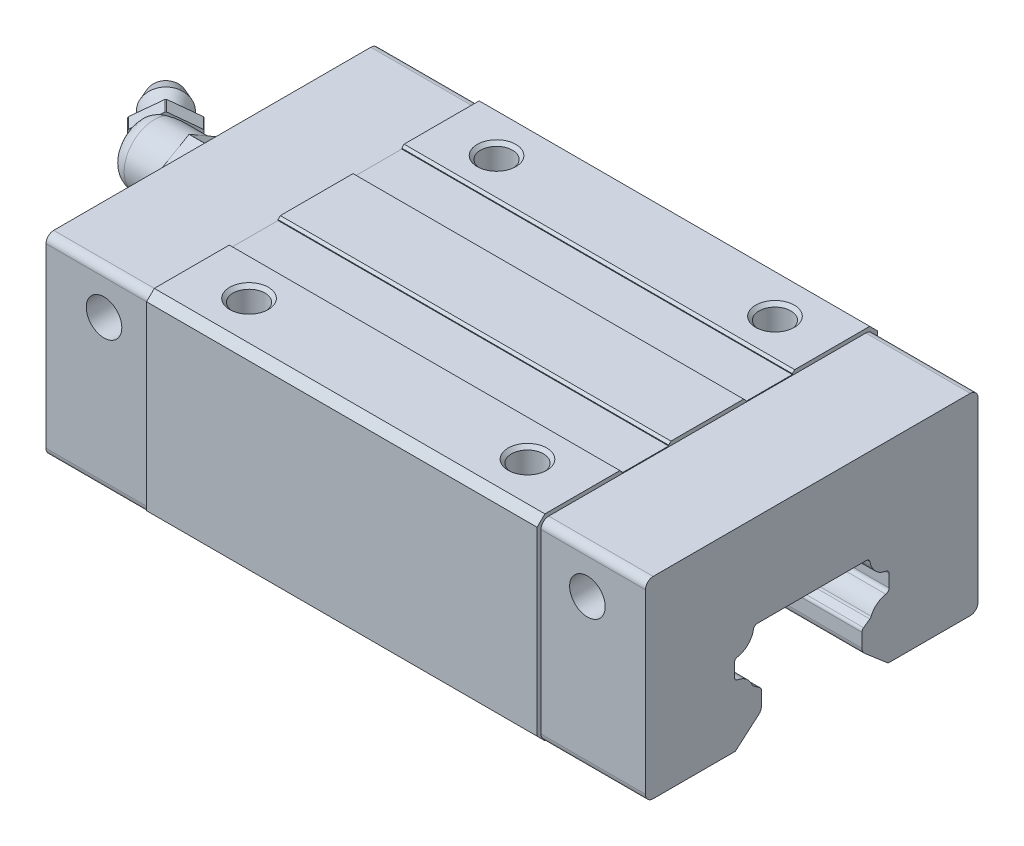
ISO-10303-21;
HEADER;
FILE_DESCRIPTION(('STEP AP214'),'2;1');
FILE_NAME('part.step','',(''),(''),'','','');
FILE_SCHEMA(('AUTOMOTIVE_DESIGN { 1 0 10303 214 1 1 1 1 }'));
ENDSEC;
DATA;
#1=APPLICATION_CONTEXT('core data for automotive mechanical design processes');
#2=APPLICATION_PROTOCOL_DEFINITION('international standard','automotive_design',2000,#1);
#3=PRODUCT_CONTEXT('',#1,'mechanical');
#4=PRODUCT('Part','Part','',(#3));
#5=PRODUCT_RELATED_PRODUCT_CATEGORY('part','',(#4));
#6=PRODUCT_DEFINITION_FORMATION('','',#4);
#7=PRODUCT_DEFINITION_CONTEXT('part definition',#1,'design');
#8=PRODUCT_DEFINITION('design','',#6,#7);
#9=PRODUCT_DEFINITION_SHAPE('','',#8);
#10=(LENGTH_UNIT() NAMED_UNIT(*) SI_UNIT(.MILLI.,.METRE.));
#11=(NAMED_UNIT(*) PLANE_ANGLE_UNIT() SI_UNIT($,.RADIAN.));
#12=(NAMED_UNIT(*) SI_UNIT($,.STERADIAN.) SOLID_ANGLE_UNIT());
#13=UNCERTAINTY_MEASURE_WITH_UNIT(LENGTH_MEASURE(1.E-05),#10,'distance_accuracy_value','');
#14=(GEOMETRIC_REPRESENTATION_CONTEXT(3) GLOBAL_UNCERTAINTY_ASSIGNED_CONTEXT((#13)) GLOBAL_UNIT_ASSIGNED_CONTEXT((#10,
#11,#12)) REPRESENTATION_CONTEXT('',''));
#15=CARTESIAN_POINT('',(0.,0.,0.));
#16=DIRECTION('',(0.,0.,1.));
#17=DIRECTION('',(1.,0.,0.));
#18=AXIS2_PLACEMENT_3D('',#15,#16,#17);
#19=CARTESIAN_POINT('',(-4.67157287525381,19.4,-4.32842712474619));
#20=DIRECTION('',(-0.707106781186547,0.,-0.707106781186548));
#21=DIRECTION('',(-0.707106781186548,0.,0.707106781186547));
#22=AXIS2_PLACEMENT_3D('',#19,#20,#21);
#23=PLANE('',#22);
#24=DIRECTION('',(0.,1.,0.));
#25=VECTOR('',#24,1.);
#26=CARTESIAN_POINT('',(-9.97487373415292,19.4,0.974873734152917));
#27=LINE('',#26,#25);
#28=CARTESIAN_POINT('',(-9.97487373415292,17.4635083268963,0.97487373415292));
#29=VERTEX_POINT('',#28);
#30=CARTESIAN_POINT('',(-9.97487373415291,21.3364916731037,0.974873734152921));
#31=VERTEX_POINT('',#30);
#32=EDGE_CURVE('E42',#29,#31,#27,.T.);
#33=ORIENTED_EDGE('',*,*,#32,.F.);
#34=CARTESIAN_POINT('',(-7.5,19.4,-1.5));
#35=DIRECTION('',(0.707106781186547,0.,0.707106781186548));
#36=DIRECTION('',(0.707106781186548,0.,-0.707106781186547));
#37=AXIS2_PLACEMENT_3D('',#34,#35,#36);
#38=CIRCLE('',#37,4.);
#39=CARTESIAN_POINT('',(-9.9232909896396,17.3371569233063,0.923290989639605));
#40=VERTEX_POINT('',#39);
#41=EDGE_CURVE('E10',#29,#40,#38,.T.);
#42=ORIENTED_EDGE('',*,*,#41,.T.);
#43=DIRECTION('',(-0.612372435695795,0.5,0.612372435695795));
#44=VECTOR('',#43,1.);
#45=CARTESIAN_POINT('',(-6.61611652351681,14.6368602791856,-2.38388347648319));
#46=LINE('',#45,#44);
#47=CARTESIAN_POINT('',(-9.40102717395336,16.9107303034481,0.40102717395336));
#48=VERTEX_POINT('',#47);
#49=EDGE_CURVE('E911',#48,#40,#46,.T.);
#50=ORIENTED_EDGE('',*,*,#49,.F.);
#51=CARTESIAN_POINT('',(-9.5,17.5669697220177,0.500000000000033));
#52=CARTESIAN_POINT('',(-9.50000017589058,17.54319417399,0.499999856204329));
#53=CARTESIAN_POINT('',(-9.49960542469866,17.5194197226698,0.499602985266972));
#54=CARTESIAN_POINT('',(-9.49800430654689,17.470758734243,0.497996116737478));
#55=CARTESIAN_POINT('',(-9.49675914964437,17.4458747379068,0.496747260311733));
#56=CARTESIAN_POINT('',(-9.49335644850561,17.3950153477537,0.49333806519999));
#57=CARTESIAN_POINT('',(-9.49115761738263,17.3690454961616,0.49113649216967));
#58=CARTESIAN_POINT('',(-9.48574211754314,17.3160482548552,0.485717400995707));
#59=CARTESIAN_POINT('',(-9.48248173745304,17.2890297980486,0.482456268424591));
#60=CARTESIAN_POINT('',(-9.47483342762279,17.2339855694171,0.474808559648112));
#61=CARTESIAN_POINT('',(-9.47039946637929,17.2059725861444,0.47037605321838));
#62=CARTESIAN_POINT('',(-9.46029113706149,17.1490075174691,0.460272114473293));
#63=CARTESIAN_POINT('',(-9.45456858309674,17.120072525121,0.454552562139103));
#64=CARTESIAN_POINT('',(-9.4417683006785,17.0613523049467,0.441758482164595));
#65=CARTESIAN_POINT('',(-9.43464045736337,17.0315889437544,0.434633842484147));
#66=CARTESIAN_POINT('',(-9.41891469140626,16.9713213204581,0.418913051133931));
#67=CARTESIAN_POINT('',(-9.41026502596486,16.940844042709,0.410265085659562));
#68=CARTESIAN_POINT('',(-9.40102717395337,16.9107303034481,0.401027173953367));
#69=B_SPLINE_CURVE_WITH_KNOTS('',3,(#51,#52,#53,#54,#55,#56,#57,#58,#59,#60,#61,#62,#63,#64,#65,
#66,#67,#68),.UNSPECIFIED.,.F.,.F.,(4,2,2,2,2,2,2,2,4),(0.,0.0713186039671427,0.146128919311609,
0.224564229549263,0.306756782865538,0.392836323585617,0.48292837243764,0.577152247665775,
0.675618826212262),.UNSPECIFIED.);
#70=CARTESIAN_POINT('',(-9.5,17.5669697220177,0.5));
#71=VERTEX_POINT('',#70);
#72=EDGE_CURVE('E1371',#71,#48,#69,.T.);
#73=ORIENTED_EDGE('',*,*,#72,.F.);
#74=DIRECTION('',(0.,1.,0.));
#75=VECTOR('',#74,1.);
#76=CARTESIAN_POINT('',(-9.5,19.4,0.5));
#77=LINE('',#76,#75);
#78=CARTESIAN_POINT('',(-9.5,21.2330302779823,0.5));
#79=VERTEX_POINT('',#78);
#80=EDGE_CURVE('E29',#71,#79,#77,.T.);
#81=ORIENTED_EDGE('',*,*,#80,.T.);
#82=CARTESIAN_POINT('',(-9.40102717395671,21.889269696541,0.401027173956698));
#83=CARTESIAN_POINT('',(-9.41026502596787,21.8591559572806,0.410265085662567));
#84=CARTESIAN_POINT('',(-9.41891469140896,21.8286786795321,0.418913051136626));
#85=CARTESIAN_POINT('',(-9.43464045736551,21.7684110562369,0.434633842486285));
#86=CARTESIAN_POINT('',(-9.44176830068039,21.7386476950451,0.441758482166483));
#87=CARTESIAN_POINT('',(-9.45456858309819,21.6799274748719,0.454552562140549));
#88=CARTESIAN_POINT('',(-9.46029113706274,21.6509924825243,0.460272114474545));
#89=CARTESIAN_POINT('',(-9.47039946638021,21.59402741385,0.470376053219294));
#90=CARTESIAN_POINT('',(-9.47483342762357,21.5660144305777,0.474808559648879));
#91=CARTESIAN_POINT('',(-9.48248173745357,21.5109702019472,0.482456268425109));
#92=CARTESIAN_POINT('',(-9.48574211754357,21.483951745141,0.485717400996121));
#93=CARTESIAN_POINT('',(-9.49115761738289,21.4309545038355,0.491136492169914));
#94=CARTESIAN_POINT('',(-9.49335644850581,21.4049846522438,0.493338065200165));
#95=CARTESIAN_POINT('',(-9.49675914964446,21.3541252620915,0.496747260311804));
#96=CARTESIAN_POINT('',(-9.49800430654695,21.3292412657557,0.497996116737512));
#97=CARTESIAN_POINT('',(-9.49960542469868,21.2805802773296,0.499602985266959));
#98=CARTESIAN_POINT('',(-9.50000017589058,21.2568058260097,0.499999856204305));
#99=CARTESIAN_POINT('',(-9.5,21.2330302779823,0.500000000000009));
#100=B_SPLINE_CURVE_WITH_KNOTS('',3,(#82,#83,#84,#85,#86,#87,#88,#89,#90,#91,#92,#93,#94,#95,
#96,#97,#98,#99),.UNSPECIFIED.,.F.,.F.,(4,2,2,2,2,2,2,2,4),(0.,0.0984665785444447,
0.19269045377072,0.282782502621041,0.368862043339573,0.451054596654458,0.529489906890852,
0.604300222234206,0.675618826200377),.UNSPECIFIED.);
#101=CARTESIAN_POINT('',(-9.40102717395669,21.889269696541,0.401027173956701));
#102=VERTEX_POINT('',#101);
#103=EDGE_CURVE('E1361',#102,#79,#100,.T.);
#104=ORIENTED_EDGE('',*,*,#103,.F.);
#105=DIRECTION('',(0.612372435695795,0.5,-0.612372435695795));
#106=VECTOR('',#105,1.);
#107=CARTESIAN_POINT('',(-6.61611652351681,24.1631397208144,-2.38388347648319));
#108=LINE('',#107,#106);
#109=CARTESIAN_POINT('',(-9.9232909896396,21.4628430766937,0.923290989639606));
#110=VERTEX_POINT('',#109);
#111=EDGE_CURVE('E1163',#110,#102,#108,.T.);
#112=ORIENTED_EDGE('',*,*,#111,.F.);
#113=CARTESIAN_POINT('',(-7.5,19.4,-1.5));
#114=DIRECTION('',(0.707106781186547,0.,0.707106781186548));
#115=DIRECTION('',(0.707106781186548,0.,-0.707106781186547));
#116=AXIS2_PLACEMENT_3D('',#113,#114,#115);
#117=CIRCLE('',#116,4.);
#118=EDGE_CURVE('E1208',#110,#31,#117,.T.);
#119=ORIENTED_EDGE('',*,*,#118,.T.);
#120=EDGE_LOOP('',(#33,#42,#50,#73,#81,#104,#112,#119));
#121=FACE_BOUND('',#120,.T.);
#122=ADVANCED_FACE('F16',(#121),#23,.F.);
#123=CARTESIAN_POINT('',(34.5728534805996,19.4,40.5728534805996));
#124=DIRECTION('',(-0.707106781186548,0.,-0.707106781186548));
#125=DIRECTION('',(0.707106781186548,0.,-0.707106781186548));
#126=AXIS2_PLACEMENT_3D('',#123,#124,#125);
#127=CYLINDRICAL_SURFACE('',#126,4.);
#128=DIRECTION('',(0.707106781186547,0.,0.707106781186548));
#129=VECTOR('',#128,1.);
#130=CARTESIAN_POINT('',(32.0979797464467,17.4635083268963,43.0477272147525));
#131=LINE('',#130,#129);
#132=CARTESIAN_POINT('',(-11.389087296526,17.4635083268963,-0.439339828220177));
#133=VERTEX_POINT('',#132);
#134=EDGE_CURVE('E1021',#133,#29,#131,.T.);
#135=ORIENTED_EDGE('',*,*,#134,.F.);
#136=CARTESIAN_POINT('',(-8.9142135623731,19.4,-2.91421356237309));
#137=DIRECTION('',(0.707106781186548,0.,0.707106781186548));
#138=DIRECTION('',(0.707106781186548,0.,-0.707106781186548));
#139=AXIS2_PLACEMENT_3D('',#136,#137,#138);
#140=CIRCLE('',#139,4.);
#141=CARTESIAN_POINT('',(-11.3375045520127,17.3371569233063,-0.490922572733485));
#142=VERTEX_POINT('',#141);
#143=EDGE_CURVE('E1211',#133,#142,#140,.T.);
#144=ORIENTED_EDGE('',*,*,#143,.T.);
#145=DIRECTION('',(-0.707106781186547,0.,-0.707106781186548));
#146=VECTOR('',#145,1.);
#147=CARTESIAN_POINT('',(32.14956249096,17.3371569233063,42.9961444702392));
#148=LINE('',#147,#146);
#149=EDGE_CURVE('E908',#40,#142,#148,.T.);
#150=ORIENTED_EDGE('',*,*,#149,.F.);
#151=ORIENTED_EDGE('',*,*,#41,.F.);
#152=EDGE_LOOP('',(#135,#144,#150,#151));
#153=FACE_BOUND('',#152,.T.);
#154=ADVANCED_FACE('F1417',(#153),#127,.T.);
#155=CARTESIAN_POINT('',(-7.00502525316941,19.4,-4.82340187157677));
#156=DIRECTION('',(0.707106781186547,0.,0.707106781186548));
#157=DIRECTION('',(0.,-1.,0.));
#158=AXIS2_PLACEMENT_3D('',#155,#156,#157);
#159=PLANE('',#158);
#160=DIRECTION('',(0.,-1.,0.));
#161=VECTOR('',#160,1.);
#162=CARTESIAN_POINT('',(-6.43933982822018,21.4207259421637,-5.38908729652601));
#163=LINE('',#162,#161);
#164=CARTESIAN_POINT('',(-6.43933982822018,21.3364916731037,-5.38908729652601));
#165=VERTEX_POINT('',#164);
#166=CARTESIAN_POINT('',(-6.43933982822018,17.4635083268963,-5.38908729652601));
#167=VERTEX_POINT('',#166);
#168=EDGE_CURVE('E2115',#165,#167,#163,.T.);
#169=ORIENTED_EDGE('',*,*,#168,.T.);
#170=CARTESIAN_POINT('',(-8.9142135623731,19.4,-2.91421356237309));
#171=DIRECTION('',(0.707106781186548,0.,0.707106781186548));
#172=DIRECTION('',(0.707106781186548,0.,-0.707106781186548));
#173=AXIS2_PLACEMENT_3D('',#170,#171,#172);
#174=CIRCLE('',#173,4.);
#175=CARTESIAN_POINT('',(-6.49092257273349,17.3371569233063,-5.3375045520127));
#176=VERTEX_POINT('',#175);
#177=EDGE_CURVE('E1232',#176,#167,#174,.T.);
#178=ORIENTED_EDGE('',*,*,#177,.F.);
#179=DIRECTION('',(-0.612372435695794,-0.5,0.612372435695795));
#180=VECTOR('',#179,1.);
#181=CARTESIAN_POINT('',(-6.43933982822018,17.3792740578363,-5.38908729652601));
#182=LINE('',#181,#180);
#183=CARTESIAN_POINT('',(-8.86263081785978,15.4006652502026,-2.9657963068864));
#184=VERTEX_POINT('',#183);
#185=EDGE_CURVE('E1872',#176,#184,#182,.T.);
#186=ORIENTED_EDGE('',*,*,#185,.T.);
#187=CARTESIAN_POINT('',(-8.9142135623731,19.4,-2.91421356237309));
#188=DIRECTION('',(0.707106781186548,0.,0.707106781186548));
#189=DIRECTION('',(0.707106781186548,0.,-0.707106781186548));
#190=AXIS2_PLACEMENT_3D('',#187,#188,#189);
#191=CIRCLE('',#190,4.);
#192=CARTESIAN_POINT('',(-8.96579630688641,15.4006652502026,-2.86263081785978));
#193=VERTEX_POINT('',#192);
#194=EDGE_CURVE('E2028',#193,#184,#191,.T.);
#195=ORIENTED_EDGE('',*,*,#194,.F.);
#196=DIRECTION('',(-0.612372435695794,0.5,0.612372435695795));
#197=VECTOR('',#196,1.);
#198=CARTESIAN_POINT('',(-8.91421356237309,15.3585481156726,-2.91421356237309));
#199=LINE('',#198,#197);
#200=EDGE_CURVE('E1861',#193,#142,#199,.T.);
#201=ORIENTED_EDGE('',*,*,#200,.T.);
#202=ORIENTED_EDGE('',*,*,#143,.F.);
#203=DIRECTION('',(0.,1.,0.));
#204=VECTOR('',#203,1.);
#205=CARTESIAN_POINT('',(-11.389087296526,17.3792740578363,-0.439339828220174));
#206=LINE('',#205,#204);
#207=CARTESIAN_POINT('',(-11.389087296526,21.3364916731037,-0.439339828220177));
#208=VERTEX_POINT('',#207);
#209=EDGE_CURVE('E1857',#133,#208,#206,.T.);
#210=ORIENTED_EDGE('',*,*,#209,.T.);
#211=CARTESIAN_POINT('',(-8.9142135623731,19.4,-2.91421356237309));
#212=DIRECTION('',(0.707106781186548,0.,0.707106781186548));
#213=DIRECTION('',(0.707106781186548,0.,-0.707106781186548));
#214=AXIS2_PLACEMENT_3D('',#211,#212,#213);
#215=CIRCLE('',#214,4.);
#216=CARTESIAN_POINT('',(-11.3375045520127,21.4628430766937,-0.490922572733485));
#217=VERTEX_POINT('',#216);
#218=EDGE_CURVE('E2163',#217,#208,#215,.T.);
#219=ORIENTED_EDGE('',*,*,#218,.F.);
#220=DIRECTION('',(0.612372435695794,0.5,-0.612372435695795));
#221=VECTOR('',#220,1.);
#222=CARTESIAN_POINT('',(-11.389087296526,21.4207259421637,-0.439339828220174));
#223=LINE('',#222,#221);
#224=CARTESIAN_POINT('',(-8.96579630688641,23.3993347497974,-2.86263081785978));
#225=VERTEX_POINT('',#224);
#226=EDGE_CURVE('E1862',#217,#225,#223,.T.);
#227=ORIENTED_EDGE('',*,*,#226,.T.);
#228=CARTESIAN_POINT('',(-8.9142135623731,19.4,-2.91421356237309));
#229=DIRECTION('',(0.707106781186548,0.,0.707106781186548));
#230=DIRECTION('',(0.707106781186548,0.,-0.707106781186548));
#231=AXIS2_PLACEMENT_3D('',#228,#229,#230);
#232=CIRCLE('',#231,4.);
#233=CARTESIAN_POINT('',(-8.86263081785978,23.3993347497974,-2.9657963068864));
#234=VERTEX_POINT('',#233);
#235=EDGE_CURVE('E1233',#234,#225,#232,.T.);
#236=ORIENTED_EDGE('',*,*,#235,.F.);
#237=DIRECTION('',(0.612372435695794,-0.5,-0.612372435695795));
#238=VECTOR('',#237,1.);
#239=CARTESIAN_POINT('',(-8.91421356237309,23.4414518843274,-2.91421356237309));
#240=LINE('',#239,#238);
#241=CARTESIAN_POINT('',(-6.4909225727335,21.4628430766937,-5.3375045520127));
#242=VERTEX_POINT('',#241);
#243=EDGE_CURVE('E1961',#234,#242,#240,.T.);
#244=ORIENTED_EDGE('',*,*,#243,.T.);
#245=CARTESIAN_POINT('',(-8.9142135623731,19.4,-2.91421356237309));
#246=DIRECTION('',(0.707106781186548,0.,0.707106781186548));
#247=DIRECTION('',(0.707106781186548,0.,-0.707106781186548));
#248=AXIS2_PLACEMENT_3D('',#245,#246,#247);
#249=CIRCLE('',#248,4.);
#250=EDGE_CURVE('E1228',#165,#242,#249,.T.);
#251=ORIENTED_EDGE('',*,*,#250,.F.);
#252=EDGE_LOOP('',(#169,#178,#186,#195,#201,#202,#210,#219,#227,#236,#244,#251));
#253=FACE_BOUND('',#252,.T.);
#254=CARTESIAN_POINT('',(-8.9142135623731,19.4,-2.91421356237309));
#255=DIRECTION('',(0.707106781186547,0.,0.707106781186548));
#256=DIRECTION('',(0.707106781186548,0.,-0.707106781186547));
#257=AXIS2_PLACEMENT_3D('',#254,#255,#256);
#258=CIRCLE('',#257,2.7);
#259=CARTESIAN_POINT('',(-7.00502525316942,19.4,-4.82340187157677));
#260=VERTEX_POINT('',#259);
#261=EDGE_CURVE('E816',#260,#260,#258,.T.);
#262=ORIENTED_EDGE('',*,*,#261,.T.);
#263=EDGE_LOOP('',(#262));
#264=FACE_BOUND('',#263,.T.);
#265=ADVANCED_FACE('F1498',(#253,#264),#159,.F.);
#266=CARTESIAN_POINT('',(-9.83345237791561,19.4,-3.83345237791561));
#267=DIRECTION('',(0.707106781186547,0.,0.707106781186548));
#268=DIRECTION('',(0.707106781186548,0.,-0.707106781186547));
#269=AXIS2_PLACEMENT_3D('',#266,#267,#268);
#270=CONICAL_SURFACE('',#269,2.,0.4939413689);
#271=ORIENTED_EDGE('',*,*,#261,.F.);
#272=EDGE_LOOP('',(#271));
#273=FACE_BOUND('',#272,.T.);
#274=CARTESIAN_POINT('',(-9.83345237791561,19.4,-3.83345237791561));
#275=DIRECTION('',(0.707106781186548,0.,0.707106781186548));
#276=DIRECTION('',(0.707106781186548,0.,-0.707106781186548));
#277=AXIS2_PLACEMENT_3D('',#274,#275,#276);
#278=CIRCLE('',#277,2.);
#279=CARTESIAN_POINT('',(-8.41923881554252,19.4,-5.24766594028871));
#280=VERTEX_POINT('',#279);
#281=EDGE_CURVE('E825',#280,#280,#278,.T.);
#282=ORIENTED_EDGE('',*,*,#281,.T.);
#283=EDGE_LOOP('',(#282));
#284=FACE_BOUND('',#283,.T.);
#285=ADVANCED_FACE('F1494',(#273,#284),#270,.T.);
#286=CARTESIAN_POINT('',(-11.601219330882,19.4,-5.60121933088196));
#287=DIRECTION('',(-0.707106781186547,0.,-0.707106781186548));
#288=DIRECTION('',(-0.707106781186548,0.,0.707106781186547));
#289=AXIS2_PLACEMENT_3D('',#286,#287,#288);
#290=CONICAL_SURFACE('',#289,2.7,0.2730087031);
#291=CARTESIAN_POINT('',(-11.601219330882,19.4,-5.60121933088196));
#292=DIRECTION('',(0.707106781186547,0.,0.707106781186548));
#293=DIRECTION('',(0.707106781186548,0.,-0.707106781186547));
#294=AXIS2_PLACEMENT_3D('',#291,#292,#293);
#295=CIRCLE('',#294,2.7);
#296=CARTESIAN_POINT('',(-9.69203102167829,19.4,-7.51040764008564));
#297=VERTEX_POINT('',#296);
#298=EDGE_CURVE('E1138',#297,#297,#295,.T.);
#299=ORIENTED_EDGE('',*,*,#298,.T.);
#300=EDGE_LOOP('',(#299));
#301=FACE_BOUND('',#300,.T.);
#302=ORIENTED_EDGE('',*,*,#281,.F.);
#303=EDGE_LOOP('',(#302));
#304=FACE_BOUND('',#303,.T.);
#305=ADVANCED_FACE('F1490',(#301,#304),#290,.T.);
#306=CARTESIAN_POINT('',(-13.0154328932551,19.4,-7.01543289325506));
#307=DIRECTION('',(0.707106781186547,0.,0.707106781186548));
#308=DIRECTION('',(0.707106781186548,0.,-0.707106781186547));
#309=AXIS2_PLACEMENT_3D('',#306,#307,#308);
#310=CONICAL_SURFACE('',#309,2.,0.3366748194);
#311=ORIENTED_EDGE('',*,*,#298,.F.);
#312=EDGE_LOOP('',(#311));
#313=FACE_BOUND('',#312,.T.);
#314=CARTESIAN_POINT('',(-13.0154328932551,19.4,-7.01543289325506));
#315=DIRECTION('',(0.707106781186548,0.,0.707106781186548));
#316=DIRECTION('',(0.707106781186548,0.,-0.707106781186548));
#317=AXIS2_PLACEMENT_3D('',#314,#315,#316);
#318=CIRCLE('',#317,2.);
#319=CARTESIAN_POINT('',(-11.601219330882,19.4,-8.42964645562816));
#320=VERTEX_POINT('',#319);
#321=EDGE_CURVE('E1142',#320,#320,#318,.T.);
#322=ORIENTED_EDGE('',*,*,#321,.T.);
#323=EDGE_LOOP('',(#322));
#324=FACE_BOUND('',#323,.T.);
#325=ADVANCED_FACE('F1493',(#313,#324),#310,.T.);
#326=CARTESIAN_POINT('',(-13.0154328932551,19.4,-7.01543289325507));
#327=DIRECTION('',(0.707106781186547,0.,0.707106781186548));
#328=DIRECTION('',(0.,-1.,0.));
#329=AXIS2_PLACEMENT_3D('',#326,#327,#328);
#330=PLANE('',#329);
#331=ORIENTED_EDGE('',*,*,#321,.F.);
#332=EDGE_LOOP('',(#331));
#333=FACE_BOUND('',#332,.T.);
#334=ADVANCED_FACE('F1568',(#333),#330,.F.);
#335=CARTESIAN_POINT('',(-10.,21.6516660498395,3.9));
#336=DIRECTION('',(0.,0.,1.));
#337=DIRECTION('',(1.,0.,0.));
#338=AXIS2_PLACEMENT_3D('',#335,#336,#337);
#339=PLANE('',#338);
#340=DIRECTION('',(0.,-1.,0.));
#341=VECTOR('',#340,1.);
#342=CARTESIAN_POINT('',(-3.,19.4,3.9));
#343=LINE('',#342,#341);
#344=CARTESIAN_POINT('',(-3.,19.4,3.9));
#345=VERTEX_POINT('',#344);
#346=CARTESIAN_POINT('',(-3.,17.1550055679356,3.9));
#347=VERTEX_POINT('',#346);
#348=EDGE_CURVE('E1686',#345,#347,#343,.T.);
#349=ORIENTED_EDGE('',*,*,#348,.T.);
#350=DIRECTION('',(1.,0.,0.));
#351=VECTOR('',#350,1.);
#352=CARTESIAN_POINT('',(0.,17.1550055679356,3.9));
#353=LINE('',#352,#351);
#354=CARTESIAN_POINT('',(0.,17.1550055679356,3.9));
#355=VERTEX_POINT('',#354);
#356=EDGE_CURVE('E1682',#347,#355,#353,.T.);
#357=ORIENTED_EDGE('',*,*,#356,.T.);
#358=DIRECTION('',(0.,-1.,0.));
#359=VECTOR('',#358,1.);
#360=CARTESIAN_POINT('',(0.,21.6516660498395,3.9));
#361=LINE('',#360,#359);
#362=CARTESIAN_POINT('',(0.,21.6449944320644,3.9));
#363=VERTEX_POINT('',#362);
#364=EDGE_CURVE('E937',#363,#355,#361,.T.);
#365=ORIENTED_EDGE('',*,*,#364,.F.);
#366=DIRECTION('',(-1.,0.,0.));
#367=VECTOR('',#366,1.);
#368=CARTESIAN_POINT('',(0.,21.6449944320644,3.9));
#369=LINE('',#368,#367);
#370=CARTESIAN_POINT('',(-3.,21.6449944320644,3.9));
#371=VERTEX_POINT('',#370);
#372=EDGE_CURVE('E1687',#363,#371,#369,.T.);
#373=ORIENTED_EDGE('',*,*,#372,.T.);
#374=DIRECTION('',(0.,-1.,0.));
#375=VECTOR('',#374,1.);
#376=CARTESIAN_POINT('',(-3.,19.4,3.9));
#377=LINE('',#376,#375);
#378=EDGE_CURVE('E2004',#371,#345,#377,.T.);
#379=ORIENTED_EDGE('',*,*,#378,.T.);
#380=EDGE_LOOP('',(#349,#357,#365,#373,#379));
#381=FACE_BOUND('',#380,.T.);
#382=ADVANCED_FACE('F1559',(#381),#339,.T.);
#383=CARTESIAN_POINT('',(-10.,23.9033320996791,0.));
#384=DIRECTION('',(0.,0.866025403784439,0.5));
#385=DIRECTION('',(1.,0.,0.));
#386=AXIS2_PLACEMENT_3D('',#383,#384,#385);
#387=PLANE('',#386);
#388=DIRECTION('',(0.,-0.5,0.866025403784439));
#389=VECTOR('',#388,1.);
#390=CARTESIAN_POINT('',(-3.,24.466248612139,-0.975));
#391=LINE('',#390,#389);
#392=CARTESIAN_POINT('',(-3.,22.7774990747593,1.95));
#393=VERTEX_POINT('',#392);
#394=CARTESIAN_POINT('',(-3.,21.6550018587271,3.89422220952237));
#395=VERTEX_POINT('',#394);
#396=EDGE_CURVE('E1118',#393,#395,#391,.T.);
#397=ORIENTED_EDGE('',*,*,#396,.T.);
#398=DIRECTION('',(1.,0.,0.));
#399=VECTOR('',#398,1.);
#400=CARTESIAN_POINT('',(0.,21.6550018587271,3.89422220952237));
#401=LINE('',#400,#399);
#402=CARTESIAN_POINT('',(0.,21.6550018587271,3.89422220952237));
#403=VERTEX_POINT('',#402);
#404=EDGE_CURVE('E1114',#395,#403,#401,.T.);
#405=ORIENTED_EDGE('',*,*,#404,.T.);
#406=DIRECTION('',(0.,-0.5,0.866025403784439));
#407=VECTOR('',#406,1.);
#408=CARTESIAN_POINT('',(0.,23.9033320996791,0.));
#409=LINE('',#408,#407);
#410=CARTESIAN_POINT('',(0.,23.8999962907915,0.00577779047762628));
#411=VERTEX_POINT('',#410);
#412=EDGE_CURVE('E1925',#411,#403,#409,.T.);
#413=ORIENTED_EDGE('',*,*,#412,.F.);
#414=DIRECTION('',(-1.,0.,0.));
#415=VECTOR('',#414,1.);
#416=CARTESIAN_POINT('',(0.,23.8999962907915,0.00577779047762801));
#417=LINE('',#416,#415);
#418=CARTESIAN_POINT('',(-3.,23.8999962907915,0.00577779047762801));
#419=VERTEX_POINT('',#418);
#420=EDGE_CURVE('E917',#411,#419,#417,.T.);
#421=ORIENTED_EDGE('',*,*,#420,.T.);
#422=DIRECTION('',(0.,-0.5,0.866025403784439));
#423=VECTOR('',#422,1.);
#424=CARTESIAN_POINT('',(-3.,24.466248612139,-0.975));
#425=LINE('',#424,#423);
#426=EDGE_CURVE('E913',#419,#393,#425,.T.);
#427=ORIENTED_EDGE('',*,*,#426,.T.);
#428=EDGE_LOOP('',(#397,#405,#413,#421,#427));
#429=FACE_BOUND('',#428,.T.);
#430=ADVANCED_FACE('F1556',(#429),#387,.T.);
#431=CARTESIAN_POINT('',(-10.,21.6516660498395,-3.9));
#432=DIRECTION('',(0.,0.866025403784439,-0.5));
#433=DIRECTION('',(-1.,0.,0.));
#434=AXIS2_PLACEMENT_3D('',#431,#432,#433);
#435=PLANE('',#434);
#436=DIRECTION('',(0.,0.5,0.866025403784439));
#437=VECTOR('',#436,1.);
#438=CARTESIAN_POINT('',(-3.,21.0887495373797,-4.875));
#439=LINE('',#438,#437);
#440=CARTESIAN_POINT('',(-3.,22.7774990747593,-1.95));
#441=VERTEX_POINT('',#440);
#442=CARTESIAN_POINT('',(-3.,23.8999962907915,-0.00577779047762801));
#443=VERTEX_POINT('',#442);
#444=EDGE_CURVE('E918',#441,#443,#439,.T.);
#445=ORIENTED_EDGE('',*,*,#444,.T.);
#446=DIRECTION('',(1.,0.,0.));
#447=VECTOR('',#446,1.);
#448=CARTESIAN_POINT('',(0.,23.8999962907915,-0.00577779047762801));
#449=LINE('',#448,#447);
#450=CARTESIAN_POINT('',(0.,23.8999962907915,-0.00577779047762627));
#451=VERTEX_POINT('',#450);
#452=EDGE_CURVE('E1844',#443,#451,#449,.T.);
#453=ORIENTED_EDGE('',*,*,#452,.T.);
#454=DIRECTION('',(0.,0.5,0.866025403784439));
#455=VECTOR('',#454,1.);
#456=CARTESIAN_POINT('',(0.,21.6516660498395,-3.9));
#457=LINE('',#456,#455);
#458=CARTESIAN_POINT('',(0.,21.6550018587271,-3.89422220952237));
#459=VERTEX_POINT('',#458);
#460=EDGE_CURVE('E1928',#459,#451,#457,.T.);
#461=ORIENTED_EDGE('',*,*,#460,.F.);
#462=DIRECTION('',(-1.,0.,0.));
#463=VECTOR('',#462,1.);
#464=CARTESIAN_POINT('',(0.,21.6550018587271,-3.89422220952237));
#465=LINE('',#464,#463);
#466=CARTESIAN_POINT('',(-3.,21.6550018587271,-3.89422220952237));
#467=VERTEX_POINT('',#466);
#468=EDGE_CURVE('E1841',#459,#467,#465,.T.);
#469=ORIENTED_EDGE('',*,*,#468,.T.);
#470=DIRECTION('',(0.,0.5,0.866025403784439));
#471=VECTOR('',#470,1.);
#472=CARTESIAN_POINT('',(-3.,21.0887495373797,-4.875));
#473=LINE('',#472,#471);
#474=EDGE_CURVE('E1845',#467,#441,#473,.T.);
#475=ORIENTED_EDGE('',*,*,#474,.T.);
#476=EDGE_LOOP('',(#445,#453,#461,#469,#475));
#477=FACE_BOUND('',#476,.T.);
#478=ADVANCED_FACE('F1462',(#477),#435,.T.);
#479=CARTESIAN_POINT('',(-10.,17.1483339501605,-3.9));
#480=DIRECTION('',(0.,0.,-1.));
#481=DIRECTION('',(0.,-1.,0.));
#482=AXIS2_PLACEMENT_3D('',#479,#480,#481);
#483=PLANE('',#482);
#484=DIRECTION('',(0.,1.,0.));
#485=VECTOR('',#484,1.);
#486=CARTESIAN_POINT('',(-3.,19.4,-3.9));
#487=LINE('',#486,#485);
#488=CARTESIAN_POINT('',(-3.,19.4,-3.9));
#489=VERTEX_POINT('',#488);
#490=CARTESIAN_POINT('',(-3.,21.6449944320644,-3.9));
#491=VERTEX_POINT('',#490);
#492=EDGE_CURVE('E1990',#489,#491,#487,.T.);
#493=ORIENTED_EDGE('',*,*,#492,.T.);
#494=DIRECTION('',(1.,0.,0.));
#495=VECTOR('',#494,1.);
#496=CARTESIAN_POINT('',(0.,21.6449944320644,-3.9));
#497=LINE('',#496,#495);
#498=CARTESIAN_POINT('',(0.,21.6449944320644,-3.9));
#499=VERTEX_POINT('',#498);
#500=EDGE_CURVE('E1808',#491,#499,#497,.T.);
#501=ORIENTED_EDGE('',*,*,#500,.T.);
#502=DIRECTION('',(0.,1.,0.));
#503=VECTOR('',#502,1.);
#504=CARTESIAN_POINT('',(0.,17.1483339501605,-3.9));
#505=LINE('',#504,#503);
#506=CARTESIAN_POINT('',(0.,17.1550055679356,-3.9));
#507=VERTEX_POINT('',#506);
#508=EDGE_CURVE('E1779',#507,#499,#505,.T.);
#509=ORIENTED_EDGE('',*,*,#508,.F.);
#510=DIRECTION('',(-1.,0.,0.));
#511=VECTOR('',#510,1.);
#512=CARTESIAN_POINT('',(0.,17.1550055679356,-3.9));
#513=LINE('',#512,#511);
#514=CARTESIAN_POINT('',(-3.,17.1550055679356,-3.9));
#515=VERTEX_POINT('',#514);
#516=EDGE_CURVE('E1804',#507,#515,#513,.T.);
#517=ORIENTED_EDGE('',*,*,#516,.T.);
#518=DIRECTION('',(0.,1.,0.));
#519=VECTOR('',#518,1.);
#520=CARTESIAN_POINT('',(-3.,19.4,-3.9));
#521=LINE('',#520,#519);
#522=EDGE_CURVE('E1721',#515,#489,#521,.T.);
#523=ORIENTED_EDGE('',*,*,#522,.T.);
#524=EDGE_LOOP('',(#493,#501,#509,#517,#523));
#525=FACE_BOUND('',#524,.T.);
#526=ADVANCED_FACE('F1458',(#525),#483,.T.);
#527=CARTESIAN_POINT('',(-10.,14.8966679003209,0.));
#528=DIRECTION('',(0.,-0.866025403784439,-0.5));
#529=DIRECTION('',(0.,0.5,-0.866025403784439));
#530=AXIS2_PLACEMENT_3D('',#527,#528,#529);
#531=PLANE('',#530);
#532=DIRECTION('',(0.,0.5,-0.866025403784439));
#533=VECTOR('',#532,1.);
#534=CARTESIAN_POINT('',(-3.,17.7112504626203,-4.875));
#535=LINE('',#534,#533);
#536=CARTESIAN_POINT('',(-3.,16.0225009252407,-1.95));
#537=VERTEX_POINT('',#536);
#538=CARTESIAN_POINT('',(-3.,17.1449981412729,-3.89422220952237));
#539=VERTEX_POINT('',#538);
#540=EDGE_CURVE('E1717',#537,#539,#535,.T.);
#541=ORIENTED_EDGE('',*,*,#540,.T.);
#542=DIRECTION('',(1.,0.,0.));
#543=VECTOR('',#542,1.);
#544=CARTESIAN_POINT('',(0.,17.1449981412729,-3.89422220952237));
#545=LINE('',#544,#543);
#546=CARTESIAN_POINT('',(0.,17.1449981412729,-3.89422220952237));
#547=VERTEX_POINT('',#546);
#548=EDGE_CURVE('E1722',#539,#547,#545,.T.);
#549=ORIENTED_EDGE('',*,*,#548,.T.);
#550=DIRECTION('',(0.,0.5,-0.866025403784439));
#551=VECTOR('',#550,1.);
#552=CARTESIAN_POINT('',(0.,14.8966679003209,0.));
#553=LINE('',#552,#551);
#554=CARTESIAN_POINT('',(0.,14.9000037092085,-0.00577779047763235));
#555=VERTEX_POINT('',#554);
#556=EDGE_CURVE('E938',#555,#547,#553,.T.);
#557=ORIENTED_EDGE('',*,*,#556,.F.);
#558=DIRECTION('',(-1.,0.,0.));
#559=VECTOR('',#558,1.);
#560=CARTESIAN_POINT('',(0.,14.9000037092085,-0.00577779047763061));
#561=LINE('',#560,#559);
#562=CARTESIAN_POINT('',(-3.,14.9000037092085,-0.00577779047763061));
#563=VERTEX_POINT('',#562);
#564=EDGE_CURVE('E1649',#555,#563,#561,.T.);
#565=ORIENTED_EDGE('',*,*,#564,.T.);
#566=DIRECTION('',(0.,0.5,-0.866025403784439));
#567=VECTOR('',#566,1.);
#568=CARTESIAN_POINT('',(-3.,17.7112504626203,-4.875));
#569=LINE('',#568,#567);
#570=EDGE_CURVE('E2032',#563,#537,#569,.T.);
#571=ORIENTED_EDGE('',*,*,#570,.T.);
#572=EDGE_LOOP('',(#541,#549,#557,#565,#571));
#573=FACE_BOUND('',#572,.T.);
#574=ADVANCED_FACE('F1461',(#573),#531,.T.);
#575=CARTESIAN_POINT('',(-10.,17.1483339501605,3.9));
#576=DIRECTION('',(0.,-0.866025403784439,0.5));
#577=DIRECTION('',(-1.,0.,0.));
#578=AXIS2_PLACEMENT_3D('',#575,#576,#577);
#579=PLANE('',#578);
#580=DIRECTION('',(0.,-0.5,-0.866025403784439));
#581=VECTOR('',#580,1.);
#582=CARTESIAN_POINT('',(-3.,14.333751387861,-0.975));
#583=LINE('',#582,#581);
#584=CARTESIAN_POINT('',(-3.,16.0225009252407,1.95));
#585=VERTEX_POINT('',#584);
#586=CARTESIAN_POINT('',(-3.,14.9000037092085,0.00577779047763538));
#587=VERTEX_POINT('',#586);
#588=EDGE_CURVE('E1660',#585,#587,#583,.T.);
#589=ORIENTED_EDGE('',*,*,#588,.T.);
#590=DIRECTION('',(1.,0.,0.));
#591=VECTOR('',#590,1.);
#592=CARTESIAN_POINT('',(0.,14.9000037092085,0.00577779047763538));
#593=LINE('',#592,#591);
#594=CARTESIAN_POINT('',(0.,14.9000037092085,0.00577779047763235));
#595=VERTEX_POINT('',#594);
#596=EDGE_CURVE('E1656',#587,#595,#593,.T.);
#597=ORIENTED_EDGE('',*,*,#596,.T.);
#598=DIRECTION('',(0.,-0.5,-0.866025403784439));
#599=VECTOR('',#598,1.);
#600=CARTESIAN_POINT('',(0.,17.1483339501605,3.9));
#601=LINE('',#600,#599);
#602=CARTESIAN_POINT('',(0.,17.1449981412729,3.89422220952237));
#603=VERTEX_POINT('',#602);
#604=EDGE_CURVE('E934',#603,#595,#601,.T.);
#605=ORIENTED_EDGE('',*,*,#604,.F.);
#606=DIRECTION('',(-1.,0.,0.));
#607=VECTOR('',#606,1.);
#608=CARTESIAN_POINT('',(0.,17.1449981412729,3.89422220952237));
#609=LINE('',#608,#607);
#610=CARTESIAN_POINT('',(-3.,17.1449981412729,3.89422220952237));
#611=VERTEX_POINT('',#610);
#612=EDGE_CURVE('E1661',#603,#611,#609,.T.);
#613=ORIENTED_EDGE('',*,*,#612,.T.);
#614=DIRECTION('',(0.,-0.5,-0.866025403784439));
#615=VECTOR('',#614,1.);
#616=CARTESIAN_POINT('',(-3.,14.333751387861,-0.975));
#617=LINE('',#616,#615);
#618=EDGE_CURVE('E1889',#611,#585,#617,.T.);
#619=ORIENTED_EDGE('',*,*,#618,.T.);
#620=EDGE_LOOP('',(#589,#597,#605,#613,#619));
#621=FACE_BOUND('',#620,.T.);
#622=ADVANCED_FACE('F1600',(#621),#579,.T.);
#623=CARTESIAN_POINT('',(0.,19.4,0.));
#624=DIRECTION('',(-1.,0.,0.));
#625=DIRECTION('',(0.,0.,-1.));
#626=AXIS2_PLACEMENT_3D('',#623,#624,#625);
#627=CYLINDRICAL_SURFACE('',#626,4.5);
#628=ORIENTED_EDGE('',*,*,#356,.F.);
#629=CARTESIAN_POINT('',(-3.,19.4,0.));
#630=DIRECTION('',(1.,0.,0.));
#631=DIRECTION('',(0.,0.,-1.));
#632=AXIS2_PLACEMENT_3D('',#629,#630,#631);
#633=CIRCLE('',#632,4.5);
#634=EDGE_CURVE('E906',#347,#611,#633,.T.);
#635=ORIENTED_EDGE('',*,*,#634,.T.);
#636=ORIENTED_EDGE('',*,*,#612,.F.);
#637=CARTESIAN_POINT('',(0.,19.4,0.));
#638=DIRECTION('',(-1.,0.,0.));
#639=DIRECTION('',(0.,0.,-1.));
#640=AXIS2_PLACEMENT_3D('',#637,#638,#639);
#641=CIRCLE('',#640,4.5);
#642=EDGE_CURVE('E922',#603,#355,#641,.T.);
#643=ORIENTED_EDGE('',*,*,#642,.T.);
#644=EDGE_LOOP('',(#628,#635,#636,#643));
#645=FACE_BOUND('',#644,.T.);
#646=ADVANCED_FACE('F1602',(#645),#627,.T.);
#647=CARTESIAN_POINT('',(-3.,19.4,-3.9));
#648=DIRECTION('',(1.,0.,0.));
#649=DIRECTION('',(0.,1.,0.));
#650=AXIS2_PLACEMENT_3D('',#647,#648,#649);
#651=PLANE('',#650);
#652=ORIENTED_EDGE('',*,*,#378,.F.);
#653=CARTESIAN_POINT('',(-3.,19.4,0.));
#654=DIRECTION('',(1.,0.,0.));
#655=DIRECTION('',(0.,0.,-1.));
#656=AXIS2_PLACEMENT_3D('',#653,#654,#655);
#657=CIRCLE('',#656,4.5);
#658=EDGE_CURVE('E2102',#395,#371,#657,.T.);
#659=ORIENTED_EDGE('',*,*,#658,.F.);
#660=ORIENTED_EDGE('',*,*,#396,.F.);
#661=CARTESIAN_POINT('',(-3.,19.4,0.));
#662=DIRECTION('',(1.,0.,0.));
#663=DIRECTION('',(0.,0.,-1.));
#664=AXIS2_PLACEMENT_3D('',#661,#662,#663);
#665=CIRCLE('',#664,3.9);
#666=EDGE_CURVE('E919',#393,#345,#665,.T.);
#667=ORIENTED_EDGE('',*,*,#666,.T.);
#668=EDGE_LOOP('',(#652,#659,#660,#667));
#669=FACE_BOUND('',#668,.T.);
#670=ADVANCED_FACE('F2671',(#669),#651,.F.);
#671=CARTESIAN_POINT('',(0.,19.4,0.));
#672=DIRECTION('',(-1.,0.,0.));
#673=DIRECTION('',(0.,0.,-1.));
#674=AXIS2_PLACEMENT_3D('',#671,#672,#673);
#675=CYLINDRICAL_SURFACE('',#674,3.9);
#676=CARTESIAN_POINT('',(-7.5,19.4,0.));
#677=DIRECTION('',(1.,0.,0.));
#678=DIRECTION('',(0.,0.,-1.));
#679=AXIS2_PLACEMENT_3D('',#676,#677,#678);
#680=CIRCLE('',#679,3.9);
#681=CARTESIAN_POINT('',(-7.5,23.,-1.5));
#682=VERTEX_POINT('',#681);
#683=CARTESIAN_POINT('',(-7.5,15.8,-1.5));
#684=VERTEX_POINT('',#683);
#685=EDGE_CURVE('E923',#682,#684,#680,.T.);
#686=ORIENTED_EDGE('',*,*,#685,.T.);
#687=CARTESIAN_POINT('',(-9.,19.4,0.));
#688=DIRECTION('',(-0.707106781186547,0.,-0.707106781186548));
#689=DIRECTION('',(0.707106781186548,0.,-0.707106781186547));
#690=AXIS2_PLACEMENT_3D('',#687,#688,#689);
#691=ELLIPSE('',#690,5.5154328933,3.9);
#692=EDGE_CURVE('E1096',#682,#684,#691,.T.);
#693=ORIENTED_EDGE('',*,*,#692,.F.);
#694=EDGE_LOOP('',(#686,#693));
#695=FACE_BOUND('',#694,.T.);
#696=CARTESIAN_POINT('',(-3.,19.4,0.));
#697=DIRECTION('',(1.,0.,0.));
#698=DIRECTION('',(0.,0.,-1.));
#699=AXIS2_PLACEMENT_3D('',#696,#697,#698);
#700=CIRCLE('',#699,3.9);
#701=EDGE_CURVE('E1774',#345,#585,#700,.T.);
#702=ORIENTED_EDGE('',*,*,#701,.F.);
#703=ORIENTED_EDGE('',*,*,#666,.F.);
#704=CARTESIAN_POINT('',(-3.,19.4,0.));
#705=DIRECTION('',(1.,0.,0.));
#706=DIRECTION('',(0.,0.,-1.));
#707=AXIS2_PLACEMENT_3D('',#704,#705,#706);
#708=CIRCLE('',#707,3.9);
#709=EDGE_CURVE('E950',#441,#393,#708,.T.);
#710=ORIENTED_EDGE('',*,*,#709,.F.);
#711=CARTESIAN_POINT('',(-3.,19.4,0.));
#712=DIRECTION('',(1.,0.,0.));
#713=DIRECTION('',(0.,0.,-1.));
#714=AXIS2_PLACEMENT_3D('',#711,#712,#713);
#715=CIRCLE('',#714,3.9);
#716=EDGE_CURVE('E949',#489,#441,#715,.T.);
#717=ORIENTED_EDGE('',*,*,#716,.F.);
#718=CARTESIAN_POINT('',(-3.,19.4,0.));
#719=DIRECTION('',(1.,0.,0.));
#720=DIRECTION('',(0.,0.,-1.));
#721=AXIS2_PLACEMENT_3D('',#718,#719,#720);
#722=CIRCLE('',#721,3.9);
#723=EDGE_CURVE('E945',#537,#489,#722,.T.);
#724=ORIENTED_EDGE('',*,*,#723,.F.);
#725=CARTESIAN_POINT('',(-3.,19.4,0.));
#726=DIRECTION('',(1.,0.,0.));
#727=DIRECTION('',(0.,0.,-1.));
#728=AXIS2_PLACEMENT_3D('',#725,#726,#727);
#729=CIRCLE('',#728,3.9);
#730=EDGE_CURVE('E1188',#585,#537,#729,.T.);
#731=ORIENTED_EDGE('',*,*,#730,.F.);
#732=EDGE_LOOP('',(#702,#703,#710,#717,#724,#731));
#733=FACE_BOUND('',#732,.T.);
#734=ADVANCED_FACE('F1274',(#695,#733),#675,.T.);
#735=CARTESIAN_POINT('',(-7.5,22.9636213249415,-1.58448826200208));
#736=CARTESIAN_POINT('',(-7.50000000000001,24.2352380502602,1.27546380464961));
#737=CARTESIAN_POINT('',(-7.50000000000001,22.5299097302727,3.89999999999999));
#738=CARTESIAN_POINT('',(-7.5,19.4,3.9));
#739=CARTESIAN_POINT('',(-7.50000000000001,16.2700902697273,3.9));
#740=CARTESIAN_POINT('',(-7.50000000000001,14.5647619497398,1.27546380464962));
#741=CARTESIAN_POINT('',(-7.5,15.8363786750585,-1.58448826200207));
#742=CARTESIAN_POINT('',(-8.67157287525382,22.9636213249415,-1.58448826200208));
#743=CARTESIAN_POINT('',(-8.67157287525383,24.2352380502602,1.27546380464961));
#744=CARTESIAN_POINT('',(-8.67157287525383,22.5299097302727,3.89999999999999));
#745=CARTESIAN_POINT('',(-8.67157287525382,19.4,3.9));
#746=CARTESIAN_POINT('',(-8.67157287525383,16.2700902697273,3.9));
#747=CARTESIAN_POINT('',(-8.67157287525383,14.5647619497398,1.27546380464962));
#748=CARTESIAN_POINT('',(-8.67157287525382,15.8363786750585,-1.58448826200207));
#749=CARTESIAN_POINT('',(-9.50000000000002,22.2066468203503,-1.2479156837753));
#750=CARTESIAN_POINT('',(-9.50000000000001,23.208150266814,1.00453333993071));
#751=CARTESIAN_POINT('',(-9.50000000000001,21.8650630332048,3.0715728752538));
#752=CARTESIAN_POINT('',(-9.50000000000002,19.4,3.07157287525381));
#753=CARTESIAN_POINT('',(-9.50000000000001,16.9349369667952,3.07157287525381));
#754=CARTESIAN_POINT('',(-9.50000000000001,15.591849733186,1.00453333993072));
#755=CARTESIAN_POINT('',(-9.50000000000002,16.5933531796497,-1.24791568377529));
#756=CARTESIAN_POINT('',(-9.5,21.1361232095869,-0.771930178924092));
#757=CARTESIAN_POINT('',(-9.5,21.7556287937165,0.621379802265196));
#758=CARTESIAN_POINT('',(-9.5,20.9248278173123,1.89999999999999));
#759=CARTESIAN_POINT('',(-9.5,19.4,1.9));
#760=CARTESIAN_POINT('',(-9.5,17.8751721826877,1.9));
#761=CARTESIAN_POINT('',(-9.5,17.0443712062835,0.6213798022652));
#762=CARTESIAN_POINT('',(-9.5,17.6638767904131,-0.771930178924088));
#763=(BOUNDED_SURFACE() B_SPLINE_SURFACE(3,3,((#735,#736,#737,#738,#739,#740,#741),(#742,#743,
#744,#745,#746,#747,#748),(#749,#750,#751,#752,#753,#754,#755),(#756,#757,#758,#759,#760,#761,
#762)),.UNSPECIFIED.,.F.,.F.,.F.) B_SPLINE_SURFACE_WITH_KNOTS((4,4),(4,3,4),(1.1524181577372,
5.13076714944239),(-1.5707963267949,-0.785398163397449,0.),
.UNSPECIFIED.) GEOMETRIC_REPRESENTATION_ITEM() RATIONAL_B_SPLINE_SURFACE(((1.,0.696566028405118,
0.696566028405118,1.,0.696566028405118,0.696566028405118,1.),(0.804737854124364,
0.560553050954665,0.560553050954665,0.804737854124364,0.560553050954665,0.560553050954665,
0.804737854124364),(0.804737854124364,0.560553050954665,0.560553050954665,0.804737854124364,
0.560553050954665,0.560553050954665,0.804737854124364),(1.,0.696566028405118,0.696566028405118,
1.,0.696566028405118,0.696566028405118,1.))) REPRESENTATION_ITEM('') SURFACE());
#764=CARTESIAN_POINT('',(-7.5,23.,-1.50000000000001));
#765=CARTESIAN_POINT('',(-7.51620648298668,23.0067528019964,-1.48379351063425));
#766=CARTESIAN_POINT('',(-7.53247856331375,23.01319095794,-1.4675212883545));
#767=CARTESIAN_POINT('',(-7.56536044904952,23.025510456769,-1.43463899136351));
#768=CARTESIAN_POINT('',(-7.5819718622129,23.0313832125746,-1.41802730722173));
#769=CARTESIAN_POINT('',(-7.61552409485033,23.0425360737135,-1.3844745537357));
#770=CARTESIAN_POINT('',(-7.63246637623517,23.0478073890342,-1.36753202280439));
#771=CARTESIAN_POINT('',(-7.66667016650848,23.0577210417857,-1.33332785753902));
#772=CARTESIAN_POINT('',(-7.68393297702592,23.0623544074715,-1.31606492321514));
#773=CARTESIAN_POINT('',(-7.71876580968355,23.0709553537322,-1.28123202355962));
#774=CARTESIAN_POINT('',(-7.73633696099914,23.0749138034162,-1.2636609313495));
#775=CARTESIAN_POINT('',(-7.77177246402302,23.0821278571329,-1.228225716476));
#776=CARTESIAN_POINT('',(-7.78963776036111,23.0853741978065,-1.21036065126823));
#777=CARTESIAN_POINT('',(-7.82564549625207,23.0911268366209,-1.17435346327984));
#778=CARTESIAN_POINT('',(-7.84378868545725,23.0936237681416,-1.15621059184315));
#779=CARTESIAN_POINT('',(-7.88033383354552,23.0978407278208,-1.11966595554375));
#780=CARTESIAN_POINT('',(-7.89873633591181,23.099551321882,-1.10126364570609));
#781=CARTESIAN_POINT('',(-7.9171535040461,23.1008474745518,-1.082846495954));
#782=B_SPLINE_CURVE_WITH_KNOTS('',3,(#764,#765,#766,#767,#768,#769,#770,#771,#772,#773,#774,
#775,#776,#777,#778,#779,#780,#781),.UNSPECIFIED.,.F.,.F.,(4,2,2,2,2,2,2,2,4),(0.,
0.0716785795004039,0.144314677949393,0.217904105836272,0.292440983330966,0.367917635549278,
0.444324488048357,0.521649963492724,0.599880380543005),.UNSPECIFIED.);
#783=CARTESIAN_POINT('',(-7.917153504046,23.1008474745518,-1.082846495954));
#784=VERTEX_POINT('',#783);
#785=EDGE_CURVE('E1255',#682,#784,#782,.T.);
#786=CARTESIAN_POINT('',(-7.917153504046,23.1008474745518,-1.08284649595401));
#787=CARTESIAN_POINT('',(-7.93547658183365,23.102137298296,-1.06452337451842));
#788=CARTESIAN_POINT('',(-7.95381268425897,23.1030176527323,-1.04618412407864));
#789=CARTESIAN_POINT('',(-7.99061051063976,23.1039554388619,-1.00937567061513));
#790=CARTESIAN_POINT('',(-8.00907228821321,23.1040075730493,-0.99090638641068));
#791=CARTESIAN_POINT('',(-8.04609769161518,23.1032659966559,-0.953863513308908));
#792=CARTESIAN_POINT('',(-8.06466125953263,23.102467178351,-0.935289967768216));
#793=CARTESIAN_POINT('',(-8.10186471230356,23.1000026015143,-0.898065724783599));
#794=CARTESIAN_POINT('',(-8.12050443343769,23.098331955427,-0.879415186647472));
#795=CARTESIAN_POINT('',(-8.15783313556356,23.0941043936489,-0.842065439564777));
#796=CARTESIAN_POINT('',(-8.17652185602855,23.091542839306,-0.823366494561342));
#797=CARTESIAN_POINT('',(-8.21391996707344,23.085516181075,-0.785949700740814));
#798=CARTESIAN_POINT('',(-8.23262901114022,23.0820467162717,-0.767232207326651));
#799=CARTESIAN_POINT('',(-8.27003772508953,23.074189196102,-0.72980927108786));
#800=CARTESIAN_POINT('',(-8.2887369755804,23.0697970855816,-0.711104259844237));
#801=CARTESIAN_POINT('',(-8.32609467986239,23.0600816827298,-0.673738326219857));
#802=CARTESIAN_POINT('',(-8.34475265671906,23.0547546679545,-0.655077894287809));
#803=CARTESIAN_POINT('',(-8.38199511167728,23.043159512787,-0.617834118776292));
#804=CARTESIAN_POINT('',(-8.40057907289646,23.0368880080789,-0.599251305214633));
#805=CARTESIAN_POINT('',(-8.43763962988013,23.0233967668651,-0.562196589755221));
#806=CARTESIAN_POINT('',(-8.4561156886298,23.0161740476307,-0.543725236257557));
#807=CARTESIAN_POINT('',(-8.49292554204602,23.0007762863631,-0.506927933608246));
#808=CARTESIAN_POINT('',(-8.51125880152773,22.9925986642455,-0.488602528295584));
#809=CARTESIAN_POINT('',(-8.54774727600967,22.9752901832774,-0.452132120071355));
#810=CARTESIAN_POINT('',(-8.56590198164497,22.9661571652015,-0.433987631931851));
#811=CARTESIAN_POINT('',(-8.60199685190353,22.9469403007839,-0.397914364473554));
#812=CARTESIAN_POINT('',(-8.61993655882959,22.9368547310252,-0.379986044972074));
#813=CARTESIAN_POINT('',(-8.65556440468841,22.9157386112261,-0.344380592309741));
#814=CARTESIAN_POINT('',(-8.67325216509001,22.9047067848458,-0.326703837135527));
#815=CARTESIAN_POINT('',(-8.70833874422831,22.8817075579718,-0.29163674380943));
#816=CARTESIAN_POINT('',(-8.72573729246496,22.8697393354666,-0.274246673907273));
#817=CARTESIAN_POINT('',(-8.76020798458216,22.8448802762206,-0.239788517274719));
#818=CARTESIAN_POINT('',(-8.77727999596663,22.8319890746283,-0.222720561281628));
#819=CARTESIAN_POINT('',(-8.8132104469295,22.803602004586,-0.18678892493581));
#820=CARTESIAN_POINT('',(-8.83201987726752,22.787983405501,-0.167973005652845));
#821=CARTESIAN_POINT('',(-8.86884154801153,22.7558696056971,-0.131129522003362));
#822=CARTESIAN_POINT('',(-8.88686173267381,22.739392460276,-0.113094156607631));
#823=CARTESIAN_POINT('',(-8.92208398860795,22.705640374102,-0.0778378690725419));
#824=CARTESIAN_POINT('',(-8.93929470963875,22.6883834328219,-0.0606083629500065));
#825=CARTESIAN_POINT('',(-8.97288114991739,22.6531519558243,-0.0269841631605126));
#826=CARTESIAN_POINT('',(-8.98926620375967,22.6351952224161,-0.0105801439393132));
#827=CARTESIAN_POINT('',(-9.02118907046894,22.598644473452,0.0213780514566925));
#828=CARTESIAN_POINT('',(-9.03673686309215,22.5800679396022,0.0369422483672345));
#829=CARTESIAN_POINT('',(-9.06697732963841,22.5423574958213,0.0672110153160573));
#830=CARTESIAN_POINT('',(-9.08168058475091,22.5232406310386,0.0819262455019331));
#831=CARTESIAN_POINT('',(-9.1102283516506,22.4845283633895,0.110492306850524));
#832=CARTESIAN_POINT('',(-9.12408399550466,22.4649494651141,0.124354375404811));
#833=CARTESIAN_POINT('',(-9.15093696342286,22.4253903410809,0.151214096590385));
#834=CARTESIAN_POINT('',(-9.16394591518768,22.4054259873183,0.164223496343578));
#835=CARTESIAN_POINT('',(-9.1891097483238,22.3651710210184,0.189382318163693));
#836=CARTESIAN_POINT('',(-9.20127669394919,22.3448955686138,0.201543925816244));
#837=CARTESIAN_POINT('',(-9.22476433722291,22.3040908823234,0.22501572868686));
#838=CARTESIAN_POINT('',(-9.23609747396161,22.2835760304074,0.23633847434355));
#839=CARTESIAN_POINT('',(-9.25792862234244,22.2423620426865,0.258144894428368));
#840=CARTESIAN_POINT('',(-9.26843938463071,22.2216764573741,0.268641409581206));
#841=CARTESIAN_POINT('',(-9.28863992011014,22.1801872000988,0.288811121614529));
#842=CARTESIAN_POINT('',(-9.29834269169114,22.1593962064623,0.298497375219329));
#843=CARTESIAN_POINT('',(-9.31694409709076,22.117758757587,0.317065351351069));
#844=CARTESIAN_POINT('',(-9.3258559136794,22.0969240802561,0.325960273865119));
#845=CARTESIAN_POINT('',(-9.34289467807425,22.055258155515,0.342967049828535));
#846=CARTESIAN_POINT('',(-9.35103493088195,22.0344377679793,0.351092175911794));
#847=CARTESIAN_POINT('',(-9.3665519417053,21.9928552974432,0.366583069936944));
#848=CARTESIAN_POINT('',(-9.37394206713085,21.972103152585,0.373962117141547));
#849=CARTESIAN_POINT('',(-9.38798204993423,21.930708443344,0.387986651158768));
#850=CARTESIAN_POINT('',(-9.39464527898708,21.9100748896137,0.394645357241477));
#851=CARTESIAN_POINT('',(-9.40102717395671,21.889269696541,0.401027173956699));
#852=B_SPLINE_CURVE_WITH_KNOTS('',3,(#786,#787,#788,#789,#790,#791,#792,#793,#794,#795,#796,
#797,#798,#799,#800,#801,#802,#803,#804,#805,#806,#807,#808,#809,#810,#811,#812,#813,#814,#815,
#816,#817,#818,#819,#820,#821,#822,#823,#824,#825,#826,#827,#828,#829,#830,#831,#832,#833,#834,
#835,#836,#837,#838,#839,#840,#841,#842,#843,#844,#845,#846,#847,#848,#849,#850,#851),
.UNSPECIFIED.,.F.,.F.,(4,2,2,2,2,2,2,2,2,2,2,2,2,2,2,2,2,2,2,2,2,2,2,2,2,2,2,2,2,2,2,2,4),(0.,
0.0778316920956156,0.156161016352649,0.234963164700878,0.31421190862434,0.39387960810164,
0.473937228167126,0.554354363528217,0.635099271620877,0.716138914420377,0.797439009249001,
0.878964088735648,0.960677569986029,1.04254183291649,1.12451830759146,1.20656757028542,
1.28864944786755,1.38117279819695,1.47221367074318,1.56172869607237,1.64967995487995,
1.73603491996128,1.82076635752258,1.90385219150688,1.98527533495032,2.06502349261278,
2.14308893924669,2.219468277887,2.29416218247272,2.36717512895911,2.43851511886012,
2.50819339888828,2.57622418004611),.UNSPECIFIED.);
#853=EDGE_CURVE('E1365',#784,#102,#852,.T.);
#854=CARTESIAN_POINT('',(-9.5,19.4,0.));
#855=DIRECTION('',(1.,0.,0.));
#856=DIRECTION('',(0.,0.,-1.));
#857=AXIS2_PLACEMENT_3D('',#854,#855,#856);
#858=CIRCLE('',#857,1.9);
#859=EDGE_CURVE('E1364',#79,#71,#858,.T.);
#860=CARTESIAN_POINT('',(-9.40102717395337,16.9107303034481,0.401027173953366));
#861=CARTESIAN_POINT('',(-9.39463790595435,16.8899010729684,0.394637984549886));
#862=CARTESIAN_POINT('',(-9.38796665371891,16.8692438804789,0.387971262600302));
#863=CARTESIAN_POINT('',(-9.37390896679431,16.8278015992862,0.37392904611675));
#864=CARTESIAN_POINT('',(-9.36650911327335,16.8070255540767,0.366540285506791));
#865=CARTESIAN_POINT('',(-9.35097090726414,16.7653951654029,0.351028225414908));
#866=CARTESIAN_POINT('',(-9.34281914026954,16.7445507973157,0.34289159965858));
#867=CARTESIAN_POINT('',(-9.32575553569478,16.7028369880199,0.325860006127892));
#868=CARTESIAN_POINT('',(-9.31683034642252,16.6819784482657,0.316951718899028));
#869=CARTESIAN_POINT('',(-9.29820032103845,16.6402935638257,0.298355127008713));
#870=CARTESIAN_POINT('',(-9.28848225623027,16.6194790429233,0.288653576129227));
#871=CARTESIAN_POINT('',(-9.26824920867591,16.5779432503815,0.268451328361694));
#872=CARTESIAN_POINT('',(-9.25772118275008,16.5572347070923,0.257937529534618));
#873=CARTESIAN_POINT('',(-9.23585354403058,16.515975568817,0.2360945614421));
#874=CARTESIAN_POINT('',(-9.22450113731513,16.495438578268,0.224752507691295));
#875=CARTESIAN_POINT('',(-9.20097296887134,16.4545906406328,0.20124008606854));
#876=CARTESIAN_POINT('',(-9.18878472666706,16.4342941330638,0.189057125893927));
#877=CARTESIAN_POINT('',(-9.16357630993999,16.3939983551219,0.163853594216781));
#878=CARTESIAN_POINT('',(-9.15054403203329,16.3740143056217,0.150820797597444));
#879=CARTESIAN_POINT('',(-9.12364243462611,16.3344173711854,0.123912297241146));
#880=CARTESIAN_POINT('',(-9.10976145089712,16.314820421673,0.110024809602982));
#881=CARTESIAN_POINT('',(-9.08116106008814,16.2760739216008,0.0814059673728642));
#882=CARTESIAN_POINT('',(-9.06643048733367,16.2569409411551,0.0666633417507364));
#883=CARTESIAN_POINT('',(-9.03613349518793,16.2192004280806,0.0363379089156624));
#884=CARTESIAN_POINT('',(-9.0205564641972,16.2006100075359,0.0207444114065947));
#885=CARTESIAN_POINT('',(-8.98857330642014,16.1640339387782,-0.011274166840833));
#886=CARTESIAN_POINT('',(-8.97215717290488,16.1460658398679,-0.0277092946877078));
#887=CARTESIAN_POINT('',(-8.93850685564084,16.110814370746,-0.0613973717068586));
#888=CARTESIAN_POINT('',(-8.9212633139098,16.0935488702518,-0.078659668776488));
#889=CARTESIAN_POINT('',(-8.88597382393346,16.0597826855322,-0.113983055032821));
#890=CARTESIAN_POINT('',(-8.86791920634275,16.043300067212,-0.1320527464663));
#891=CARTESIAN_POINT('',(-8.83102720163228,16.0111785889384,-0.168966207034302));
#892=CARTESIAN_POINT('',(-8.81218185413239,15.9955578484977,-0.187817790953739));
#893=CARTESIAN_POINT('',(-8.77623042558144,15.9672075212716,-0.223769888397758));
#894=CARTESIAN_POINT('',(-8.75917442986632,15.9543522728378,-0.240821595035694));
#895=CARTESIAN_POINT('',(-8.72473731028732,15.9295628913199,-0.275245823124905));
#896=CARTESIAN_POINT('',(-8.70735631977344,15.9176283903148,-0.292618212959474));
#897=CARTESIAN_POINT('',(-8.67230623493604,15.8946942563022,-0.327648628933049));
#898=CARTESIAN_POINT('',(-8.65463741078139,15.8836938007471,-0.345306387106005));
#899=CARTESIAN_POINT('',(-8.61904866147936,15.8626379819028,-0.380872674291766));
#900=CARTESIAN_POINT('',(-8.60112911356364,15.8525813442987,-0.398780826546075));
#901=CARTESIAN_POINT('',(-8.56507562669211,15.83341983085,-0.434812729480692));
#902=CARTESIAN_POINT('',(-8.54694214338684,15.8243132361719,-0.452936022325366));
#903=CARTESIAN_POINT('',(-8.51049702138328,15.8070550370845,-0.489363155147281));
#904=CARTESIAN_POINT('',(-8.49218588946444,15.7989012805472,-0.507666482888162));
#905=CARTESIAN_POINT('',(-8.45542104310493,15.7835486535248,-0.544418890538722));
#906=CARTESIAN_POINT('',(-8.43696786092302,15.7763472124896,-0.562867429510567));
#907=CARTESIAN_POINT('',(-8.39995365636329,15.7628959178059,-0.599875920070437));
#908=CARTESIAN_POINT('',(-8.38139316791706,15.7566430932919,-0.618435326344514));
#909=CARTESIAN_POINT('',(-8.34419810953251,15.7450826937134,-0.655631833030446));
#910=CARTESIAN_POINT('',(-8.32556405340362,15.7397717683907,-0.674268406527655));
#911=CARTESIAN_POINT('',(-8.28825449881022,15.7300859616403,-0.71158630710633));
#912=CARTESIAN_POINT('',(-8.26957947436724,15.7257073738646,-0.730267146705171));
#913=CARTESIAN_POINT('',(-8.23221938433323,15.717874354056,-0.767641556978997));
#914=CARTESIAN_POINT('',(-8.21353473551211,15.7144158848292,-0.786334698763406));
#915=CARTESIAN_POINT('',(-8.17618545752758,15.708408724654,-0.823702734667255));
#916=CARTESIAN_POINT('',(-8.15752117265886,15.7058556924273,-0.842377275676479));
#917=CARTESIAN_POINT('',(-8.12024126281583,15.7016427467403,-0.879678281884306));
#918=CARTESIAN_POINT('',(-8.10162589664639,15.6999782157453,-0.898304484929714));
#919=CARTESIAN_POINT('',(-8.06447096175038,15.6975235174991,-0.935480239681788));
#920=CARTESIAN_POINT('',(-8.04593155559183,15.6967284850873,-0.954029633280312));
#921=CARTESIAN_POINT('',(-8.0089541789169,15.6959922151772,-0.991024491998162));
#922=CARTESIAN_POINT('',(-7.99051626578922,15.6960458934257,-1.00946991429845));
#923=CARTESIAN_POINT('',(-7.95376577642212,15.6969845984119,-1.04623103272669));
#924=CARTESIAN_POINT('',(-7.93545314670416,15.6978643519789,-1.06454680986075));
#925=CARTESIAN_POINT('',(-7.917153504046,15.6991525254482,-1.082846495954));
#926=B_SPLINE_CURVE_WITH_KNOTS('',3,(#860,#861,#862,#863,#864,#865,#866,#867,#868,#869,#870,
#871,#872,#873,#874,#875,#876,#877,#878,#879,#880,#881,#882,#883,#884,#885,#886,#887,#888,#889,
#890,#891,#892,#893,#894,#895,#896,#897,#898,#899,#900,#901,#902,#903,#904,#905,#906,#907,#908,
#909,#910,#911,#912,#913,#914,#915,#916,#917,#918,#919,#920,#921,#922,#923,#924,#925),
.UNSPECIFIED.,.F.,.F.,(4,2,2,2,2,2,2,2,2,2,2,2,2,2,2,2,2,2,2,2,2,2,2,2,2,2,2,2,2,2,2,2,4),(0.,
0.0681093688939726,0.137870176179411,0.209296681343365,0.282400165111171,0.357188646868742,
0.433666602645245,0.511834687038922,0.591689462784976,0.673223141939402,0.75642334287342,
0.84127286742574,0.927749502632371,1.0158258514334,1.10546919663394,1.19664140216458,
1.28929885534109,1.37126966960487,1.45320755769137,1.53507252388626,1.61682531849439,
1.69842754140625,1.77984173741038,1.86103148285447,1.94196146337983,2.02259754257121,
2.10290682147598,2.18285768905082,2.26241986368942,2.34156442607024,2.42026384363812,
2.49849198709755,2.57622413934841),.UNSPECIFIED.);
#927=CARTESIAN_POINT('',(-7.91715350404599,15.6991525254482,-1.082846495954));
#928=VERTEX_POINT('',#927);
#929=EDGE_CURVE('E1321',#48,#928,#926,.T.);
#930=CARTESIAN_POINT('',(-7.9171535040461,15.6991525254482,-1.082846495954));
#931=CARTESIAN_POINT('',(-7.89873633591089,15.7004486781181,-1.10126364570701));
#932=CARTESIAN_POINT('',(-7.88033383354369,15.7021592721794,-1.11966595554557));
#933=CARTESIAN_POINT('',(-7.84378868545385,15.7063762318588,-1.15621059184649));
#934=CARTESIAN_POINT('',(-7.82564549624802,15.7088731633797,-1.17435346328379));
#935=CARTESIAN_POINT('',(-7.78963776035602,15.7146258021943,-1.21036065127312));
#936=CARTESIAN_POINT('',(-7.77177246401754,15.7178721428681,-1.22822571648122));
#937=CARTESIAN_POINT('',(-7.73633696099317,15.7250861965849,-1.2636609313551));
#938=CARTESIAN_POINT('',(-7.71876580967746,15.7290446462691,-1.28123202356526));
#939=CARTESIAN_POINT('',(-7.68393297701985,15.7376455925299,-1.31606492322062));
#940=CARTESIAN_POINT('',(-7.66667016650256,15.7422789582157,-1.3333278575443));
#941=CARTESIAN_POINT('',(-7.63246637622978,15.7521926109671,-1.367532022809));
#942=CARTESIAN_POINT('',(-7.61552409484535,15.7574639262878,-1.38447455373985));
#943=CARTESIAN_POINT('',(-7.58197186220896,15.7686167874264,-1.41802730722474));
#944=CARTESIAN_POINT('',(-7.56536044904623,15.7744895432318,-1.43463899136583));
#945=CARTESIAN_POINT('',(-7.53247856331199,15.7868090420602,-1.46752128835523));
#946=CARTESIAN_POINT('',(-7.5162064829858,15.7932471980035,-1.48379351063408));
#947=CARTESIAN_POINT('',(-7.5,15.7999999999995,-1.49999999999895));
#948=B_SPLINE_CURVE_WITH_KNOTS('',3,(#930,#931,#932,#933,#934,#935,#936,#937,#938,#939,#940,
#941,#942,#943,#944,#945,#946,#947),.UNSPECIFIED.,.F.,.F.,(4,2,2,2,2,2,2,2,4),(0.,
0.0782304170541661,0.155555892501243,0.231962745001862,0.307439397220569,0.381976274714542,
0.455565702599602,0.528201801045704,0.599880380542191),.UNSPECIFIED.);
#949=EDGE_CURVE('E886',#928,#684,#948,.T.);
#950=ORIENTED_EDGE('',*,*,#685,.F.);
#951=ORIENTED_EDGE('',*,*,#785,.T.);
#952=ORIENTED_EDGE('',*,*,#853,.T.);
#953=ORIENTED_EDGE('',*,*,#103,.T.);
#954=ORIENTED_EDGE('',*,*,#859,.T.);
#955=ORIENTED_EDGE('',*,*,#72,.T.);
#956=ORIENTED_EDGE('',*,*,#929,.T.);
#957=ORIENTED_EDGE('',*,*,#949,.T.);
#958=EDGE_LOOP('',(#950,#951,#952,#953,#954,#955,#956,#957));
#959=FACE_BOUND('',#958,.T.);
#960=ADVANCED_FACE('F1262',(#959),#763,.T.);
#961=CARTESIAN_POINT('',(77.5,25.4,-21.));
#962=DIRECTION('',(0.,-1.,0.));
#963=DIRECTION('',(0.,0.,-1.));
#964=AXIS2_PLACEMENT_3D('',#961,#962,#963);
#965=PLANE('',#964);
#966=DIRECTION('',(-1.,0.,0.));
#967=VECTOR('',#966,1.);
#968=CARTESIAN_POINT('',(77.5,25.4,11.3));
#969=LINE('',#968,#967);
#970=CARTESIAN_POINT('',(64.,25.4,11.3));
#971=VERTEX_POINT('',#970);
#972=CARTESIAN_POINT('',(13.5,25.4,11.3));
#973=VERTEX_POINT('',#972);
#974=EDGE_CURVE('E876',#971,#973,#969,.T.);
#975=ORIENTED_EDGE('',*,*,#974,.T.);
#976=DIRECTION('',(0.,0.,1.));
#977=VECTOR('',#976,1.);
#978=CARTESIAN_POINT('',(13.5,25.4,-22.));
#979=LINE('',#978,#977);
#980=CARTESIAN_POINT('',(13.5,25.4,21.));
#981=VERTEX_POINT('',#980);
#982=EDGE_CURVE('E864',#973,#981,#979,.T.);
#983=ORIENTED_EDGE('',*,*,#982,.T.);
#984=DIRECTION('',(-1.,0.,0.));
#985=VECTOR('',#984,1.);
#986=CARTESIAN_POINT('',(77.5,25.4,21.));
#987=LINE('',#986,#985);
#988=CARTESIAN_POINT('',(64.,25.4,21.));
#989=VERTEX_POINT('',#988);
#990=EDGE_CURVE('E1968',#989,#981,#987,.T.);
#991=ORIENTED_EDGE('',*,*,#990,.F.);
#992=DIRECTION('',(0.,0.,1.));
#993=VECTOR('',#992,1.);
#994=CARTESIAN_POINT('',(64.,25.4,-22.));
#995=LINE('',#994,#993);
#996=EDGE_CURVE('E882',#971,#989,#995,.T.);
#997=ORIENTED_EDGE('',*,*,#996,.F.);
#998=EDGE_LOOP('',(#975,#983,#991,#997));
#999=FACE_BOUND('',#998,.T.);
#1000=CARTESIAN_POINT('',(56.75,25.4,16.));
#1001=DIRECTION('',(0.,-1.,0.));
#1002=DIRECTION('',(0.,0.,-1.));
#1003=AXIS2_PLACEMENT_3D('',#1000,#1001,#1002);
#1004=CIRCLE('',#1003,2.5);
#1005=CARTESIAN_POINT('',(56.75,25.4,13.5));
#1006=VERTEX_POINT('',#1005);
#1007=EDGE_CURVE('E877',#1006,#1006,#1004,.T.);
#1008=ORIENTED_EDGE('',*,*,#1007,.T.);
#1009=EDGE_LOOP('',(#1008));
#1010=FACE_BOUND('',#1009,.T.);
#1011=CARTESIAN_POINT('',(20.75,25.4,16.));
#1012=DIRECTION('',(0.,-1.,0.));
#1013=DIRECTION('',(0.,0.,-1.));
#1014=AXIS2_PLACEMENT_3D('',#1011,#1012,#1013);
#1015=CIRCLE('',#1014,2.5);
#1016=CARTESIAN_POINT('',(20.75,25.4,13.5));
#1017=VERTEX_POINT('',#1016);
#1018=EDGE_CURVE('E1113',#1017,#1017,#1015,.T.);
#1019=ORIENTED_EDGE('',*,*,#1018,.T.);
#1020=EDGE_LOOP('',(#1019));
#1021=FACE_BOUND('',#1020,.T.);
#1022=ADVANCED_FACE('F880',(#999,#1010,#1021),#965,.F.);
#1023=CARTESIAN_POINT('',(77.5,25.4,-21.));
#1024=DIRECTION('',(0.,-1.,0.));
#1025=DIRECTION('',(0.,0.,-1.));
#1026=AXIS2_PLACEMENT_3D('',#1023,#1024,#1025);
#1027=PLANE('',#1026);
#1028=DIRECTION('',(-1.,0.,0.));
#1029=VECTOR('',#1028,1.);
#1030=CARTESIAN_POINT('',(77.5,25.4,4.7));
#1031=LINE('',#1030,#1029);
#1032=CARTESIAN_POINT('',(64.,25.4,4.7));
#1033=VERTEX_POINT('',#1032);
#1034=CARTESIAN_POINT('',(13.5,25.4,4.7));
#1035=VERTEX_POINT('',#1034);
#1036=EDGE_CURVE('E924',#1033,#1035,#1031,.T.);
#1037=ORIENTED_EDGE('',*,*,#1036,.F.);
#1038=DIRECTION('',(0.,0.,1.));
#1039=VECTOR('',#1038,1.);
#1040=CARTESIAN_POINT('',(64.,25.4,-22.));
#1041=LINE('',#1040,#1039);
#1042=CARTESIAN_POINT('',(64.,25.4,-4.7));
#1043=VERTEX_POINT('',#1042);
#1044=EDGE_CURVE('E1131',#1043,#1033,#1041,.T.);
#1045=ORIENTED_EDGE('',*,*,#1044,.F.);
#1046=DIRECTION('',(-1.,0.,0.));
#1047=VECTOR('',#1046,1.);
#1048=CARTESIAN_POINT('',(77.5,25.4,-4.7));
#1049=LINE('',#1048,#1047);
#1050=CARTESIAN_POINT('',(13.5,25.4,-4.7));
#1051=VERTEX_POINT('',#1050);
#1052=EDGE_CURVE('E1036',#1043,#1051,#1049,.T.);
#1053=ORIENTED_EDGE('',*,*,#1052,.T.);
#1054=DIRECTION('',(0.,0.,1.));
#1055=VECTOR('',#1054,1.);
#1056=CARTESIAN_POINT('',(13.5,25.4,-22.));
#1057=LINE('',#1056,#1055);
#1058=EDGE_CURVE('E1032',#1051,#1035,#1057,.T.);
#1059=ORIENTED_EDGE('',*,*,#1058,.T.);
#1060=EDGE_LOOP('',(#1037,#1045,#1053,#1059));
#1061=FACE_BOUND('',#1060,.T.);
#1062=ADVANCED_FACE('F1561',(#1061),#1027,.F.);
#1063=CARTESIAN_POINT('',(77.5,25.4,-21.));
#1064=DIRECTION('',(0.,-1.,0.));
#1065=DIRECTION('',(0.,0.,-1.));
#1066=AXIS2_PLACEMENT_3D('',#1063,#1064,#1065);
#1067=PLANE('',#1066);
#1068=DIRECTION('',(-1.,0.,0.));
#1069=VECTOR('',#1068,1.);
#1070=CARTESIAN_POINT('',(77.5,25.4,-11.3));
#1071=LINE('',#1070,#1069);
#1072=CARTESIAN_POINT('',(64.,25.4,-11.3));
#1073=VERTEX_POINT('',#1072);
#1074=CARTESIAN_POINT('',(13.5,25.4,-11.3));
#1075=VERTEX_POINT('',#1074);
#1076=EDGE_CURVE('E1075',#1073,#1075,#1071,.T.);
#1077=ORIENTED_EDGE('',*,*,#1076,.F.);
#1078=DIRECTION('',(0.,0.,1.));
#1079=VECTOR('',#1078,1.);
#1080=CARTESIAN_POINT('',(64.,25.4,-22.));
#1081=LINE('',#1080,#1079);
#1082=CARTESIAN_POINT('',(64.,25.4,-21.));
#1083=VERTEX_POINT('',#1082);
#1084=EDGE_CURVE('E1712',#1083,#1073,#1081,.T.);
#1085=ORIENTED_EDGE('',*,*,#1084,.F.);
#1086=DIRECTION('',(-1.,0.,0.));
#1087=VECTOR('',#1086,1.);
#1088=CARTESIAN_POINT('',(77.5,25.4,-21.));
#1089=LINE('',#1088,#1087);
#1090=CARTESIAN_POINT('',(13.5,25.4,-21.));
#1091=VERTEX_POINT('',#1090);
#1092=EDGE_CURVE('E973',#1083,#1091,#1089,.T.);
#1093=ORIENTED_EDGE('',*,*,#1092,.T.);
#1094=DIRECTION('',(0.,0.,1.));
#1095=VECTOR('',#1094,1.);
#1096=CARTESIAN_POINT('',(13.5,25.4,-22.));
#1097=LINE('',#1096,#1095);
#1098=EDGE_CURVE('E969',#1091,#1075,#1097,.T.);
#1099=ORIENTED_EDGE('',*,*,#1098,.T.);
#1100=EDGE_LOOP('',(#1077,#1085,#1093,#1099));
#1101=FACE_BOUND('',#1100,.T.);
#1102=CARTESIAN_POINT('',(20.75,25.4,-16.));
#1103=DIRECTION('',(0.,-1.,0.));
#1104=DIRECTION('',(0.,0.,-1.));
#1105=AXIS2_PLACEMENT_3D('',#1102,#1103,#1104);
#1106=CIRCLE('',#1105,2.5);
#1107=CARTESIAN_POINT('',(20.75,25.4,-18.5));
#1108=VERTEX_POINT('',#1107);
#1109=EDGE_CURVE('E974',#1108,#1108,#1106,.T.);
#1110=ORIENTED_EDGE('',*,*,#1109,.T.);
#1111=EDGE_LOOP('',(#1110));
#1112=FACE_BOUND('',#1111,.T.);
#1113=CARTESIAN_POINT('',(56.75,25.4,-16.));
#1114=DIRECTION('',(0.,-1.,0.));
#1115=DIRECTION('',(0.,0.,-1.));
#1116=AXIS2_PLACEMENT_3D('',#1113,#1114,#1115);
#1117=CIRCLE('',#1116,2.5);
#1118=CARTESIAN_POINT('',(56.75,25.4,-18.5));
#1119=VERTEX_POINT('',#1118);
#1120=EDGE_CURVE('E1801',#1119,#1119,#1117,.T.);
#1121=ORIENTED_EDGE('',*,*,#1120,.T.);
#1122=EDGE_LOOP('',(#1121));
#1123=FACE_BOUND('',#1122,.T.);
#1124=ADVANCED_FACE('F1564',(#1101,#1112,#1123),#1067,.F.);
#1125=CARTESIAN_POINT('',(77.5,25.4,21.));
#1126=DIRECTION('',(0.,-0.707106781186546,-0.707106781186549));
#1127=DIRECTION('',(0.,-0.707106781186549,0.707106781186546));
#1128=AXIS2_PLACEMENT_3D('',#1125,#1126,#1127);
#1129=PLANE('',#1128);
#1130=DIRECTION('',(0.,-0.707106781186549,0.707106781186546));
#1131=VECTOR('',#1130,1.);
#1132=CARTESIAN_POINT('',(64.,25.4,21.));
#1133=LINE('',#1132,#1131);
#1134=CARTESIAN_POINT('',(64.,24.4,22.));
#1135=VERTEX_POINT('',#1134);
#1136=EDGE_CURVE('E1166',#989,#1135,#1133,.T.);
#1137=ORIENTED_EDGE('',*,*,#1136,.F.);
#1138=ORIENTED_EDGE('',*,*,#990,.T.);
#1139=DIRECTION('',(0.,-0.707106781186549,0.707106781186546));
#1140=VECTOR('',#1139,1.);
#1141=CARTESIAN_POINT('',(13.5,25.4,21.));
#1142=LINE('',#1141,#1140);
#1143=CARTESIAN_POINT('',(13.5,24.4,22.));
#1144=VERTEX_POINT('',#1143);
#1145=EDGE_CURVE('E872',#981,#1144,#1142,.T.);
#1146=ORIENTED_EDGE('',*,*,#1145,.T.);
#1147=DIRECTION('',(-1.,0.,0.));
#1148=VECTOR('',#1147,1.);
#1149=CARTESIAN_POINT('',(77.5,24.4,22.));
#1150=LINE('',#1149,#1148);
#1151=EDGE_CURVE('E899',#1135,#1144,#1150,.T.);
#1152=ORIENTED_EDGE('',*,*,#1151,.F.);
#1153=EDGE_LOOP('',(#1137,#1138,#1146,#1152));
#1154=FACE_BOUND('',#1153,.T.);
#1155=ADVANCED_FACE('F2743',(#1154),#1129,.F.);
#1156=CARTESIAN_POINT('',(0.,19.4,0.));
#1157=DIRECTION('',(-1.,0.,0.));
#1158=DIRECTION('',(0.,0.,-1.));
#1159=AXIS2_PLACEMENT_3D('',#1156,#1157,#1158);
#1160=CYLINDRICAL_SURFACE('',#1159,4.5);
#1161=ORIENTED_EDGE('',*,*,#564,.F.);
#1162=CARTESIAN_POINT('',(0.,19.4,0.));
#1163=DIRECTION('',(-1.,0.,0.));
#1164=DIRECTION('',(0.,0.,-1.));
#1165=AXIS2_PLACEMENT_3D('',#1162,#1163,#1164);
#1166=CIRCLE('',#1165,4.5);
#1167=EDGE_CURVE('E1773',#555,#595,#1166,.T.);
#1168=ORIENTED_EDGE('',*,*,#1167,.T.);
#1169=ORIENTED_EDGE('',*,*,#596,.F.);
#1170=CARTESIAN_POINT('',(-3.,19.4,0.));
#1171=DIRECTION('',(1.,0.,0.));
#1172=DIRECTION('',(0.,0.,-1.));
#1173=AXIS2_PLACEMENT_3D('',#1170,#1171,#1172);
#1174=CIRCLE('',#1173,4.5);
#1175=EDGE_CURVE('E1726',#587,#563,#1174,.T.);
#1176=ORIENTED_EDGE('',*,*,#1175,.T.);
#1177=EDGE_LOOP('',(#1161,#1168,#1169,#1176));
#1178=FACE_BOUND('',#1177,.T.);
#1179=ADVANCED_FACE('F2633',(#1178),#1160,.T.);
#1180=CARTESIAN_POINT('',(77.5,3.35993492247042,6.5));
#1181=DIRECTION('',(0.,0.,1.));
#1182=DIRECTION('',(1.,0.,0.));
#1183=AXIS2_PLACEMENT_3D('',#1180,#1181,#1182);
#1184=PLANE('',#1183);
#1185=DIRECTION('',(0.,1.,0.));
#1186=VECTOR('',#1185,1.);
#1187=CARTESIAN_POINT('',(0.,3.35993492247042,6.5));
#1188=LINE('',#1187,#1186);
#1189=CARTESIAN_POINT('',(0.,3.35993492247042,6.5));
#1190=VERTEX_POINT('',#1189);
#1191=CARTESIAN_POINT('',(0.,5.14269105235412,6.5));
#1192=VERTEX_POINT('',#1191);
#1193=EDGE_CURVE('E1156',#1190,#1192,#1188,.T.);
#1194=ORIENTED_EDGE('',*,*,#1193,.T.);
#1195=DIRECTION('',(-1.,0.,0.));
#1196=VECTOR('',#1195,1.);
#1197=CARTESIAN_POINT('',(77.5,5.14269105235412,6.5));
#1198=LINE('',#1197,#1196);
#1199=CARTESIAN_POINT('',(77.5,5.14269105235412,6.5));
#1200=VERTEX_POINT('',#1199);
#1201=EDGE_CURVE('E943',#1200,#1192,#1198,.T.);
#1202=ORIENTED_EDGE('',*,*,#1201,.F.);
#1203=DIRECTION('',(0.,1.,0.));
#1204=VECTOR('',#1203,1.);
#1205=CARTESIAN_POINT('',(77.5,3.35993492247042,6.5));
#1206=LINE('',#1205,#1204);
#1207=CARTESIAN_POINT('',(77.5,3.35993492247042,6.5));
#1208=VERTEX_POINT('',#1207);
#1209=EDGE_CURVE('E1731',#1208,#1200,#1206,.T.);
#1210=ORIENTED_EDGE('',*,*,#1209,.F.);
#1211=DIRECTION('',(-1.,0.,0.));
#1212=VECTOR('',#1211,1.);
#1213=CARTESIAN_POINT('',(77.5,3.35993492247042,6.5));
#1214=LINE('',#1213,#1212);
#1215=EDGE_CURVE('E1153',#1208,#1190,#1214,.T.);
#1216=ORIENTED_EDGE('',*,*,#1215,.T.);
#1217=EDGE_LOOP('',(#1194,#1202,#1210,#1216));
#1218=FACE_BOUND('',#1217,.T.);
#1219=ADVANCED_FACE('F2685',(#1218),#1184,.F.);
#1220=CARTESIAN_POINT('',(77.5,5.1426910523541,7.));
#1221=DIRECTION('',(1.,0.,0.));
#1222=DIRECTION('',(0.,0.,1.));
#1223=AXIS2_PLACEMENT_3D('',#1220,#1221,#1222);
#1224=CYLINDRICAL_SURFACE('',#1223,0.5);
#1225=CARTESIAN_POINT('',(0.,5.1426910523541,7.));
#1226=DIRECTION('',(1.,0.,0.));
#1227=DIRECTION('',(0.,0.,-1.));
#1228=AXIS2_PLACEMENT_3D('',#1225,#1226,#1227);
#1229=CIRCLE('',#1228,0.5);
#1230=CARTESIAN_POINT('',(0.,5.54955778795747,6.70938090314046));
#1231=VERTEX_POINT('',#1230);
#1232=EDGE_CURVE('E1157',#1192,#1231,#1229,.T.);
#1233=ORIENTED_EDGE('',*,*,#1232,.T.);
#1234=DIRECTION('',(-1.,0.,0.));
#1235=VECTOR('',#1234,1.);
#1236=CARTESIAN_POINT('',(77.5,5.54955778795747,6.70938090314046));
#1237=LINE('',#1236,#1235);
#1238=CARTESIAN_POINT('',(77.5,5.54955778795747,6.70938090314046));
#1239=VERTEX_POINT('',#1238);
#1240=EDGE_CURVE('E1212',#1239,#1231,#1237,.T.);
#1241=ORIENTED_EDGE('',*,*,#1240,.F.);
#1242=CARTESIAN_POINT('',(77.5,5.1426910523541,7.));
#1243=DIRECTION('',(1.,0.,0.));
#1244=DIRECTION('',(0.,0.,-1.));
#1245=AXIS2_PLACEMENT_3D('',#1242,#1243,#1244);
#1246=CIRCLE('',#1245,0.5);
#1247=EDGE_CURVE('E1727',#1200,#1239,#1246,.T.);
#1248=ORIENTED_EDGE('',*,*,#1247,.F.);
#1249=ORIENTED_EDGE('',*,*,#1201,.T.);
#1250=EDGE_LOOP('',(#1233,#1241,#1248,#1249));
#1251=FACE_BOUND('',#1250,.T.);
#1252=ADVANCED_FACE('F1466',(#1251),#1224,.T.);
#1253=CARTESIAN_POINT('',(77.5,3.35993492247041,7.5));
#1254=DIRECTION('',(1.,0.,0.));
#1255=DIRECTION('',(0.,0.,1.));
#1256=AXIS2_PLACEMENT_3D('',#1253,#1254,#1255);
#1257=CYLINDRICAL_SURFACE('',#1256,1.);
#1258=CARTESIAN_POINT('',(0.,3.35993492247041,7.5));
#1259=DIRECTION('',(1.,0.,0.));
#1260=DIRECTION('',(0.,0.,-1.));
#1261=AXIS2_PLACEMENT_3D('',#1258,#1259,#1260);
#1262=CIRCLE('',#1261,1.);
#1263=CARTESIAN_POINT('',(0.,2.60067832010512,6.84920862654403));
#1264=VERTEX_POINT('',#1263);
#1265=EDGE_CURVE('E939',#1264,#1190,#1262,.T.);
#1266=ORIENTED_EDGE('',*,*,#1265,.T.);
#1267=ORIENTED_EDGE('',*,*,#1215,.F.);
#1268=CARTESIAN_POINT('',(77.5,3.35993492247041,7.5));
#1269=DIRECTION('',(1.,0.,0.));
#1270=DIRECTION('',(0.,0.,-1.));
#1271=AXIS2_PLACEMENT_3D('',#1268,#1269,#1270);
#1272=CIRCLE('',#1271,1.);
#1273=CARTESIAN_POINT('',(77.5,2.60067832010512,6.84920862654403));
#1274=VERTEX_POINT('',#1273);
#1275=EDGE_CURVE('E1917',#1274,#1208,#1272,.T.);
#1276=ORIENTED_EDGE('',*,*,#1275,.F.);
#1277=DIRECTION('',(-1.,0.,0.));
#1278=VECTOR('',#1277,1.);
#1279=CARTESIAN_POINT('',(77.5,2.60067832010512,6.84920862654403));
#1280=LINE('',#1279,#1278);
#1281=EDGE_CURVE('E944',#1274,#1264,#1280,.T.);
#1282=ORIENTED_EDGE('',*,*,#1281,.T.);
#1283=EDGE_LOOP('',(#1266,#1267,#1276,#1282));
#1284=FACE_BOUND('',#1283,.T.);
#1285=ADVANCED_FACE('F1444',(#1284),#1257,.T.);
#1286=CARTESIAN_POINT('',(77.5,0.,9.88333333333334));
#1287=DIRECTION('',(0.,0.759256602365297,0.650791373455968));
#1288=DIRECTION('',(1.,0.,0.));
#1289=AXIS2_PLACEMENT_3D('',#1286,#1287,#1288);
#1290=PLANE('',#1289);
#1291=DIRECTION('',(0.,0.650791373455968,-0.759256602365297));
#1292=VECTOR('',#1291,1.);
#1293=CARTESIAN_POINT('',(0.,0.,9.88333333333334));
#1294=LINE('',#1293,#1292);
#1295=CARTESIAN_POINT('',(0.,0.,9.88333333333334));
#1296=VERTEX_POINT('',#1295);
#1297=EDGE_CURVE('E1879',#1296,#1264,#1294,.T.);
#1298=ORIENTED_EDGE('',*,*,#1297,.T.);
#1299=ORIENTED_EDGE('',*,*,#1281,.F.);
#1300=DIRECTION('',(0.,0.650791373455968,-0.759256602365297));
#1301=VECTOR('',#1300,1.);
#1302=CARTESIAN_POINT('',(77.5,0.,9.88333333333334));
#1303=LINE('',#1302,#1301);
#1304=CARTESIAN_POINT('',(77.5,0.,9.88333333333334));
#1305=VERTEX_POINT('',#1304);
#1306=EDGE_CURVE('E1921',#1305,#1274,#1303,.T.);
#1307=ORIENTED_EDGE('',*,*,#1306,.F.);
#1308=DIRECTION('',(-1.,0.,0.));
#1309=VECTOR('',#1308,1.);
#1310=CARTESIAN_POINT('',(77.5,0.,9.88333333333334));
#1311=LINE('',#1310,#1309);
#1312=EDGE_CURVE('E1876',#1305,#1296,#1311,.T.);
#1313=ORIENTED_EDGE('',*,*,#1312,.T.);
#1314=EDGE_LOOP('',(#1298,#1299,#1307,#1313));
#1315=FACE_BOUND('',#1314,.T.);
#1316=ADVANCED_FACE('F1440',(#1315),#1290,.F.);
#1317=CARTESIAN_POINT('',(77.5,0.,21.));
#1318=DIRECTION('',(0.,1.,0.));
#1319=DIRECTION('',(0.,0.,-1.));
#1320=AXIS2_PLACEMENT_3D('',#1317,#1318,#1319);
#1321=PLANE('',#1320);
#1322=DIRECTION('',(0.,0.,-1.));
#1323=VECTOR('',#1322,1.);
#1324=CARTESIAN_POINT('',(64.,0.,21.));
#1325=LINE('',#1324,#1323);
#1326=CARTESIAN_POINT('',(64.,0.,21.));
#1327=VERTEX_POINT('',#1326);
#1328=CARTESIAN_POINT('',(64.,0.,20.5));
#1329=VERTEX_POINT('',#1328);
#1330=EDGE_CURVE('E1201',#1327,#1329,#1325,.T.);
#1331=ORIENTED_EDGE('',*,*,#1330,.F.);
#1332=DIRECTION('',(-1.,0.,0.));
#1333=VECTOR('',#1332,1.);
#1334=CARTESIAN_POINT('',(77.5,0.,21.));
#1335=LINE('',#1334,#1333);
#1336=CARTESIAN_POINT('',(13.5,0.,21.));
#1337=VERTEX_POINT('',#1336);
#1338=EDGE_CURVE('E1182',#1327,#1337,#1335,.T.);
#1339=ORIENTED_EDGE('',*,*,#1338,.T.);
#1340=DIRECTION('',(0.,0.,-1.));
#1341=VECTOR('',#1340,1.);
#1342=CARTESIAN_POINT('',(13.5,0.,21.));
#1343=LINE('',#1342,#1341);
#1344=CARTESIAN_POINT('',(13.5,0.,20.5));
#1345=VERTEX_POINT('',#1344);
#1346=EDGE_CURVE('E1178',#1337,#1345,#1343,.T.);
#1347=ORIENTED_EDGE('',*,*,#1346,.T.);
#1348=DIRECTION('',(1.,0.,0.));
#1349=VECTOR('',#1348,1.);
#1350=CARTESIAN_POINT('',(-64.,0.,20.5));
#1351=LINE('',#1350,#1349);
#1352=CARTESIAN_POINT('',(0.,0.,20.5));
#1353=VERTEX_POINT('',#1352);
#1354=EDGE_CURVE('E1818',#1353,#1345,#1351,.T.);
#1355=ORIENTED_EDGE('',*,*,#1354,.F.);
#1356=DIRECTION('',(0.,0.,-1.));
#1357=VECTOR('',#1356,1.);
#1358=CARTESIAN_POINT('',(0.,0.,21.));
#1359=LINE('',#1358,#1357);
#1360=EDGE_CURVE('E1183',#1353,#1296,#1359,.T.);
#1361=ORIENTED_EDGE('',*,*,#1360,.T.);
#1362=ORIENTED_EDGE('',*,*,#1312,.F.);
#1363=DIRECTION('',(0.,0.,-1.));
#1364=VECTOR('',#1363,1.);
#1365=CARTESIAN_POINT('',(77.5,0.,21.));
#1366=LINE('',#1365,#1364);
#1367=CARTESIAN_POINT('',(77.5,0.,20.5));
#1368=VERTEX_POINT('',#1367);
#1369=EDGE_CURVE('E997',#1368,#1305,#1366,.T.);
#1370=ORIENTED_EDGE('',*,*,#1369,.F.);
#1371=DIRECTION('',(-1.,0.,0.));
#1372=VECTOR('',#1371,1.);
#1373=CARTESIAN_POINT('',(141.5,0.,20.5));
#1374=LINE('',#1373,#1372);
#1375=EDGE_CURVE('E2009',#1368,#1329,#1374,.T.);
#1376=ORIENTED_EDGE('',*,*,#1375,.T.);
#1377=EDGE_LOOP('',(#1331,#1339,#1347,#1355,#1361,#1362,#1370,#1376));
#1378=FACE_BOUND('',#1377,.T.);
#1379=ADVANCED_FACE('F1443',(#1378),#1321,.F.);
#1380=CARTESIAN_POINT('',(77.5,1.,22.));
#1381=DIRECTION('',(0.,0.707106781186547,-0.707106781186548));
#1382=DIRECTION('',(-1.,0.,0.));
#1383=AXIS2_PLACEMENT_3D('',#1380,#1381,#1382);
#1384=PLANE('',#1383);
#1385=DIRECTION('',(0.,-0.707106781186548,-0.707106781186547));
#1386=VECTOR('',#1385,1.);
#1387=CARTESIAN_POINT('',(64.,1.,22.));
#1388=LINE('',#1387,#1386);
#1389=CARTESIAN_POINT('',(64.,1.,22.));
#1390=VERTEX_POINT('',#1389);
#1391=EDGE_CURVE('E1196',#1390,#1327,#1388,.T.);
#1392=ORIENTED_EDGE('',*,*,#1391,.F.);
#1393=DIRECTION('',(-1.,0.,0.));
#1394=VECTOR('',#1393,1.);
#1395=CARTESIAN_POINT('',(77.5,1.,22.));
#1396=LINE('',#1395,#1394);
#1397=CARTESIAN_POINT('',(13.5,1.,22.));
#1398=VERTEX_POINT('',#1397);
#1399=EDGE_CURVE('E2005',#1390,#1398,#1396,.T.);
#1400=ORIENTED_EDGE('',*,*,#1399,.T.);
#1401=DIRECTION('',(0.,-0.707106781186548,-0.707106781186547));
#1402=VECTOR('',#1401,1.);
#1403=CARTESIAN_POINT('',(13.5,1.,22.));
#1404=LINE('',#1403,#1402);
#1405=EDGE_CURVE('E2010',#1398,#1337,#1404,.T.);
#1406=ORIENTED_EDGE('',*,*,#1405,.T.);
#1407=ORIENTED_EDGE('',*,*,#1338,.F.);
#1408=EDGE_LOOP('',(#1392,#1400,#1406,#1407));
#1409=FACE_BOUND('',#1408,.T.);
#1410=ADVANCED_FACE('F1501',(#1409),#1384,.F.);
#1411=CARTESIAN_POINT('',(77.5,24.4,22.));
#1412=DIRECTION('',(0.,0.,-1.));
#1413=DIRECTION('',(0.,-1.,0.));
#1414=AXIS2_PLACEMENT_3D('',#1411,#1412,#1413);
#1415=PLANE('',#1414);
#1416=DIRECTION('',(0.,-1.,0.));
#1417=VECTOR('',#1416,1.);
#1418=CARTESIAN_POINT('',(64.,25.4,22.));
#1419=LINE('',#1418,#1417);
#1420=EDGE_CURVE('E1200',#1135,#1390,#1419,.T.);
#1421=ORIENTED_EDGE('',*,*,#1420,.F.);
#1422=ORIENTED_EDGE('',*,*,#1151,.T.);
#1423=DIRECTION('',(0.,-1.,0.));
#1424=VECTOR('',#1423,1.);
#1425=CARTESIAN_POINT('',(13.5,25.4,22.));
#1426=LINE('',#1425,#1424);
#1427=EDGE_CURVE('E892',#1144,#1398,#1426,.T.);
#1428=ORIENTED_EDGE('',*,*,#1427,.T.);
#1429=ORIENTED_EDGE('',*,*,#1399,.F.);
#1430=EDGE_LOOP('',(#1421,#1422,#1428,#1429));
#1431=FACE_BOUND('',#1430,.T.);
#1432=ADVANCED_FACE('F2735',(#1431),#1415,.F.);
#1433=CARTESIAN_POINT('',(77.5,25.4,11.3));
#1434=DIRECTION('',(0.,0.707106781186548,-0.707106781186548));
#1435=DIRECTION('',(-1.,0.,0.));
#1436=AXIS2_PLACEMENT_3D('',#1433,#1434,#1435);
#1437=PLANE('',#1436);
#1438=DIRECTION('',(0.,0.707106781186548,0.707106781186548));
#1439=VECTOR('',#1438,1.);
#1440=CARTESIAN_POINT('',(13.5,7.05,-7.05));
#1441=LINE('',#1440,#1439);
#1442=CARTESIAN_POINT('',(13.5,25.1,11.));
#1443=VERTEX_POINT('',#1442);
#1444=EDGE_CURVE('E868',#1443,#973,#1441,.T.);
#1445=ORIENTED_EDGE('',*,*,#1444,.T.);
#1446=ORIENTED_EDGE('',*,*,#974,.F.);
#1447=DIRECTION('',(0.,0.707106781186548,0.707106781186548));
#1448=VECTOR('',#1447,1.);
#1449=CARTESIAN_POINT('',(64.,7.05,-7.05));
#1450=LINE('',#1449,#1448);
#1451=CARTESIAN_POINT('',(64.,25.1,11.));
#1452=VERTEX_POINT('',#1451);
#1453=EDGE_CURVE('E956',#1452,#971,#1450,.T.);
#1454=ORIENTED_EDGE('',*,*,#1453,.F.);
#1455=DIRECTION('',(-1.,0.,0.));
#1456=VECTOR('',#1455,1.);
#1457=CARTESIAN_POINT('',(77.5,25.1,11.));
#1458=LINE('',#1457,#1456);
#1459=EDGE_CURVE('E890',#1452,#1443,#1458,.T.);
#1460=ORIENTED_EDGE('',*,*,#1459,.T.);
#1461=EDGE_LOOP('',(#1445,#1446,#1454,#1460));
#1462=FACE_BOUND('',#1461,.T.);
#1463=ADVANCED_FACE('F888',(#1462),#1437,.T.);
#1464=CARTESIAN_POINT('',(77.5,25.1,11.));
#1465=DIRECTION('',(0.,0.,-1.));
#1466=DIRECTION('',(0.,-1.,0.));
#1467=AXIS2_PLACEMENT_3D('',#1464,#1465,#1466);
#1468=PLANE('',#1467);
#1469=DIRECTION('',(0.,1.,0.));
#1470=VECTOR('',#1469,1.);
#1471=CARTESIAN_POINT('',(13.5,0.,11.));
#1472=LINE('',#1471,#1470);
#1473=CARTESIAN_POINT('',(13.5,25.,11.));
#1474=VERTEX_POINT('',#1473);
#1475=EDGE_CURVE('E902',#1474,#1443,#1472,.T.);
#1476=ORIENTED_EDGE('',*,*,#1475,.T.);
#1477=ORIENTED_EDGE('',*,*,#1459,.F.);
#1478=DIRECTION('',(0.,1.,0.));
#1479=VECTOR('',#1478,1.);
#1480=CARTESIAN_POINT('',(64.,0.,11.));
#1481=LINE('',#1480,#1479);
#1482=CARTESIAN_POINT('',(64.,25.,11.));
#1483=VERTEX_POINT('',#1482);
#1484=EDGE_CURVE('E951',#1483,#1452,#1481,.T.);
#1485=ORIENTED_EDGE('',*,*,#1484,.F.);
#1486=DIRECTION('',(-1.,0.,0.));
#1487=VECTOR('',#1486,1.);
#1488=CARTESIAN_POINT('',(77.5,25.,11.));
#1489=LINE('',#1488,#1487);
#1490=EDGE_CURVE('E1025',#1483,#1474,#1489,.T.);
#1491=ORIENTED_EDGE('',*,*,#1490,.T.);
#1492=EDGE_LOOP('',(#1476,#1477,#1485,#1491));
#1493=FACE_BOUND('',#1492,.T.);
#1494=ADVANCED_FACE('F2697',(#1493),#1468,.T.);
#1495=CARTESIAN_POINT('',(-9.97487373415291,17.3792740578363,0.974873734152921));
#1496=DIRECTION('',(-0.707106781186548,0.,0.707106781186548));
#1497=DIRECTION('',(0.,1.,0.));
#1498=AXIS2_PLACEMENT_3D('',#1495,#1496,#1497);
#1499=PLANE('',#1498);
#1500=ORIENTED_EDGE('',*,*,#134,.T.);
#1501=ORIENTED_EDGE('',*,*,#32,.T.);
#1502=DIRECTION('',(-0.707106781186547,0.,-0.707106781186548));
#1503=VECTOR('',#1502,1.);
#1504=CARTESIAN_POINT('',(32.0979797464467,21.3364916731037,43.0477272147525));
#1505=LINE('',#1504,#1503);
#1506=EDGE_CURVE('E1688',#31,#208,#1505,.T.);
#1507=ORIENTED_EDGE('',*,*,#1506,.T.);
#1508=ORIENTED_EDGE('',*,*,#209,.F.);
#1509=EDGE_LOOP('',(#1500,#1501,#1507,#1508));
#1510=FACE_BOUND('',#1509,.T.);
#1511=ADVANCED_FACE('F1343',(#1510),#1499,.T.);
#1512=CARTESIAN_POINT('',(-7.5,19.4,-1.5));
#1513=DIRECTION('',(-0.707106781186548,0.,-0.707106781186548));
#1514=DIRECTION('',(-0.707106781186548,0.,0.707106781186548));
#1515=AXIS2_PLACEMENT_3D('',#1512,#1513,#1514);
#1516=PLANE('',#1515);
#1517=DIRECTION('',(0.612372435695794,0.5,-0.612372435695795));
#1518=VECTOR('',#1517,1.);
#1519=CARTESIAN_POINT('',(-9.97487373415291,21.4207259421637,0.974873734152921));
#1520=LINE('',#1519,#1518);
#1521=EDGE_CURVE('E1357',#102,#784,#1520,.T.);
#1522=ORIENTED_EDGE('',*,*,#1521,.F.);
#1523=ORIENTED_EDGE('',*,*,#853,.F.);
#1524=EDGE_LOOP('',(#1522,#1523));
#1525=FACE_BOUND('',#1524,.T.);
#1526=ADVANCED_FACE('F1339',(#1525),#1516,.T.);
#1527=CARTESIAN_POINT('',(-7.5,15.3585481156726,-1.5));
#1528=DIRECTION('',(-0.353553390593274,-0.866025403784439,0.353553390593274));
#1529=DIRECTION('',(-0.925820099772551,0.377964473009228,0.));
#1530=AXIS2_PLACEMENT_3D('',#1527,#1528,#1529);
#1531=PLANE('',#1530);
#1532=DIRECTION('',(0.707106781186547,0.,0.707106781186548));
#1533=VECTOR('',#1532,1.);
#1534=CARTESIAN_POINT('',(34.5212707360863,15.4006652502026,40.6244362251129));
#1535=LINE('',#1534,#1533);
#1536=CARTESIAN_POINT('',(-7.55158274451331,15.4006652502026,-1.44841725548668));
#1537=VERTEX_POINT('',#1536);
#1538=EDGE_CURVE('E1398',#193,#1537,#1535,.T.);
#1539=ORIENTED_EDGE('',*,*,#1538,.T.);
#1540=DIRECTION('',(-0.612372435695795,0.5,0.612372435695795));
#1541=VECTOR('',#1540,1.);
#1542=CARTESIAN_POINT('',(-6.61611652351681,14.6368602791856,-2.38388347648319));
#1543=LINE('',#1542,#1541);
#1544=EDGE_CURVE('E1327',#1537,#928,#1543,.T.);
#1545=ORIENTED_EDGE('',*,*,#1544,.T.);
#1546=DIRECTION('',(-0.612372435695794,0.5,0.612372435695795));
#1547=VECTOR('',#1546,1.);
#1548=CARTESIAN_POINT('',(-7.5,15.3585481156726,-1.5));
#1549=LINE('',#1548,#1547);
#1550=EDGE_CURVE('E1389',#928,#48,#1549,.T.);
#1551=ORIENTED_EDGE('',*,*,#1550,.T.);
#1552=ORIENTED_EDGE('',*,*,#49,.T.);
#1553=ORIENTED_EDGE('',*,*,#149,.T.);
#1554=ORIENTED_EDGE('',*,*,#200,.F.);
#1555=EDGE_LOOP('',(#1539,#1545,#1551,#1552,#1553,#1554));
#1556=FACE_BOUND('',#1555,.T.);
#1557=ADVANCED_FACE('F1342',(#1556),#1531,.T.);
#1558=CARTESIAN_POINT('',(-5.02512626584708,17.3792740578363,-3.97487373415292));
#1559=DIRECTION('',(0.353553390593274,-0.866025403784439,-0.353553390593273));
#1560=DIRECTION('',(0.,0.377964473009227,-0.925820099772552));
#1561=AXIS2_PLACEMENT_3D('',#1558,#1559,#1560);
#1562=PLANE('',#1561);
#1563=DIRECTION('',(0.707106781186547,0.,0.707106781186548));
#1564=VECTOR('',#1563,1.);
#1565=CARTESIAN_POINT('',(36.9961444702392,17.3371569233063,38.14956249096));
#1566=LINE('',#1565,#1564);
#1567=CARTESIAN_POINT('',(-5.0767090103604,17.3371569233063,-3.92329098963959));
#1568=VERTEX_POINT('',#1567);
#1569=EDGE_CURVE('E912',#176,#1568,#1566,.T.);
#1570=ORIENTED_EDGE('',*,*,#1569,.T.);
#1571=DIRECTION('',(-0.612372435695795,-0.5,0.612372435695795));
#1572=VECTOR('',#1571,1.);
#1573=CARTESIAN_POINT('',(-4.1412427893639,18.1009618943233,-4.8587572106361));
#1574=LINE('',#1573,#1572);
#1575=CARTESIAN_POINT('',(-7.44841725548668,15.4006652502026,-1.55158274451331));
#1576=VERTEX_POINT('',#1575);
#1577=EDGE_CURVE('E1081',#1568,#1576,#1574,.T.);
#1578=ORIENTED_EDGE('',*,*,#1577,.T.);
#1579=DIRECTION('',(-0.707106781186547,0.,-0.707106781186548));
#1580=VECTOR('',#1579,1.);
#1581=CARTESIAN_POINT('',(34.6244362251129,15.4006652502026,40.5212707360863));
#1582=LINE('',#1581,#1580);
#1583=EDGE_CURVE('E1085',#1576,#184,#1582,.T.);
#1584=ORIENTED_EDGE('',*,*,#1583,.T.);
#1585=ORIENTED_EDGE('',*,*,#185,.F.);
#1586=EDGE_LOOP('',(#1570,#1578,#1584,#1585));
#1587=FACE_BOUND('',#1586,.T.);
#1588=ADVANCED_FACE('F2622',(#1587),#1562,.T.);
#1589=CARTESIAN_POINT('',(-5.02512626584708,21.4207259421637,-3.97487373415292));
#1590=DIRECTION('',(0.707106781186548,0.,-0.707106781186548));
#1591=DIRECTION('',(0.,-1.,0.));
#1592=AXIS2_PLACEMENT_3D('',#1589,#1590,#1591);
#1593=PLANE('',#1592);
#1594=DIRECTION('',(0.707106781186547,0.,0.707106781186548));
#1595=VECTOR('',#1594,1.);
#1596=CARTESIAN_POINT('',(37.0477272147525,21.3364916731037,38.0979797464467));
#1597=LINE('',#1596,#1595);
#1598=CARTESIAN_POINT('',(-5.02512626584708,21.3364916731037,-3.97487373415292));
#1599=VERTEX_POINT('',#1598);
#1600=EDGE_CURVE('E1152',#165,#1599,#1597,.T.);
#1601=ORIENTED_EDGE('',*,*,#1600,.T.);
#1602=DIRECTION('',(0.,-1.,0.));
#1603=VECTOR('',#1602,1.);
#1604=CARTESIAN_POINT('',(-5.02512626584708,19.4,-3.97487373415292));
#1605=LINE('',#1604,#1603);
#1606=CARTESIAN_POINT('',(-5.02512626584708,17.4635083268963,-3.97487373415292));
#1607=VERTEX_POINT('',#1606);
#1608=EDGE_CURVE('E1899',#1599,#1607,#1605,.T.);
#1609=ORIENTED_EDGE('',*,*,#1608,.T.);
#1610=DIRECTION('',(-0.707106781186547,0.,-0.707106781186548));
#1611=VECTOR('',#1610,1.);
#1612=CARTESIAN_POINT('',(37.0477272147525,17.4635083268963,38.0979797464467));
#1613=LINE('',#1612,#1611);
#1614=EDGE_CURVE('E1793',#1607,#167,#1613,.T.);
#1615=ORIENTED_EDGE('',*,*,#1614,.T.);
#1616=ORIENTED_EDGE('',*,*,#168,.F.);
#1617=EDGE_LOOP('',(#1601,#1609,#1615,#1616));
#1618=FACE_BOUND('',#1617,.T.);
#1619=ADVANCED_FACE('F2614',(#1618),#1593,.T.);
#1620=CARTESIAN_POINT('',(-7.5,23.4414518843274,-1.5));
#1621=DIRECTION('',(0.353553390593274,0.866025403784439,-0.353553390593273));
#1622=DIRECTION('',(-0.707106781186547,0.,-0.707106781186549));
#1623=AXIS2_PLACEMENT_3D('',#1620,#1621,#1622);
#1624=PLANE('',#1623);
#1625=DIRECTION('',(0.707106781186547,0.,0.707106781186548));
#1626=VECTOR('',#1625,1.);
#1627=CARTESIAN_POINT('',(34.6244362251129,23.3993347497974,40.5212707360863));
#1628=LINE('',#1627,#1626);
#1629=CARTESIAN_POINT('',(-7.44841725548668,23.3993347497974,-1.55158274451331));
#1630=VERTEX_POINT('',#1629);
#1631=EDGE_CURVE('E1741',#234,#1630,#1628,.T.);
#1632=ORIENTED_EDGE('',*,*,#1631,.T.);
#1633=DIRECTION('',(0.612372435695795,-0.5,-0.612372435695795));
#1634=VECTOR('',#1633,1.);
#1635=CARTESIAN_POINT('',(-4.1412427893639,20.6990381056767,-4.8587572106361));
#1636=LINE('',#1635,#1634);
#1637=CARTESIAN_POINT('',(-5.07670901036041,21.4628430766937,-3.92329098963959));
#1638=VERTEX_POINT('',#1637);
#1639=EDGE_CURVE('E1044',#1630,#1638,#1636,.T.);
#1640=ORIENTED_EDGE('',*,*,#1639,.T.);
#1641=DIRECTION('',(-0.707106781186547,0.,-0.707106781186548));
#1642=VECTOR('',#1641,1.);
#1643=CARTESIAN_POINT('',(36.9961444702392,21.4628430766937,38.14956249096));
#1644=LINE('',#1643,#1642);
#1645=EDGE_CURVE('E1040',#1638,#242,#1644,.T.);
#1646=ORIENTED_EDGE('',*,*,#1645,.T.);
#1647=ORIENTED_EDGE('',*,*,#243,.F.);
#1648=EDGE_LOOP('',(#1632,#1640,#1646,#1647));
#1649=FACE_BOUND('',#1648,.T.);
#1650=ADVANCED_FACE('F1277',(#1649),#1624,.T.);
#1651=CARTESIAN_POINT('',(20.75,25.4,16.));
#1652=DIRECTION('',(0.,1.,0.));
#1653=DIRECTION('',(0.,0.,1.));
#1654=AXIS2_PLACEMENT_3D('',#1651,#1652,#1653);
#1655=CONICAL_SURFACE('',#1654,2.5,0.7853981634);
#1656=ORIENTED_EDGE('',*,*,#1018,.F.);
#1657=EDGE_LOOP('',(#1656));
#1658=FACE_BOUND('',#1657,.T.);
#1659=CARTESIAN_POINT('',(20.75,24.967,16.));
#1660=DIRECTION('',(0.,-1.,0.));
#1661=DIRECTION('',(0.,0.,-1.));
#1662=AXIS2_PLACEMENT_3D('',#1659,#1660,#1661);
#1663=CIRCLE('',#1662,2.067);
#1664=CARTESIAN_POINT('',(20.75,24.967,13.933));
#1665=VERTEX_POINT('',#1664);
#1666=EDGE_CURVE('E1045',#1665,#1665,#1663,.T.);
#1667=ORIENTED_EDGE('',*,*,#1666,.T.);
#1668=EDGE_LOOP('',(#1667));
#1669=FACE_BOUND('',#1668,.T.);
#1670=ADVANCED_FACE('F1338',(#1658,#1669),#1655,.F.);
#1671=CARTESIAN_POINT('',(20.75,19.4,16.));
#1672=DIRECTION('',(0.,1.,0.));
#1673=DIRECTION('',(0.,0.,-1.));
#1674=AXIS2_PLACEMENT_3D('',#1671,#1672,#1673);
#1675=CYLINDRICAL_SURFACE('',#1674,2.067);
#1676=ORIENTED_EDGE('',*,*,#1666,.F.);
#1677=EDGE_LOOP('',(#1676));
#1678=FACE_BOUND('',#1677,.T.);
#1679=CARTESIAN_POINT('',(20.75,19.4,16.));
#1680=DIRECTION('',(0.,-1.,0.));
#1681=DIRECTION('',(0.,0.,-1.));
#1682=AXIS2_PLACEMENT_3D('',#1679,#1680,#1681);
#1683=CIRCLE('',#1682,2.067);
#1684=CARTESIAN_POINT('',(20.75,19.4,13.933));
#1685=VERTEX_POINT('',#1684);
#1686=EDGE_CURVE('E1121',#1685,#1685,#1683,.T.);
#1687=ORIENTED_EDGE('',*,*,#1686,.T.);
#1688=EDGE_LOOP('',(#1687));
#1689=FACE_BOUND('',#1688,.T.);
#1690=ADVANCED_FACE('F1523',(#1678,#1689),#1675,.F.);
#1691=CARTESIAN_POINT('',(141.5,23.9,21.5));
#1692=DIRECTION('',(0.,0.,-1.));
#1693=DIRECTION('',(0.,-1.,0.));
#1694=AXIS2_PLACEMENT_3D('',#1691,#1692,#1693);
#1695=PLANE('',#1694);
#1696=DIRECTION('',(0.,1.,0.));
#1697=VECTOR('',#1696,1.);
#1698=CARTESIAN_POINT('',(77.5,3.35993492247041,21.5));
#1699=LINE('',#1698,#1697);
#1700=CARTESIAN_POINT('',(77.5,1.,21.5));
#1701=VERTEX_POINT('',#1700);
#1702=CARTESIAN_POINT('',(77.5,23.9,21.5));
#1703=VERTEX_POINT('',#1702);
#1704=EDGE_CURVE('E1125',#1701,#1703,#1699,.T.);
#1705=ORIENTED_EDGE('',*,*,#1704,.T.);
#1706=DIRECTION('',(-1.,0.,0.));
#1707=VECTOR('',#1706,1.);
#1708=CARTESIAN_POINT('',(141.5,23.9,21.5));
#1709=LINE('',#1708,#1707);
#1710=CARTESIAN_POINT('',(64.,23.9,21.5));
#1711=VERTEX_POINT('',#1710);
#1712=EDGE_CURVE('E1008',#1703,#1711,#1709,.T.);
#1713=ORIENTED_EDGE('',*,*,#1712,.T.);
#1714=DIRECTION('',(0.,-1.,0.));
#1715=VECTOR('',#1714,1.);
#1716=CARTESIAN_POINT('',(64.,23.9,21.5));
#1717=LINE('',#1716,#1715);
#1718=CARTESIAN_POINT('',(64.,1.,21.5));
#1719=VERTEX_POINT('',#1718);
#1720=EDGE_CURVE('E1004',#1711,#1719,#1717,.T.);
#1721=ORIENTED_EDGE('',*,*,#1720,.T.);
#1722=DIRECTION('',(-1.,0.,0.));
#1723=VECTOR('',#1722,1.);
#1724=CARTESIAN_POINT('',(141.5,1.,21.5));
#1725=LINE('',#1724,#1723);
#1726=EDGE_CURVE('E1832',#1701,#1719,#1725,.T.);
#1727=ORIENTED_EDGE('',*,*,#1726,.F.);
#1728=EDGE_LOOP('',(#1705,#1713,#1721,#1727));
#1729=FACE_BOUND('',#1728,.T.);
#1730=CARTESIAN_POINT('',(70.,19.4,21.5));
#1731=DIRECTION('',(0.,0.,-1.));
#1732=DIRECTION('',(-1.,0.,0.));
#1733=AXIS2_PLACEMENT_3D('',#1730,#1731,#1732);
#1734=CIRCLE('',#1733,2.3);
#1735=CARTESIAN_POINT('',(67.7,19.4,21.5));
#1736=VERTEX_POINT('',#1735);
#1737=EDGE_CURVE('E955',#1736,#1736,#1734,.T.);
#1738=ORIENTED_EDGE('',*,*,#1737,.T.);
#1739=EDGE_LOOP('',(#1738));
#1740=FACE_BOUND('',#1739,.T.);
#1741=ADVANCED_FACE('F1526',(#1729,#1740),#1695,.F.);
#1742=CARTESIAN_POINT('',(64.,0.,0.));
#1743=DIRECTION('',(1.,0.,0.));
#1744=DIRECTION('',(0.,1.,0.));
#1745=AXIS2_PLACEMENT_3D('',#1742,#1743,#1744);
#1746=PLANE('',#1745);
#1747=ORIENTED_EDGE('',*,*,#1484,.T.);
#1748=ORIENTED_EDGE('',*,*,#1453,.T.);
#1749=ORIENTED_EDGE('',*,*,#996,.T.);
#1750=ORIENTED_EDGE('',*,*,#1136,.T.);
#1751=ORIENTED_EDGE('',*,*,#1420,.T.);
#1752=ORIENTED_EDGE('',*,*,#1391,.T.);
#1753=ORIENTED_EDGE('',*,*,#1330,.T.);
#1754=CARTESIAN_POINT('',(64.,1.,20.5));
#1755=DIRECTION('',(1.,0.,0.));
#1756=DIRECTION('',(0.,0.,-1.));
#1757=AXIS2_PLACEMENT_3D('',#1754,#1755,#1756);
#1758=CIRCLE('',#1757,1.);
#1759=EDGE_CURVE('E1030',#1719,#1329,#1758,.T.);
#1760=ORIENTED_EDGE('',*,*,#1759,.F.);
#1761=ORIENTED_EDGE('',*,*,#1720,.F.);
#1762=CARTESIAN_POINT('',(64.,23.9,20.5));
#1763=DIRECTION('',(1.,0.,0.));
#1764=DIRECTION('',(0.,0.,-1.));
#1765=AXIS2_PLACEMENT_3D('',#1762,#1763,#1764);
#1766=CIRCLE('',#1765,1.);
#1767=CARTESIAN_POINT('',(64.,24.9,20.5));
#1768=VERTEX_POINT('',#1767);
#1769=EDGE_CURVE('E1109',#1768,#1711,#1766,.T.);
#1770=ORIENTED_EDGE('',*,*,#1769,.F.);
#1771=DIRECTION('',(0.,0.,1.));
#1772=VECTOR('',#1771,1.);
#1773=CARTESIAN_POINT('',(64.,24.9,-20.5));
#1774=LINE('',#1773,#1772);
#1775=CARTESIAN_POINT('',(64.,24.9,-20.5));
#1776=VERTEX_POINT('',#1775);
#1777=EDGE_CURVE('E1884',#1776,#1768,#1774,.T.);
#1778=ORIENTED_EDGE('',*,*,#1777,.F.);
#1779=CARTESIAN_POINT('',(64.,23.9,-20.5));
#1780=DIRECTION('',(1.,0.,0.));
#1781=DIRECTION('',(0.,0.,-1.));
#1782=AXIS2_PLACEMENT_3D('',#1779,#1780,#1781);
#1783=CIRCLE('',#1782,1.);
#1784=CARTESIAN_POINT('',(64.,23.9,-21.5));
#1785=VERTEX_POINT('',#1784);
#1786=EDGE_CURVE('E1673',#1785,#1776,#1783,.T.);
#1787=ORIENTED_EDGE('',*,*,#1786,.F.);
#1788=DIRECTION('',(0.,1.,0.));
#1789=VECTOR('',#1788,1.);
#1790=CARTESIAN_POINT('',(64.,1.,-21.5));
#1791=LINE('',#1790,#1789);
#1792=CARTESIAN_POINT('',(64.,1.,-21.5));
#1793=VERTEX_POINT('',#1792);
#1794=EDGE_CURVE('E975',#1793,#1785,#1791,.T.);
#1795=ORIENTED_EDGE('',*,*,#1794,.F.);
#1796=CARTESIAN_POINT('',(64.,1.,-20.5));
#1797=DIRECTION('',(1.,0.,0.));
#1798=DIRECTION('',(0.,0.,-1.));
#1799=AXIS2_PLACEMENT_3D('',#1796,#1797,#1798);
#1800=CIRCLE('',#1799,1.);
#1801=CARTESIAN_POINT('',(64.,0.,-20.5));
#1802=VERTEX_POINT('',#1801);
#1803=EDGE_CURVE('E1831',#1802,#1793,#1800,.T.);
#1804=ORIENTED_EDGE('',*,*,#1803,.F.);
#1805=DIRECTION('',(0.,0.,-1.));
#1806=VECTOR('',#1805,1.);
#1807=CARTESIAN_POINT('',(64.,0.,-9.88333333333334));
#1808=LINE('',#1807,#1806);
#1809=CARTESIAN_POINT('',(64.,0.,-21.));
#1810=VERTEX_POINT('',#1809);
#1811=EDGE_CURVE('E1223',#1802,#1810,#1808,.T.);
#1812=ORIENTED_EDGE('',*,*,#1811,.T.);
#1813=DIRECTION('',(0.,0.707106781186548,-0.707106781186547));
#1814=VECTOR('',#1813,1.);
#1815=CARTESIAN_POINT('',(64.,0.,-21.));
#1816=LINE('',#1815,#1814);
#1817=CARTESIAN_POINT('',(64.,1.,-22.));
#1818=VERTEX_POINT('',#1817);
#1819=EDGE_CURVE('E984',#1810,#1818,#1816,.T.);
#1820=ORIENTED_EDGE('',*,*,#1819,.T.);
#1821=DIRECTION('',(0.,1.,0.));
#1822=VECTOR('',#1821,1.);
#1823=CARTESIAN_POINT('',(64.,-1.,-22.));
#1824=LINE('',#1823,#1822);
#1825=CARTESIAN_POINT('',(64.,24.4,-22.));
#1826=VERTEX_POINT('',#1825);
#1827=EDGE_CURVE('E980',#1818,#1826,#1824,.T.);
#1828=ORIENTED_EDGE('',*,*,#1827,.T.);
#1829=DIRECTION('',(0.,0.707106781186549,0.707106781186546));
#1830=VECTOR('',#1829,1.);
#1831=CARTESIAN_POINT('',(64.,24.4,-22.));
#1832=LINE('',#1831,#1830);
#1833=EDGE_CURVE('E985',#1826,#1083,#1832,.T.);
#1834=ORIENTED_EDGE('',*,*,#1833,.T.);
#1835=ORIENTED_EDGE('',*,*,#1084,.T.);
#1836=DIRECTION('',(0.,-0.707106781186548,0.707106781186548));
#1837=VECTOR('',#1836,1.);
#1838=CARTESIAN_POINT('',(64.,7.05,7.05));
#1839=LINE('',#1838,#1837);
#1840=CARTESIAN_POINT('',(64.,25.1,-11.));
#1841=VERTEX_POINT('',#1840);
#1842=EDGE_CURVE('E1716',#1073,#1841,#1839,.T.);
#1843=ORIENTED_EDGE('',*,*,#1842,.T.);
#1844=DIRECTION('',(0.,-1.,0.));
#1845=VECTOR('',#1844,1.);
#1846=CARTESIAN_POINT('',(64.,0.,-11.));
#1847=LINE('',#1846,#1845);
#1848=CARTESIAN_POINT('',(64.,25.,-11.));
#1849=VERTEX_POINT('',#1848);
#1850=EDGE_CURVE('E1797',#1841,#1849,#1847,.T.);
#1851=ORIENTED_EDGE('',*,*,#1850,.T.);
#1852=DIRECTION('',(0.,0.,1.));
#1853=VECTOR('',#1852,1.);
#1854=CARTESIAN_POINT('',(64.,25.,0.));
#1855=LINE('',#1854,#1853);
#1856=CARTESIAN_POINT('',(64.,25.,-5.));
#1857=VERTEX_POINT('',#1856);
#1858=EDGE_CURVE('E1954',#1849,#1857,#1855,.T.);
#1859=ORIENTED_EDGE('',*,*,#1858,.T.);
#1860=DIRECTION('',(0.,1.,0.));
#1861=VECTOR('',#1860,1.);
#1862=CARTESIAN_POINT('',(64.,0.,-5.));
#1863=LINE('',#1862,#1861);
#1864=CARTESIAN_POINT('',(64.,25.1,-5.));
#1865=VERTEX_POINT('',#1864);
#1866=EDGE_CURVE('E1130',#1857,#1865,#1863,.T.);
#1867=ORIENTED_EDGE('',*,*,#1866,.T.);
#1868=DIRECTION('',(0.,0.70710678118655,0.707106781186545));
#1869=VECTOR('',#1868,1.);
#1870=CARTESIAN_POINT('',(64.,15.05,-15.05));
#1871=LINE('',#1870,#1869);
#1872=EDGE_CURVE('E1126',#1865,#1043,#1871,.T.);
#1873=ORIENTED_EDGE('',*,*,#1872,.T.);
#1874=ORIENTED_EDGE('',*,*,#1044,.T.);
#1875=DIRECTION('',(0.,-0.70710678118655,0.707106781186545));
#1876=VECTOR('',#1875,1.);
#1877=CARTESIAN_POINT('',(64.,15.05,15.05));
#1878=LINE('',#1877,#1876);
#1879=CARTESIAN_POINT('',(64.,25.1,5.));
#1880=VERTEX_POINT('',#1879);
#1881=EDGE_CURVE('E1750',#1033,#1880,#1878,.T.);
#1882=ORIENTED_EDGE('',*,*,#1881,.T.);
#1883=DIRECTION('',(0.,-1.,0.));
#1884=VECTOR('',#1883,1.);
#1885=CARTESIAN_POINT('',(64.,0.,5.));
#1886=LINE('',#1885,#1884);
#1887=CARTESIAN_POINT('',(64.,25.,5.));
#1888=VERTEX_POINT('',#1887);
#1889=EDGE_CURVE('E1819',#1880,#1888,#1886,.T.);
#1890=ORIENTED_EDGE('',*,*,#1889,.T.);
#1891=DIRECTION('',(0.,0.,1.));
#1892=VECTOR('',#1891,1.);
#1893=CARTESIAN_POINT('',(64.,25.,0.));
#1894=LINE('',#1893,#1892);
#1895=EDGE_CURVE('E1013',#1888,#1483,#1894,.T.);
#1896=ORIENTED_EDGE('',*,*,#1895,.T.);
#1897=EDGE_LOOP('',(#1747,#1748,#1749,#1750,#1751,#1752,#1753,#1760,#1761,#1770,#1778,#1787,
#1795,#1804,#1812,#1820,#1828,#1834,#1835,#1843,#1851,#1859,#1867,#1873,#1874,#1882,#1890,#1896));
#1898=FACE_BOUND('',#1897,.T.);
#1899=ADVANCED_FACE('F2653',(#1898),#1746,.T.);
#1900=CARTESIAN_POINT('',(141.5,23.9,20.5));
#1901=DIRECTION('',(1.,0.,0.));
#1902=DIRECTION('',(0.,0.,1.));
#1903=AXIS2_PLACEMENT_3D('',#1900,#1901,#1902);
#1904=CYLINDRICAL_SURFACE('',#1903,1.);
#1905=CARTESIAN_POINT('',(77.5,23.9,20.5));
#1906=DIRECTION('',(-1.,0.,0.));
#1907=DIRECTION('',(0.,0.,-1.));
#1908=AXIS2_PLACEMENT_3D('',#1905,#1906,#1907);
#1909=CIRCLE('',#1908,1.);
#1910=CARTESIAN_POINT('',(77.5,24.9,20.5));
#1911=VERTEX_POINT('',#1910);
#1912=EDGE_CURVE('E1009',#1703,#1911,#1909,.T.);
#1913=ORIENTED_EDGE('',*,*,#1912,.T.);
#1914=DIRECTION('',(-1.,0.,0.));
#1915=VECTOR('',#1914,1.);
#1916=CARTESIAN_POINT('',(141.5,24.9,20.5));
#1917=LINE('',#1916,#1915);
#1918=EDGE_CURVE('E1014',#1911,#1768,#1917,.T.);
#1919=ORIENTED_EDGE('',*,*,#1918,.T.);
#1920=ORIENTED_EDGE('',*,*,#1769,.T.);
#1921=ORIENTED_EDGE('',*,*,#1712,.F.);
#1922=EDGE_LOOP('',(#1913,#1919,#1920,#1921));
#1923=FACE_BOUND('',#1922,.T.);
#1924=ADVANCED_FACE('F2636',(#1923),#1904,.T.);
#1925=CARTESIAN_POINT('',(141.5,24.9,-20.5));
#1926=DIRECTION('',(0.,-1.,0.));
#1927=DIRECTION('',(0.,0.,-1.));
#1928=AXIS2_PLACEMENT_3D('',#1925,#1926,#1927);
#1929=PLANE('',#1928);
#1930=DIRECTION('',(0.,0.,-1.));
#1931=VECTOR('',#1930,1.);
#1932=CARTESIAN_POINT('',(77.5,24.9,7.5));
#1933=LINE('',#1932,#1931);
#1934=CARTESIAN_POINT('',(77.5,24.9,-20.5));
#1935=VERTEX_POINT('',#1934);
#1936=EDGE_CURVE('E1227',#1911,#1935,#1933,.T.);
#1937=ORIENTED_EDGE('',*,*,#1936,.T.);
#1938=DIRECTION('',(-1.,0.,0.));
#1939=VECTOR('',#1938,1.);
#1940=CARTESIAN_POINT('',(141.5,24.9,-20.5));
#1941=LINE('',#1940,#1939);
#1942=EDGE_CURVE('E1880',#1935,#1776,#1941,.T.);
#1943=ORIENTED_EDGE('',*,*,#1942,.T.);
#1944=ORIENTED_EDGE('',*,*,#1777,.T.);
#1945=ORIENTED_EDGE('',*,*,#1918,.F.);
#1946=EDGE_LOOP('',(#1937,#1943,#1944,#1945));
#1947=FACE_BOUND('',#1946,.T.);
#1948=ADVANCED_FACE('F1438',(#1947),#1929,.F.);
#1949=CARTESIAN_POINT('',(141.5,23.9,-20.5));
#1950=DIRECTION('',(1.,0.,0.));
#1951=DIRECTION('',(0.,0.,1.));
#1952=AXIS2_PLACEMENT_3D('',#1949,#1950,#1951);
#1953=CYLINDRICAL_SURFACE('',#1952,1.);
#1954=CARTESIAN_POINT('',(77.5,23.9,-20.5));
#1955=DIRECTION('',(-1.,0.,0.));
#1956=DIRECTION('',(0.,0.,-1.));
#1957=AXIS2_PLACEMENT_3D('',#1954,#1955,#1956);
#1958=CIRCLE('',#1957,1.);
#1959=CARTESIAN_POINT('',(77.5,23.9,-21.5));
#1960=VERTEX_POINT('',#1959);
#1961=EDGE_CURVE('E1672',#1935,#1960,#1958,.T.);
#1962=ORIENTED_EDGE('',*,*,#1961,.T.);
#1963=DIRECTION('',(-1.,0.,0.));
#1964=VECTOR('',#1963,1.);
#1965=CARTESIAN_POINT('',(141.5,23.9,-21.5));
#1966=LINE('',#1965,#1964);
#1967=EDGE_CURVE('E1668',#1960,#1785,#1966,.T.);
#1968=ORIENTED_EDGE('',*,*,#1967,.T.);
#1969=ORIENTED_EDGE('',*,*,#1786,.T.);
#1970=ORIENTED_EDGE('',*,*,#1942,.F.);
#1971=EDGE_LOOP('',(#1962,#1968,#1969,#1970));
#1972=FACE_BOUND('',#1971,.T.);
#1973=ADVANCED_FACE('F1434',(#1972),#1953,.T.);
#1974=CARTESIAN_POINT('',(141.5,1.,-21.5));
#1975=DIRECTION('',(0.,0.,1.));
#1976=DIRECTION('',(1.,0.,0.));
#1977=AXIS2_PLACEMENT_3D('',#1974,#1975,#1976);
#1978=PLANE('',#1977);
#1979=DIRECTION('',(0.,-1.,0.));
#1980=VECTOR('',#1979,1.);
#1981=CARTESIAN_POINT('',(77.5,3.35993492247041,-21.5));
#1982=LINE('',#1981,#1980);
#1983=CARTESIAN_POINT('',(77.5,1.,-21.5));
#1984=VERTEX_POINT('',#1983);
#1985=EDGE_CURVE('E1823',#1960,#1984,#1982,.T.);
#1986=ORIENTED_EDGE('',*,*,#1985,.T.);
#1987=DIRECTION('',(-1.,0.,0.));
#1988=VECTOR('',#1987,1.);
#1989=CARTESIAN_POINT('',(141.5,1.,-21.5));
#1990=LINE('',#1989,#1988);
#1991=EDGE_CURVE('E978',#1984,#1793,#1990,.T.);
#1992=ORIENTED_EDGE('',*,*,#1991,.T.);
#1993=ORIENTED_EDGE('',*,*,#1794,.T.);
#1994=ORIENTED_EDGE('',*,*,#1967,.F.);
#1995=EDGE_LOOP('',(#1986,#1992,#1993,#1994));
#1996=FACE_BOUND('',#1995,.T.);
#1997=CARTESIAN_POINT('',(70.,19.4,-21.5));
#1998=DIRECTION('',(0.,0.,-1.));
#1999=DIRECTION('',(1.,0.,0.));
#2000=AXIS2_PLACEMENT_3D('',#1997,#1998,#1999);
#2001=CIRCLE('',#2000,2.3);
#2002=CARTESIAN_POINT('',(72.3,19.4,-21.5));
#2003=VERTEX_POINT('',#2002);
#2004=EDGE_CURVE('E1050',#2003,#2003,#2001,.T.);
#2005=ORIENTED_EDGE('',*,*,#2004,.F.);
#2006=EDGE_LOOP('',(#2005));
#2007=FACE_BOUND('',#2006,.T.);
#2008=ADVANCED_FACE('F1437',(#1996,#2007),#1978,.F.);
#2009=CARTESIAN_POINT('',(141.5,1.,-20.5));
#2010=DIRECTION('',(1.,0.,0.));
#2011=DIRECTION('',(0.,0.,1.));
#2012=AXIS2_PLACEMENT_3D('',#2009,#2010,#2011);
#2013=CYLINDRICAL_SURFACE('',#2012,1.);
#2014=CARTESIAN_POINT('',(77.5,1.,-20.5));
#2015=DIRECTION('',(-1.,0.,0.));
#2016=DIRECTION('',(0.,0.,-1.));
#2017=AXIS2_PLACEMENT_3D('',#2014,#2015,#2016);
#2018=CIRCLE('',#2017,1.);
#2019=CARTESIAN_POINT('',(77.5,0.,-20.5));
#2020=VERTEX_POINT('',#2019);
#2021=EDGE_CURVE('E979',#1984,#2020,#2018,.T.);
#2022=ORIENTED_EDGE('',*,*,#2021,.T.);
#2023=DIRECTION('',(-1.,0.,0.));
#2024=VECTOR('',#2023,1.);
#2025=CARTESIAN_POINT('',(141.5,0.,-20.5));
#2026=LINE('',#2025,#2024);
#2027=EDGE_CURVE('E1243',#2020,#1802,#2026,.T.);
#2028=ORIENTED_EDGE('',*,*,#2027,.T.);
#2029=ORIENTED_EDGE('',*,*,#1803,.T.);
#2030=ORIENTED_EDGE('',*,*,#1991,.F.);
#2031=EDGE_LOOP('',(#2022,#2028,#2029,#2030));
#2032=FACE_BOUND('',#2031,.T.);
#2033=ADVANCED_FACE('F2678',(#2032),#2013,.T.);
#2034=CARTESIAN_POINT('',(141.5,1.,20.5));
#2035=DIRECTION('',(1.,0.,0.));
#2036=DIRECTION('',(0.,0.,1.));
#2037=AXIS2_PLACEMENT_3D('',#2034,#2035,#2036);
#2038=CYLINDRICAL_SURFACE('',#2037,1.);
#2039=CARTESIAN_POINT('',(77.5,1.,20.5));
#2040=DIRECTION('',(-1.,0.,0.));
#2041=DIRECTION('',(0.,0.,-1.));
#2042=AXIS2_PLACEMENT_3D('',#2039,#2040,#2041);
#2043=CIRCLE('',#2042,1.);
#2044=EDGE_CURVE('E1827',#1368,#1701,#2043,.T.);
#2045=ORIENTED_EDGE('',*,*,#2044,.T.);
#2046=ORIENTED_EDGE('',*,*,#1726,.T.);
#2047=ORIENTED_EDGE('',*,*,#1759,.T.);
#2048=ORIENTED_EDGE('',*,*,#1375,.F.);
#2049=EDGE_LOOP('',(#2045,#2046,#2047,#2048));
#2050=FACE_BOUND('',#2049,.T.);
#2051=ADVANCED_FACE('F2675',(#2050),#2038,.T.);
#2052=CARTESIAN_POINT('',(13.5,0.,0.));
#2053=DIRECTION('',(1.,0.,0.));
#2054=DIRECTION('',(0.,1.,0.));
#2055=AXIS2_PLACEMENT_3D('',#2052,#2053,#2054);
#2056=PLANE('',#2055);
#2057=ORIENTED_EDGE('',*,*,#1444,.F.);
#2058=ORIENTED_EDGE('',*,*,#1475,.F.);
#2059=DIRECTION('',(0.,0.,1.));
#2060=VECTOR('',#2059,1.);
#2061=CARTESIAN_POINT('',(13.5,25.,0.));
#2062=LINE('',#2061,#2060);
#2063=CARTESIAN_POINT('',(13.5,25.,5.));
#2064=VERTEX_POINT('',#2063);
#2065=EDGE_CURVE('E928',#2064,#1474,#2062,.T.);
#2066=ORIENTED_EDGE('',*,*,#2065,.F.);
#2067=DIRECTION('',(0.,-1.,0.));
#2068=VECTOR('',#2067,1.);
#2069=CARTESIAN_POINT('',(13.5,0.,5.));
#2070=LINE('',#2069,#2068);
#2071=CARTESIAN_POINT('',(13.5,25.1,5.));
#2072=VERTEX_POINT('',#2071);
#2073=EDGE_CURVE('E1015',#2072,#2064,#2070,.T.);
#2074=ORIENTED_EDGE('',*,*,#2073,.F.);
#2075=DIRECTION('',(0.,-0.70710678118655,0.707106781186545));
#2076=VECTOR('',#2075,1.);
#2077=CARTESIAN_POINT('',(13.5,15.05,15.05));
#2078=LINE('',#2077,#2076);
#2079=EDGE_CURVE('E927',#1035,#2072,#2078,.T.);
#2080=ORIENTED_EDGE('',*,*,#2079,.F.);
#2081=ORIENTED_EDGE('',*,*,#1058,.F.);
#2082=DIRECTION('',(0.,0.70710678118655,0.707106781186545));
#2083=VECTOR('',#2082,1.);
#2084=CARTESIAN_POINT('',(13.5,15.05,-15.05));
#2085=LINE('',#2084,#2083);
#2086=CARTESIAN_POINT('',(13.5,25.1,-5.));
#2087=VERTEX_POINT('',#2086);
#2088=EDGE_CURVE('E1813',#2087,#1051,#2085,.T.);
#2089=ORIENTED_EDGE('',*,*,#2088,.F.);
#2090=DIRECTION('',(0.,1.,0.));
#2091=VECTOR('',#2090,1.);
#2092=CARTESIAN_POINT('',(13.5,0.,-5.));
#2093=LINE('',#2092,#2091);
#2094=CARTESIAN_POINT('',(13.5,25.,-5.));
#2095=VERTEX_POINT('',#2094);
#2096=EDGE_CURVE('E1837',#2095,#2087,#2093,.T.);
#2097=ORIENTED_EDGE('',*,*,#2096,.F.);
#2098=DIRECTION('',(0.,0.,1.));
#2099=VECTOR('',#2098,1.);
#2100=CARTESIAN_POINT('',(13.5,25.,0.));
#2101=LINE('',#2100,#2099);
#2102=CARTESIAN_POINT('',(13.5,25.,-11.));
#2103=VERTEX_POINT('',#2102);
#2104=EDGE_CURVE('E1784',#2103,#2095,#2101,.T.);
#2105=ORIENTED_EDGE('',*,*,#2104,.F.);
#2106=DIRECTION('',(0.,-1.,0.));
#2107=VECTOR('',#2106,1.);
#2108=CARTESIAN_POINT('',(13.5,0.,-11.));
#2109=LINE('',#2108,#2107);
#2110=CARTESIAN_POINT('',(13.5,25.1,-11.));
#2111=VERTEX_POINT('',#2110);
#2112=EDGE_CURVE('E1080',#2111,#2103,#2109,.T.);
#2113=ORIENTED_EDGE('',*,*,#2112,.F.);
#2114=DIRECTION('',(0.,-0.707106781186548,0.707106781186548));
#2115=VECTOR('',#2114,1.);
#2116=CARTESIAN_POINT('',(13.5,7.05,7.05));
#2117=LINE('',#2116,#2115);
#2118=EDGE_CURVE('E1079',#1075,#2111,#2117,.T.);
#2119=ORIENTED_EDGE('',*,*,#2118,.F.);
#2120=ORIENTED_EDGE('',*,*,#1098,.F.);
#2121=DIRECTION('',(0.,0.707106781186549,0.707106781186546));
#2122=VECTOR('',#2121,1.);
#2123=CARTESIAN_POINT('',(13.5,24.4,-22.));
#2124=LINE('',#2123,#2122);
#2125=CARTESIAN_POINT('',(13.5,24.4,-22.));
#2126=VERTEX_POINT('',#2125);
#2127=EDGE_CURVE('E2232',#2126,#1091,#2124,.T.);
#2128=ORIENTED_EDGE('',*,*,#2127,.F.);
#2129=DIRECTION('',(0.,1.,0.));
#2130=VECTOR('',#2129,1.);
#2131=CARTESIAN_POINT('',(13.5,-1.,-22.));
#2132=LINE('',#2131,#2130);
#2133=CARTESIAN_POINT('',(13.5,1.,-22.));
#2134=VERTEX_POINT('',#2133);
#2135=EDGE_CURVE('E1189',#2134,#2126,#2132,.T.);
#2136=ORIENTED_EDGE('',*,*,#2135,.F.);
#2137=DIRECTION('',(0.,0.707106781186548,-0.707106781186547));
#2138=VECTOR('',#2137,1.);
#2139=CARTESIAN_POINT('',(13.5,0.,-21.));
#2140=LINE('',#2139,#2138);
#2141=CARTESIAN_POINT('',(13.5,0.,-21.));
#2142=VERTEX_POINT('',#2141);
#2143=EDGE_CURVE('E1136',#2142,#2134,#2140,.T.);
#2144=ORIENTED_EDGE('',*,*,#2143,.F.);
#2145=DIRECTION('',(0.,0.,-1.));
#2146=VECTOR('',#2145,1.);
#2147=CARTESIAN_POINT('',(13.5,0.,-9.88333333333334));
#2148=LINE('',#2147,#2146);
#2149=CARTESIAN_POINT('',(13.5,0.,-20.5));
#2150=VERTEX_POINT('',#2149);
#2151=EDGE_CURVE('E1850',#2150,#2142,#2148,.T.);
#2152=ORIENTED_EDGE('',*,*,#2151,.F.);
#2153=CARTESIAN_POINT('',(13.5,1.,-20.5));
#2154=DIRECTION('',(1.,0.,0.));
#2155=DIRECTION('',(0.,0.,-1.));
#2156=AXIS2_PLACEMENT_3D('',#2153,#2154,#2155);
#2157=CIRCLE('',#2156,1.);
#2158=CARTESIAN_POINT('',(13.5,1.,-21.5));
#2159=VERTEX_POINT('',#2158);
#2160=EDGE_CURVE('E1026',#2150,#2159,#2157,.T.);
#2161=ORIENTED_EDGE('',*,*,#2160,.T.);
#2162=DIRECTION('',(0.,1.,0.));
#2163=VECTOR('',#2162,1.);
#2164=CARTESIAN_POINT('',(13.5,1.,-21.5));
#2165=LINE('',#2164,#2163);
#2166=CARTESIAN_POINT('',(13.5,23.9,-21.5));
#2167=VERTEX_POINT('',#2166);
#2168=EDGE_CURVE('E1031',#2159,#2167,#2165,.T.);
#2169=ORIENTED_EDGE('',*,*,#2168,.T.);
#2170=CARTESIAN_POINT('',(13.5,23.9,-20.5));
#2171=DIRECTION('',(1.,0.,0.));
#2172=DIRECTION('',(0.,0.,-1.));
#2173=AXIS2_PLACEMENT_3D('',#2170,#2171,#2172);
#2174=CIRCLE('',#2173,1.);
#2175=CARTESIAN_POINT('',(13.5,24.9,-20.5));
#2176=VERTEX_POINT('',#2175);
#2177=EDGE_CURVE('E415',#2167,#2176,#2174,.T.);
#2178=ORIENTED_EDGE('',*,*,#2177,.T.);
#2179=DIRECTION('',(0.,0.,1.));
#2180=VECTOR('',#2179,1.);
#2181=CARTESIAN_POINT('',(13.5,24.9,-20.5));
#2182=LINE('',#2181,#2180);
#2183=CARTESIAN_POINT('',(13.5,24.9,20.5));
#2184=VERTEX_POINT('',#2183);
#2185=EDGE_CURVE('E404',#2176,#2184,#2182,.T.);
#2186=ORIENTED_EDGE('',*,*,#2185,.T.);
#2187=CARTESIAN_POINT('',(13.5,23.9,20.5));
#2188=DIRECTION('',(1.,0.,0.));
#2189=DIRECTION('',(0.,0.,-1.));
#2190=AXIS2_PLACEMENT_3D('',#2187,#2188,#2189);
#2191=CIRCLE('',#2190,1.);
#2192=CARTESIAN_POINT('',(13.5,23.9,21.5));
#2193=VERTEX_POINT('',#2192);
#2194=EDGE_CURVE('E1104',#2184,#2193,#2191,.T.);
#2195=ORIENTED_EDGE('',*,*,#2194,.T.);
#2196=DIRECTION('',(0.,-1.,0.));
#2197=VECTOR('',#2196,1.);
#2198=CARTESIAN_POINT('',(13.5,23.9,21.5));
#2199=LINE('',#2198,#2197);
#2200=CARTESIAN_POINT('',(13.5,1.,21.5));
#2201=VERTEX_POINT('',#2200);
#2202=EDGE_CURVE('E1100',#2193,#2201,#2199,.T.);
#2203=ORIENTED_EDGE('',*,*,#2202,.T.);
#2204=CARTESIAN_POINT('',(13.5,1.,20.5));
#2205=DIRECTION('',(1.,0.,0.));
#2206=DIRECTION('',(0.,0.,-1.));
#2207=AXIS2_PLACEMENT_3D('',#2204,#2205,#2206);
#2208=CIRCLE('',#2207,1.);
#2209=EDGE_CURVE('E1105',#2201,#1345,#2208,.T.);
#2210=ORIENTED_EDGE('',*,*,#2209,.T.);
#2211=ORIENTED_EDGE('',*,*,#1346,.F.);
#2212=ORIENTED_EDGE('',*,*,#1405,.F.);
#2213=ORIENTED_EDGE('',*,*,#1427,.F.);
#2214=ORIENTED_EDGE('',*,*,#1145,.F.);
#2215=ORIENTED_EDGE('',*,*,#982,.F.);
#2216=EDGE_LOOP('',(#2057,#2058,#2066,#2074,#2080,#2081,#2089,#2097,#2105,#2113,#2119,#2120,
#2128,#2136,#2144,#2152,#2161,#2169,#2178,#2186,#2195,#2203,#2210,#2211,#2212,#2213,#2214,#2215));
#2217=FACE_BOUND('',#2216,.T.);
#2218=ADVANCED_FACE('F18',(#2217),#2056,.F.);
#2219=CARTESIAN_POINT('',(-64.,23.9,20.5));
#2220=DIRECTION('',(-1.,0.,0.));
#2221=DIRECTION('',(0.,0.,-1.));
#2222=AXIS2_PLACEMENT_3D('',#2219,#2220,#2221);
#2223=CYLINDRICAL_SURFACE('',#2222,1.);
#2224=CARTESIAN_POINT('',(0.,23.9,20.5));
#2225=DIRECTION('',(1.,0.,0.));
#2226=DIRECTION('',(0.,0.,-1.));
#2227=AXIS2_PLACEMENT_3D('',#2224,#2225,#2226);
#2228=CIRCLE('',#2227,1.);
#2229=CARTESIAN_POINT('',(0.,24.9,20.5));
#2230=VERTEX_POINT('',#2229);
#2231=CARTESIAN_POINT('',(0.,23.9,21.5));
#2232=VERTEX_POINT('',#2231);
#2233=EDGE_CURVE('E1692',#2230,#2232,#2228,.T.);
#2234=ORIENTED_EDGE('',*,*,#2233,.T.);
#2235=DIRECTION('',(1.,0.,0.));
#2236=VECTOR('',#2235,1.);
#2237=CARTESIAN_POINT('',(-64.,23.9,21.5));
#2238=LINE('',#2237,#2236);
#2239=EDGE_CURVE('E1696',#2232,#2193,#2238,.T.);
#2240=ORIENTED_EDGE('',*,*,#2239,.T.);
#2241=ORIENTED_EDGE('',*,*,#2194,.F.);
#2242=DIRECTION('',(1.,0.,0.));
#2243=VECTOR('',#2242,1.);
#2244=CARTESIAN_POINT('',(-64.,24.9,20.5));
#2245=LINE('',#2244,#2243);
#2246=EDGE_CURVE('E1061',#2230,#2184,#2245,.T.);
#2247=ORIENTED_EDGE('',*,*,#2246,.F.);
#2248=EDGE_LOOP('',(#2234,#2240,#2241,#2247));
#2249=FACE_BOUND('',#2248,.T.);
#2250=ADVANCED_FACE('F2778',(#2249),#2223,.T.);
#2251=CARTESIAN_POINT('',(-64.,24.9,-20.5));
#2252=DIRECTION('',(0.,1.,0.));
#2253=DIRECTION('',(1.,0.,0.));
#2254=AXIS2_PLACEMENT_3D('',#2251,#2252,#2253);
#2255=PLANE('',#2254);
#2256=DIRECTION('',(0.,0.,1.));
#2257=VECTOR('',#2256,1.);
#2258=CARTESIAN_POINT('',(0.,24.9,7.5));
#2259=LINE('',#2258,#2257);
#2260=CARTESIAN_POINT('',(0.,24.9,-20.5));
#2261=VERTEX_POINT('',#2260);
#2262=EDGE_CURVE('E1099',#2261,#2230,#2259,.T.);
#2263=ORIENTED_EDGE('',*,*,#2262,.T.);
#2264=ORIENTED_EDGE('',*,*,#2246,.T.);
#2265=ORIENTED_EDGE('',*,*,#2185,.F.);
#2266=DIRECTION('',(1.,0.,0.));
#2267=VECTOR('',#2266,1.);
#2268=CARTESIAN_POINT('',(-64.,24.9,-20.5));
#2269=LINE('',#2268,#2267);
#2270=EDGE_CURVE('E929',#2261,#2176,#2269,.T.);
#2271=ORIENTED_EDGE('',*,*,#2270,.F.);
#2272=EDGE_LOOP('',(#2263,#2264,#2265,#2271));
#2273=FACE_BOUND('',#2272,.T.);
#2274=ADVANCED_FACE('F2701',(#2273),#2255,.T.);
#2275=CARTESIAN_POINT('',(-64.,23.9,-20.5));
#2276=DIRECTION('',(-1.,0.,0.));
#2277=DIRECTION('',(0.,0.,-1.));
#2278=AXIS2_PLACEMENT_3D('',#2275,#2276,#2277);
#2279=CYLINDRICAL_SURFACE('',#2278,1.);
#2280=CARTESIAN_POINT('',(0.,23.9,-20.5));
#2281=DIRECTION('',(1.,0.,0.));
#2282=DIRECTION('',(0.,0.,-1.));
#2283=AXIS2_PLACEMENT_3D('',#2280,#2281,#2282);
#2284=CIRCLE('',#2283,1.);
#2285=CARTESIAN_POINT('',(0.,23.9,-21.5));
#2286=VERTEX_POINT('',#2285);
#2287=EDGE_CURVE('E932',#2286,#2261,#2284,.T.);
#2288=ORIENTED_EDGE('',*,*,#2287,.T.);
#2289=ORIENTED_EDGE('',*,*,#2270,.T.);
#2290=ORIENTED_EDGE('',*,*,#2177,.F.);
#2291=DIRECTION('',(1.,0.,0.));
#2292=VECTOR('',#2291,1.);
#2293=CARTESIAN_POINT('',(-64.,23.9,-21.5));
#2294=LINE('',#2293,#2292);
#2295=EDGE_CURVE('E1888',#2286,#2167,#2294,.T.);
#2296=ORIENTED_EDGE('',*,*,#2295,.F.);
#2297=EDGE_LOOP('',(#2288,#2289,#2290,#2296));
#2298=FACE_BOUND('',#2297,.T.);
#2299=ADVANCED_FACE('F2698',(#2298),#2279,.T.);
#2300=CARTESIAN_POINT('',(-64.,1.,-21.5));
#2301=DIRECTION('',(0.,0.,-1.));
#2302=DIRECTION('',(0.,-1.,0.));
#2303=AXIS2_PLACEMENT_3D('',#2300,#2301,#2302);
#2304=PLANE('',#2303);
#2305=DIRECTION('',(0.,1.,0.));
#2306=VECTOR('',#2305,1.);
#2307=CARTESIAN_POINT('',(0.,3.35993492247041,-21.5));
#2308=LINE('',#2307,#2306);
#2309=CARTESIAN_POINT('',(0.,1.,-21.5));
#2310=VERTEX_POINT('',#2309);
#2311=EDGE_CURVE('E933',#2310,#2286,#2308,.T.);
#2312=ORIENTED_EDGE('',*,*,#2311,.T.);
#2313=ORIENTED_EDGE('',*,*,#2295,.T.);
#2314=ORIENTED_EDGE('',*,*,#2168,.F.);
#2315=DIRECTION('',(1.,0.,0.));
#2316=VECTOR('',#2315,1.);
#2317=CARTESIAN_POINT('',(-64.,1.,-21.5));
#2318=LINE('',#2317,#2316);
#2319=EDGE_CURVE('E1679',#2310,#2159,#2318,.T.);
#2320=ORIENTED_EDGE('',*,*,#2319,.F.);
#2321=EDGE_LOOP('',(#2312,#2313,#2314,#2320));
#2322=FACE_BOUND('',#2321,.T.);
#2323=CARTESIAN_POINT('',(7.5,19.4,-21.5));
#2324=DIRECTION('',(0.,0.,1.));
#2325=DIRECTION('',(-1.,0.,0.));
#2326=AXIS2_PLACEMENT_3D('',#2323,#2324,#2325);
#2327=CIRCLE('',#2326,2.3);
#2328=CARTESIAN_POINT('',(5.2,19.4,-21.5));
#2329=VERTEX_POINT('',#2328);
#2330=EDGE_CURVE('E1678',#2329,#2329,#2327,.T.);
#2331=ORIENTED_EDGE('',*,*,#2330,.T.);
#2332=EDGE_LOOP('',(#2331));
#2333=FACE_BOUND('',#2332,.T.);
#2334=ADVANCED_FACE('F1515',(#2322,#2333),#2304,.T.);
#2335=CARTESIAN_POINT('',(-64.,1.,-20.5));
#2336=DIRECTION('',(-1.,0.,0.));
#2337=DIRECTION('',(0.,0.,-1.));
#2338=AXIS2_PLACEMENT_3D('',#2335,#2336,#2337);
#2339=CYLINDRICAL_SURFACE('',#2338,1.);
#2340=CARTESIAN_POINT('',(0.,1.,-20.5));
#2341=DIRECTION('',(1.,0.,0.));
#2342=DIRECTION('',(0.,0.,-1.));
#2343=AXIS2_PLACEMENT_3D('',#2340,#2341,#2342);
#2344=CIRCLE('',#2343,1.);
#2345=CARTESIAN_POINT('',(0.,0.,-20.5));
#2346=VERTEX_POINT('',#2345);
#2347=EDGE_CURVE('E1674',#2346,#2310,#2344,.T.);
#2348=ORIENTED_EDGE('',*,*,#2347,.T.);
#2349=ORIENTED_EDGE('',*,*,#2319,.T.);
#2350=ORIENTED_EDGE('',*,*,#2160,.F.);
#2351=DIRECTION('',(1.,0.,0.));
#2352=VECTOR('',#2351,1.);
#2353=CARTESIAN_POINT('',(-64.,0.,-20.5));
#2354=LINE('',#2353,#2352);
#2355=EDGE_CURVE('E1853',#2346,#2150,#2354,.T.);
#2356=ORIENTED_EDGE('',*,*,#2355,.F.);
#2357=EDGE_LOOP('',(#2348,#2349,#2350,#2356));
#2358=FACE_BOUND('',#2357,.T.);
#2359=ADVANCED_FACE('F1512',(#2358),#2339,.T.);
#2360=CARTESIAN_POINT('',(-64.,1.,20.5));
#2361=DIRECTION('',(-1.,0.,0.));
#2362=DIRECTION('',(0.,0.,-1.));
#2363=AXIS2_PLACEMENT_3D('',#2360,#2361,#2362);
#2364=CYLINDRICAL_SURFACE('',#2363,1.);
#2365=CARTESIAN_POINT('',(0.,1.,20.5));
#2366=DIRECTION('',(1.,0.,0.));
#2367=DIRECTION('',(0.,0.,-1.));
#2368=AXIS2_PLACEMENT_3D('',#2365,#2366,#2367);
#2369=CIRCLE('',#2368,1.);
#2370=CARTESIAN_POINT('',(0.,1.,21.5));
#2371=VERTEX_POINT('',#2370);
#2372=EDGE_CURVE('E1937',#2371,#1353,#2369,.T.);
#2373=ORIENTED_EDGE('',*,*,#2372,.T.);
#2374=ORIENTED_EDGE('',*,*,#1354,.T.);
#2375=ORIENTED_EDGE('',*,*,#2209,.F.);
#2376=DIRECTION('',(1.,0.,0.));
#2377=VECTOR('',#2376,1.);
#2378=CARTESIAN_POINT('',(-64.,1.,21.5));
#2379=LINE('',#2378,#2377);
#2380=EDGE_CURVE('E992',#2371,#2201,#2379,.T.);
#2381=ORIENTED_EDGE('',*,*,#2380,.F.);
#2382=EDGE_LOOP('',(#2373,#2374,#2375,#2381));
#2383=FACE_BOUND('',#2382,.T.);
#2384=ADVANCED_FACE('F1418',(#2383),#2364,.T.);
#2385=CARTESIAN_POINT('',(-64.,23.9,21.5));
#2386=DIRECTION('',(0.,0.,1.));
#2387=DIRECTION('',(1.,0.,0.));
#2388=AXIS2_PLACEMENT_3D('',#2385,#2386,#2387);
#2389=PLANE('',#2388);
#2390=DIRECTION('',(0.,-1.,0.));
#2391=VECTOR('',#2390,1.);
#2392=CARTESIAN_POINT('',(0.,3.35993492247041,21.5));
#2393=LINE('',#2392,#2391);
#2394=EDGE_CURVE('E996',#2232,#2371,#2393,.T.);
#2395=ORIENTED_EDGE('',*,*,#2394,.T.);
#2396=ORIENTED_EDGE('',*,*,#2380,.T.);
#2397=ORIENTED_EDGE('',*,*,#2202,.F.);
#2398=ORIENTED_EDGE('',*,*,#2239,.F.);
#2399=EDGE_LOOP('',(#2395,#2396,#2397,#2398));
#2400=FACE_BOUND('',#2399,.T.);
#2401=CARTESIAN_POINT('',(7.5,19.4,21.5));
#2402=DIRECTION('',(0.,0.,1.));
#2403=DIRECTION('',(1.,0.,0.));
#2404=AXIS2_PLACEMENT_3D('',#2401,#2402,#2403);
#2405=CIRCLE('',#2404,2.3);
#2406=CARTESIAN_POINT('',(9.8,19.4,21.5));
#2407=VERTEX_POINT('',#2406);
#2408=EDGE_CURVE('E1898',#2407,#2407,#2405,.T.);
#2409=ORIENTED_EDGE('',*,*,#2408,.F.);
#2410=EDGE_LOOP('',(#2409));
#2411=FACE_BOUND('',#2410,.T.);
#2412=ADVANCED_FACE('F1488',(#2400,#2411),#2389,.T.);
#2413=CARTESIAN_POINT('',(77.5,3.35993492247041,7.5));
#2414=DIRECTION('',(1.,0.,0.));
#2415=DIRECTION('',(0.,1.,0.));
#2416=AXIS2_PLACEMENT_3D('',#2413,#2414,#2415);
#2417=PLANE('',#2416);
#2418=ORIENTED_EDGE('',*,*,#2021,.F.);
#2419=ORIENTED_EDGE('',*,*,#1985,.F.);
#2420=ORIENTED_EDGE('',*,*,#1961,.F.);
#2421=ORIENTED_EDGE('',*,*,#1936,.F.);
#2422=ORIENTED_EDGE('',*,*,#1912,.F.);
#2423=ORIENTED_EDGE('',*,*,#1704,.F.);
#2424=ORIENTED_EDGE('',*,*,#2044,.F.);
#2425=ORIENTED_EDGE('',*,*,#1369,.T.);
#2426=ORIENTED_EDGE('',*,*,#1306,.T.);
#2427=ORIENTED_EDGE('',*,*,#1275,.T.);
#2428=ORIENTED_EDGE('',*,*,#1209,.T.);
#2429=ORIENTED_EDGE('',*,*,#1247,.T.);
#2430=DIRECTION('',(0.,0.581238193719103,0.81373347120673));
#2431=VECTOR('',#2430,1.);
#2432=CARTESIAN_POINT('',(77.5,5.54955778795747,6.70938090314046));
#2433=LINE('',#2432,#2431);
#2434=CARTESIAN_POINT('',(77.5,6.12231391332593,7.51123947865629));
#2435=VERTEX_POINT('',#2434);
#2436=EDGE_CURVE('E1732',#1239,#2435,#2433,.T.);
#2437=ORIENTED_EDGE('',*,*,#2436,.T.);
#2438=CARTESIAN_POINT('',(77.5,6.52918064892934,7.22062038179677));
#2439=DIRECTION('',(1.,0.,0.));
#2440=DIRECTION('',(0.,0.,-1.));
#2441=AXIS2_PLACEMENT_3D('',#2438,#2439,#2440);
#2442=CIRCLE('',#2441,0.5);
#2443=CARTESIAN_POINT('',(77.5,6.34098397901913,7.68385036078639));
#2444=VERTEX_POINT('',#2443);
#2445=EDGE_CURVE('E2154',#2444,#2435,#2442,.T.);
#2446=ORIENTED_EDGE('',*,*,#2445,.F.);
#2447=CARTESIAN_POINT('',(77.5,5.4,10.));
#2448=DIRECTION('',(1.,0.,0.));
#2449=DIRECTION('',(0.,0.,-1.));
#2450=AXIS2_PLACEMENT_3D('',#2447,#2448,#2449);
#2451=CIRCLE('',#2450,2.5);
#2452=CARTESIAN_POINT('',(77.5,7.86503325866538,9.5833334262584));
#2453=VERTEX_POINT('',#2452);
#2454=EDGE_CURVE('E1704',#2444,#2453,#2451,.T.);
#2455=ORIENTED_EDGE('',*,*,#2454,.T.);
#2456=CARTESIAN_POINT('',(77.5,8.3580398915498,9.5));
#2457=DIRECTION('',(1.,0.,0.));
#2458=DIRECTION('',(0.,0.,-1.));
#2459=AXIS2_PLACEMENT_3D('',#2456,#2457,#2458);
#2460=CIRCLE('',#2459,0.5);
#2461=CARTESIAN_POINT('',(77.5,8.3580398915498,10.));
#2462=VERTEX_POINT('',#2461);
#2463=EDGE_CURVE('E991',#2462,#2453,#2460,.T.);
#2464=ORIENTED_EDGE('',*,*,#2463,.F.);
#2465=DIRECTION('',(0.,1.,0.));
#2466=VECTOR('',#2465,1.);
#2467=CARTESIAN_POINT('',(77.5,8.3580398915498,10.));
#2468=LINE('',#2467,#2466);
#2469=CARTESIAN_POINT('',(77.5,9.94196010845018,10.));
#2470=VERTEX_POINT('',#2469);
#2471=EDGE_CURVE('E1700',#2462,#2470,#2468,.T.);
#2472=ORIENTED_EDGE('',*,*,#2471,.T.);
#2473=CARTESIAN_POINT('',(77.5,9.9419601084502,9.5));
#2474=DIRECTION('',(1.,0.,0.));
#2475=DIRECTION('',(0.,0.,-1.));
#2476=AXIS2_PLACEMENT_3D('',#2473,#2474,#2475);
#2477=CIRCLE('',#2476,0.5);
#2478=CARTESIAN_POINT('',(77.5,10.4349667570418,9.58333333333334));
#2479=VERTEX_POINT('',#2478);
#2480=EDGE_CURVE('E1783',#2479,#2470,#2477,.T.);
#2481=ORIENTED_EDGE('',*,*,#2480,.F.);
#2482=CARTESIAN_POINT('',(77.5,12.9,10.));
#2483=DIRECTION('',(1.,0.,0.));
#2484=DIRECTION('',(0.,0.,-1.));
#2485=AXIS2_PLACEMENT_3D('',#2482,#2483,#2484);
#2486=CIRCLE('',#2485,2.5);
#2487=CARTESIAN_POINT('',(77.5,12.4833333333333,7.53496675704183));
#2488=VERTEX_POINT('',#2487);
#2489=EDGE_CURVE('E1705',#2479,#2488,#2486,.T.);
#2490=ORIENTED_EDGE('',*,*,#2489,.T.);
#2491=CARTESIAN_POINT('',(77.5,12.4,7.04196010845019));
#2492=DIRECTION('',(1.,0.,0.));
#2493=DIRECTION('',(0.,0.,-1.));
#2494=AXIS2_PLACEMENT_3D('',#2491,#2492,#2493);
#2495=CIRCLE('',#2494,0.5);
#2496=CARTESIAN_POINT('',(77.5,12.9,7.04196010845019));
#2497=VERTEX_POINT('',#2496);
#2498=EDGE_CURVE('E1069',#2497,#2488,#2495,.T.);
#2499=ORIENTED_EDGE('',*,*,#2498,.F.);
#2500=DIRECTION('',(0.,0.,-1.));
#2501=VECTOR('',#2500,1.);
#2502=CARTESIAN_POINT('',(77.5,12.9,7.04196010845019));
#2503=LINE('',#2502,#2501);
#2504=CARTESIAN_POINT('',(77.5,12.9,-7.04196010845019));
#2505=VERTEX_POINT('',#2504);
#2506=EDGE_CURVE('E1906',#2497,#2505,#2503,.T.);
#2507=ORIENTED_EDGE('',*,*,#2506,.T.);
#2508=CARTESIAN_POINT('',(77.5,12.4,-7.0419601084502));
#2509=DIRECTION('',(1.,0.,0.));
#2510=DIRECTION('',(0.,0.,-1.));
#2511=AXIS2_PLACEMENT_3D('',#2508,#2509,#2510);
#2512=CIRCLE('',#2511,0.5);
#2513=CARTESIAN_POINT('',(77.5,12.4833333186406,-7.53496675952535));
#2514=VERTEX_POINT('',#2513);
#2515=EDGE_CURVE('E968',#2514,#2505,#2512,.T.);
#2516=ORIENTED_EDGE('',*,*,#2515,.F.);
#2517=CARTESIAN_POINT('',(77.5,12.9,-10.));
#2518=DIRECTION('',(1.,0.,0.));
#2519=DIRECTION('',(0.,0.,-1.));
#2520=AXIS2_PLACEMENT_3D('',#2517,#2518,#2519);
#2521=CIRCLE('',#2520,2.5);
#2522=CARTESIAN_POINT('',(77.5,10.4349667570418,-9.58333333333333));
#2523=VERTEX_POINT('',#2522);
#2524=EDGE_CURVE('E1909',#2514,#2523,#2521,.T.);
#2525=ORIENTED_EDGE('',*,*,#2524,.T.);
#2526=CARTESIAN_POINT('',(77.5,9.94196010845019,-9.5));
#2527=DIRECTION('',(1.,0.,0.));
#2528=DIRECTION('',(0.,0.,-1.));
#2529=AXIS2_PLACEMENT_3D('',#2526,#2527,#2528);
#2530=CIRCLE('',#2529,0.5);
#2531=CARTESIAN_POINT('',(77.5,9.9419601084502,-10.));
#2532=VERTEX_POINT('',#2531);
#2533=EDGE_CURVE('E1207',#2532,#2523,#2530,.T.);
#2534=ORIENTED_EDGE('',*,*,#2533,.F.);
#2535=DIRECTION('',(0.,-1.,0.));
#2536=VECTOR('',#2535,1.);
#2537=CARTESIAN_POINT('',(77.5,9.9419601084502,-10.));
#2538=LINE('',#2537,#2536);
#2539=CARTESIAN_POINT('',(77.5,8.35803989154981,-10.));
#2540=VERTEX_POINT('',#2539);
#2541=EDGE_CURVE('E961',#2532,#2540,#2538,.T.);
#2542=ORIENTED_EDGE('',*,*,#2541,.T.);
#2543=CARTESIAN_POINT('',(77.5,8.35803989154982,-9.5));
#2544=DIRECTION('',(1.,0.,0.));
#2545=DIRECTION('',(0.,0.,-1.));
#2546=AXIS2_PLACEMENT_3D('',#2543,#2544,#2545);
#2547=CIRCLE('',#2546,0.5);
#2548=CARTESIAN_POINT('',(77.5,7.8650332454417,-9.58333334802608));
#2549=VERTEX_POINT('',#2548);
#2550=EDGE_CURVE('E1769',#2549,#2540,#2547,.T.);
#2551=ORIENTED_EDGE('',*,*,#2550,.F.);
#2552=CARTESIAN_POINT('',(77.5,5.4,-10.));
#2553=DIRECTION('',(1.,0.,0.));
#2554=DIRECTION('',(0.,0.,-1.));
#2555=AXIS2_PLACEMENT_3D('',#2552,#2553,#2554);
#2556=CIRCLE('',#2555,2.5);
#2557=CARTESIAN_POINT('',(77.5,6.34098387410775,-7.68385031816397));
#2558=VERTEX_POINT('',#2557);
#2559=EDGE_CURVE('E957',#2549,#2558,#2556,.T.);
#2560=ORIENTED_EDGE('',*,*,#2559,.T.);
#2561=CARTESIAN_POINT('',(77.5,6.52918064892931,-7.22062038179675));
#2562=DIRECTION('',(1.,0.,0.));
#2563=DIRECTION('',(0.,0.,-1.));
#2564=AXIS2_PLACEMENT_3D('',#2561,#2562,#2563);
#2565=CIRCLE('',#2564,0.5);
#2566=CARTESIAN_POINT('',(77.5,6.12231391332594,-7.5112394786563));
#2567=VERTEX_POINT('',#2566);
#2568=EDGE_CURVE('E1710',#2567,#2558,#2565,.T.);
#2569=ORIENTED_EDGE('',*,*,#2568,.F.);
#2570=DIRECTION('',(0.,-0.581238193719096,0.813733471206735));
#2571=VECTOR('',#2570,1.);
#2572=CARTESIAN_POINT('',(77.5,6.12231391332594,-7.5112394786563));
#2573=LINE('',#2572,#2571);
#2574=CARTESIAN_POINT('',(77.5,5.54955778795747,-6.70938090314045));
#2575=VERTEX_POINT('',#2574);
#2576=EDGE_CURVE('E962',#2567,#2575,#2573,.T.);
#2577=ORIENTED_EDGE('',*,*,#2576,.T.);
#2578=CARTESIAN_POINT('',(77.5,5.1426910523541,-7.));
#2579=DIRECTION('',(1.,0.,0.));
#2580=DIRECTION('',(0.,0.,-1.));
#2581=AXIS2_PLACEMENT_3D('',#2578,#2579,#2580);
#2582=CIRCLE('',#2581,0.5);
#2583=CARTESIAN_POINT('',(77.5,5.1426910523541,-6.5));
#2584=VERTEX_POINT('',#2583);
#2585=EDGE_CURVE('E1002',#2575,#2584,#2582,.T.);
#2586=ORIENTED_EDGE('',*,*,#2585,.T.);
#2587=DIRECTION('',(0.,-1.,0.));
#2588=VECTOR('',#2587,1.);
#2589=CARTESIAN_POINT('',(77.5,5.1426910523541,-6.5));
#2590=LINE('',#2589,#2588);
#2591=CARTESIAN_POINT('',(77.5,3.35993492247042,-6.5));
#2592=VERTEX_POINT('',#2591);
#2593=EDGE_CURVE('E998',#2584,#2592,#2590,.T.);
#2594=ORIENTED_EDGE('',*,*,#2593,.T.);
#2595=CARTESIAN_POINT('',(77.5,3.35993492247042,-7.5));
#2596=DIRECTION('',(1.,0.,0.));
#2597=DIRECTION('',(0.,0.,-1.));
#2598=AXIS2_PLACEMENT_3D('',#2595,#2596,#2597);
#2599=CIRCLE('',#2598,1.);
#2600=CARTESIAN_POINT('',(77.5,2.60067832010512,-6.84920862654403));
#2601=VERTEX_POINT('',#2600);
#2602=EDGE_CURVE('E1003',#2592,#2601,#2599,.T.);
#2603=ORIENTED_EDGE('',*,*,#2602,.T.);
#2604=DIRECTION('',(0.,-0.650791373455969,-0.759256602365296));
#2605=VECTOR('',#2604,1.);
#2606=CARTESIAN_POINT('',(77.5,2.60067832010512,-6.84920862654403));
#2607=LINE('',#2606,#2605);
#2608=CARTESIAN_POINT('',(77.5,0.,-9.88333333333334));
#2609=VERTEX_POINT('',#2608);
#2610=EDGE_CURVE('E1742',#2601,#2609,#2607,.T.);
#2611=ORIENTED_EDGE('',*,*,#2610,.T.);
#2612=DIRECTION('',(0.,0.,-1.));
#2613=VECTOR('',#2612,1.);
#2614=CARTESIAN_POINT('',(77.5,0.,-9.88333333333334));
#2615=LINE('',#2614,#2613);
#2616=EDGE_CURVE('E1746',#2609,#2020,#2615,.T.);
#2617=ORIENTED_EDGE('',*,*,#2616,.T.);
#2618=EDGE_LOOP('',(#2418,#2419,#2420,#2421,#2422,#2423,#2424,#2425,#2426,#2427,#2428,#2429,
#2437,#2446,#2455,#2464,#2472,#2481,#2490,#2499,#2507,#2516,#2525,#2534,#2542,#2551,#2560,#2569,
#2577,#2586,#2594,#2603,#2611,#2617));
#2619=FACE_BOUND('',#2618,.T.);
#2620=ADVANCED_FACE('F1484',(#2619),#2417,.T.);
#2621=CARTESIAN_POINT('',(0.,3.35993492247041,7.5));
#2622=DIRECTION('',(1.,0.,0.));
#2623=DIRECTION('',(0.,1.,0.));
#2624=AXIS2_PLACEMENT_3D('',#2621,#2622,#2623);
#2625=PLANE('',#2624);
#2626=ORIENTED_EDGE('',*,*,#2347,.F.);
#2627=DIRECTION('',(0.,0.,-1.));
#2628=VECTOR('',#2627,1.);
#2629=CARTESIAN_POINT('',(0.,0.,-9.88333333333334));
#2630=LINE('',#2629,#2628);
#2631=CARTESIAN_POINT('',(0.,0.,-9.88333333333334));
#2632=VERTEX_POINT('',#2631);
#2633=EDGE_CURVE('E1137',#2632,#2346,#2630,.T.);
#2634=ORIENTED_EDGE('',*,*,#2633,.F.);
#2635=DIRECTION('',(0.,-0.650791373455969,-0.759256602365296));
#2636=VECTOR('',#2635,1.);
#2637=CARTESIAN_POINT('',(0.,2.60067832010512,-6.84920862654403));
#2638=LINE('',#2637,#2636);
#2639=CARTESIAN_POINT('',(0.,2.60067832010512,-6.84920862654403));
#2640=VERTEX_POINT('',#2639);
#2641=EDGE_CURVE('E1854',#2640,#2632,#2638,.T.);
#2642=ORIENTED_EDGE('',*,*,#2641,.F.);
#2643=CARTESIAN_POINT('',(0.,3.35993492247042,-7.5));
#2644=DIRECTION('',(1.,0.,0.));
#2645=DIRECTION('',(0.,0.,-1.));
#2646=AXIS2_PLACEMENT_3D('',#2643,#2644,#2645);
#2647=CIRCLE('',#2646,1.);
#2648=CARTESIAN_POINT('',(0.,3.35993492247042,-6.5));
#2649=VERTEX_POINT('',#2648);
#2650=EDGE_CURVE('E1994',#2649,#2640,#2647,.T.);
#2651=ORIENTED_EDGE('',*,*,#2650,.F.);
#2652=DIRECTION('',(0.,-1.,0.));
#2653=VECTOR('',#2652,1.);
#2654=CARTESIAN_POINT('',(0.,5.1426910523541,-6.5));
#2655=LINE('',#2654,#2653);
#2656=CARTESIAN_POINT('',(0.,5.1426910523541,-6.5));
#2657=VERTEX_POINT('',#2656);
#2658=EDGE_CURVE('E1913',#2657,#2649,#2655,.T.);
#2659=ORIENTED_EDGE('',*,*,#2658,.F.);
#2660=CARTESIAN_POINT('',(0.,5.1426910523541,-7.));
#2661=DIRECTION('',(1.,0.,0.));
#2662=DIRECTION('',(0.,0.,-1.));
#2663=AXIS2_PLACEMENT_3D('',#2660,#2661,#2662);
#2664=CIRCLE('',#2663,0.5);
#2665=CARTESIAN_POINT('',(0.,5.54955778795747,-6.70938090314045));
#2666=VERTEX_POINT('',#2665);
#2667=EDGE_CURVE('E1086',#2666,#2657,#2664,.T.);
#2668=ORIENTED_EDGE('',*,*,#2667,.F.);
#2669=DIRECTION('',(0.,-0.581238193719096,0.813733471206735));
#2670=VECTOR('',#2669,1.);
#2671=CARTESIAN_POINT('',(0.,6.12231391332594,-7.5112394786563));
#2672=LINE('',#2671,#2670);
#2673=CARTESIAN_POINT('',(0.,6.12231391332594,-7.5112394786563));
#2674=VERTEX_POINT('',#2673);
#2675=EDGE_CURVE('E1933',#2674,#2666,#2672,.T.);
#2676=ORIENTED_EDGE('',*,*,#2675,.F.);
#2677=CARTESIAN_POINT('',(0.,6.52918064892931,-7.22062038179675));
#2678=DIRECTION('',(1.,0.,0.));
#2679=DIRECTION('',(0.,0.,-1.));
#2680=AXIS2_PLACEMENT_3D('',#2677,#2678,#2679);
#2681=CIRCLE('',#2680,0.5);
#2682=CARTESIAN_POINT('',(0.,6.34098387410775,-7.68385031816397));
#2683=VERTEX_POINT('',#2682);
#2684=EDGE_CURVE('E1147',#2674,#2683,#2681,.T.);
#2685=ORIENTED_EDGE('',*,*,#2684,.T.);
#2686=CARTESIAN_POINT('',(0.,5.4,-10.));
#2687=DIRECTION('',(1.,0.,0.));
#2688=DIRECTION('',(0.,0.,-1.));
#2689=AXIS2_PLACEMENT_3D('',#2686,#2687,#2688);
#2690=CIRCLE('',#2689,2.5);
#2691=CARTESIAN_POINT('',(0.,7.8650332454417,-9.58333334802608));
#2692=VERTEX_POINT('',#2691);
#2693=EDGE_CURVE('E1711',#2692,#2683,#2690,.T.);
#2694=ORIENTED_EDGE('',*,*,#2693,.F.);
#2695=CARTESIAN_POINT('',(0.,8.35803989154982,-9.5));
#2696=DIRECTION('',(1.,0.,0.));
#2697=DIRECTION('',(0.,0.,-1.));
#2698=AXIS2_PLACEMENT_3D('',#2695,#2696,#2697);
#2699=CIRCLE('',#2698,0.5);
#2700=CARTESIAN_POINT('',(0.,8.35803989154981,-10.));
#2701=VERTEX_POINT('',#2700);
#2702=EDGE_CURVE('E1143',#2692,#2701,#2699,.T.);
#2703=ORIENTED_EDGE('',*,*,#2702,.T.);
#2704=DIRECTION('',(0.,-1.,0.));
#2705=VECTOR('',#2704,1.);
#2706=CARTESIAN_POINT('',(0.,9.9419601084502,-10.));
#2707=LINE('',#2706,#2705);
#2708=CARTESIAN_POINT('',(0.,9.9419601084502,-10.));
#2709=VERTEX_POINT('',#2708);
#2710=EDGE_CURVE('E1206',#2709,#2701,#2707,.T.);
#2711=ORIENTED_EDGE('',*,*,#2710,.F.);
#2712=CARTESIAN_POINT('',(0.,9.94196010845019,-9.5));
#2713=DIRECTION('',(1.,0.,0.));
#2714=DIRECTION('',(0.,0.,-1.));
#2715=AXIS2_PLACEMENT_3D('',#2712,#2713,#2714);
#2716=CIRCLE('',#2715,0.5);
#2717=CARTESIAN_POINT('',(0.,10.4349667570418,-9.58333333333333));
#2718=VERTEX_POINT('',#2717);
#2719=EDGE_CURVE('E1148',#2709,#2718,#2716,.T.);
#2720=ORIENTED_EDGE('',*,*,#2719,.T.);
#2721=CARTESIAN_POINT('',(0.,12.9,-10.));
#2722=DIRECTION('',(1.,0.,0.));
#2723=DIRECTION('',(0.,0.,-1.));
#2724=AXIS2_PLACEMENT_3D('',#2721,#2722,#2723);
#2725=CIRCLE('',#2724,2.5);
#2726=CARTESIAN_POINT('',(0.,12.4833333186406,-7.53496675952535));
#2727=VERTEX_POINT('',#2726);
#2728=EDGE_CURVE('E967',#2727,#2718,#2725,.T.);
#2729=ORIENTED_EDGE('',*,*,#2728,.F.);
#2730=CARTESIAN_POINT('',(0.,12.4,-7.0419601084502));
#2731=DIRECTION('',(1.,0.,0.));
#2732=DIRECTION('',(0.,0.,-1.));
#2733=AXIS2_PLACEMENT_3D('',#2730,#2731,#2732);
#2734=CIRCLE('',#2733,0.5);
#2735=CARTESIAN_POINT('',(0.,12.9,-7.04196010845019));
#2736=VERTEX_POINT('',#2735);
#2737=EDGE_CURVE('E2058',#2727,#2736,#2734,.T.);
#2738=ORIENTED_EDGE('',*,*,#2737,.T.);
#2739=DIRECTION('',(0.,0.,-1.));
#2740=VECTOR('',#2739,1.);
#2741=CARTESIAN_POINT('',(0.,12.9,7.04196010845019));
#2742=LINE('',#2741,#2740);
#2743=CARTESIAN_POINT('',(0.,12.9,7.04196010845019));
#2744=VERTEX_POINT('',#2743);
#2745=EDGE_CURVE('E1903',#2744,#2736,#2742,.T.);
#2746=ORIENTED_EDGE('',*,*,#2745,.F.);
#2747=CARTESIAN_POINT('',(0.,12.4,7.04196010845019));
#2748=DIRECTION('',(1.,0.,0.));
#2749=DIRECTION('',(0.,0.,-1.));
#2750=AXIS2_PLACEMENT_3D('',#2747,#2748,#2749);
#2751=CIRCLE('',#2750,0.5);
#2752=CARTESIAN_POINT('',(0.,12.4833333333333,7.53496675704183));
#2753=VERTEX_POINT('',#2752);
#2754=EDGE_CURVE('E1666',#2744,#2753,#2751,.T.);
#2755=ORIENTED_EDGE('',*,*,#2754,.T.);
#2756=CARTESIAN_POINT('',(0.,12.9,10.));
#2757=DIRECTION('',(1.,0.,0.));
#2758=DIRECTION('',(0.,0.,-1.));
#2759=AXIS2_PLACEMENT_3D('',#2756,#2757,#2758);
#2760=CIRCLE('',#2759,2.5);
#2761=CARTESIAN_POINT('',(0.,10.4349667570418,9.58333333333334));
#2762=VERTEX_POINT('',#2761);
#2763=EDGE_CURVE('E1070',#2762,#2753,#2760,.T.);
#2764=ORIENTED_EDGE('',*,*,#2763,.F.);
#2765=CARTESIAN_POINT('',(0.,9.9419601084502,9.5));
#2766=DIRECTION('',(1.,0.,0.));
#2767=DIRECTION('',(0.,0.,-1.));
#2768=AXIS2_PLACEMENT_3D('',#2765,#2766,#2767);
#2769=CIRCLE('',#2768,0.5);
#2770=CARTESIAN_POINT('',(0.,9.94196010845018,10.));
#2771=VERTEX_POINT('',#2770);
#2772=EDGE_CURVE('E1662',#2762,#2771,#2769,.T.);
#2773=ORIENTED_EDGE('',*,*,#2772,.T.);
#2774=DIRECTION('',(0.,1.,0.));
#2775=VECTOR('',#2774,1.);
#2776=CARTESIAN_POINT('',(0.,8.3580398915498,10.));
#2777=LINE('',#2776,#2775);
#2778=CARTESIAN_POINT('',(0.,8.3580398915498,10.));
#2779=VERTEX_POINT('',#2778);
#2780=EDGE_CURVE('E990',#2779,#2771,#2777,.T.);
#2781=ORIENTED_EDGE('',*,*,#2780,.F.);
#2782=CARTESIAN_POINT('',(0.,8.3580398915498,9.5));
#2783=DIRECTION('',(1.,0.,0.));
#2784=DIRECTION('',(0.,0.,-1.));
#2785=AXIS2_PLACEMENT_3D('',#2782,#2783,#2784);
#2786=CIRCLE('',#2785,0.5);
#2787=CARTESIAN_POINT('',(0.,7.86503325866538,9.5833334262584));
#2788=VERTEX_POINT('',#2787);
#2789=EDGE_CURVE('E1667',#2779,#2788,#2786,.T.);
#2790=ORIENTED_EDGE('',*,*,#2789,.T.);
#2791=CARTESIAN_POINT('',(0.,5.4,10.));
#2792=DIRECTION('',(1.,0.,0.));
#2793=DIRECTION('',(0.,0.,-1.));
#2794=AXIS2_PLACEMENT_3D('',#2791,#2792,#2793);
#2795=CIRCLE('',#2794,2.5);
#2796=CARTESIAN_POINT('',(0.,6.34098397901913,7.68385036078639));
#2797=VERTEX_POINT('',#2796);
#2798=EDGE_CURVE('E1220',#2797,#2788,#2795,.T.);
#2799=ORIENTED_EDGE('',*,*,#2798,.F.);
#2800=CARTESIAN_POINT('',(0.,6.52918064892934,7.22062038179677));
#2801=DIRECTION('',(1.,0.,0.));
#2802=DIRECTION('',(0.,0.,-1.));
#2803=AXIS2_PLACEMENT_3D('',#2800,#2801,#2802);
#2804=CIRCLE('',#2803,0.5);
#2805=CARTESIAN_POINT('',(0.,6.12231391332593,7.51123947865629));
#2806=VERTEX_POINT('',#2805);
#2807=EDGE_CURVE('E1064',#2797,#2806,#2804,.T.);
#2808=ORIENTED_EDGE('',*,*,#2807,.T.);
#2809=DIRECTION('',(0.,0.581238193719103,0.81373347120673));
#2810=VECTOR('',#2809,1.);
#2811=CARTESIAN_POINT('',(0.,5.54955778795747,6.70938090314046));
#2812=LINE('',#2811,#2810);
#2813=EDGE_CURVE('E1215',#1231,#2806,#2812,.T.);
#2814=ORIENTED_EDGE('',*,*,#2813,.F.);
#2815=ORIENTED_EDGE('',*,*,#1232,.F.);
#2816=ORIENTED_EDGE('',*,*,#1193,.F.);
#2817=ORIENTED_EDGE('',*,*,#1265,.F.);
#2818=ORIENTED_EDGE('',*,*,#1297,.F.);
#2819=ORIENTED_EDGE('',*,*,#1360,.F.);
#2820=ORIENTED_EDGE('',*,*,#2372,.F.);
#2821=ORIENTED_EDGE('',*,*,#2394,.F.);
#2822=ORIENTED_EDGE('',*,*,#2233,.F.);
#2823=ORIENTED_EDGE('',*,*,#2262,.F.);
#2824=ORIENTED_EDGE('',*,*,#2287,.F.);
#2825=ORIENTED_EDGE('',*,*,#2311,.F.);
#2826=EDGE_LOOP('',(#2626,#2634,#2642,#2651,#2659,#2668,#2676,#2685,#2694,#2703,#2711,#2720,
#2729,#2738,#2746,#2755,#2764,#2773,#2781,#2790,#2799,#2808,#2814,#2815,#2816,#2817,#2818,#2819,
#2820,#2821,#2822,#2823,#2824,#2825));
#2827=FACE_BOUND('',#2826,.T.);
#2828=CARTESIAN_POINT('',(0.,19.4,0.));
#2829=DIRECTION('',(-1.,0.,0.));
#2830=DIRECTION('',(0.,0.,-1.));
#2831=AXIS2_PLACEMENT_3D('',#2828,#2829,#2830);
#2832=CIRCLE('',#2831,4.5);
#2833=EDGE_CURVE('E1171',#363,#403,#2832,.T.);
#2834=ORIENTED_EDGE('',*,*,#2833,.F.);
#2835=ORIENTED_EDGE('',*,*,#364,.T.);
#2836=ORIENTED_EDGE('',*,*,#642,.F.);
#2837=ORIENTED_EDGE('',*,*,#604,.T.);
#2838=ORIENTED_EDGE('',*,*,#1167,.F.);
#2839=ORIENTED_EDGE('',*,*,#556,.T.);
#2840=CARTESIAN_POINT('',(0.,19.4,0.));
#2841=DIRECTION('',(-1.,0.,0.));
#2842=DIRECTION('',(0.,0.,-1.));
#2843=AXIS2_PLACEMENT_3D('',#2840,#2841,#2842);
#2844=CIRCLE('',#2843,4.5);
#2845=EDGE_CURVE('E1761',#507,#547,#2844,.T.);
#2846=ORIENTED_EDGE('',*,*,#2845,.F.);
#2847=ORIENTED_EDGE('',*,*,#508,.T.);
#2848=CARTESIAN_POINT('',(0.,19.4,0.));
#2849=DIRECTION('',(-1.,0.,0.));
#2850=DIRECTION('',(0.,0.,-1.));
#2851=AXIS2_PLACEMENT_3D('',#2848,#2849,#2850);
#2852=CIRCLE('',#2851,4.5);
#2853=EDGE_CURVE('E1057',#459,#499,#2852,.T.);
#2854=ORIENTED_EDGE('',*,*,#2853,.F.);
#2855=ORIENTED_EDGE('',*,*,#460,.T.);
#2856=CARTESIAN_POINT('',(0.,19.4,0.));
#2857=DIRECTION('',(-1.,0.,0.));
#2858=DIRECTION('',(0.,0.,-1.));
#2859=AXIS2_PLACEMENT_3D('',#2856,#2857,#2858);
#2860=CIRCLE('',#2859,4.5);
#2861=EDGE_CURVE('E1056',#411,#451,#2860,.T.);
#2862=ORIENTED_EDGE('',*,*,#2861,.F.);
#2863=ORIENTED_EDGE('',*,*,#412,.T.);
#2864=EDGE_LOOP('',(#2834,#2835,#2836,#2837,#2838,#2839,#2846,#2847,#2854,#2855,#2862,#2863));
#2865=FACE_BOUND('',#2864,.T.);
#2866=ADVANCED_FACE('F1487',(#2827,#2865),#2625,.F.);
#2867=CARTESIAN_POINT('',(77.5,24.4,-22.));
#2868=DIRECTION('',(0.,-0.707106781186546,0.707106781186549));
#2869=DIRECTION('',(-1.,0.,0.));
#2870=AXIS2_PLACEMENT_3D('',#2867,#2868,#2869);
#2871=PLANE('',#2870);
#2872=ORIENTED_EDGE('',*,*,#1833,.F.);
#2873=DIRECTION('',(-1.,0.,0.));
#2874=VECTOR('',#2873,1.);
#2875=CARTESIAN_POINT('',(77.5,24.4,-22.));
#2876=LINE('',#2875,#2874);
#2877=EDGE_CURVE('E1929',#1826,#2126,#2876,.T.);
#2878=ORIENTED_EDGE('',*,*,#2877,.T.);
#2879=ORIENTED_EDGE('',*,*,#2127,.T.);
#2880=ORIENTED_EDGE('',*,*,#1092,.F.);
#2881=EDGE_LOOP('',(#2872,#2878,#2879,#2880));
#2882=FACE_BOUND('',#2881,.T.);
#2883=ADVANCED_FACE('F2638',(#2882),#2871,.F.);
#2884=CARTESIAN_POINT('',(34.5728534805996,19.4,40.5728534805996));
#2885=DIRECTION('',(-0.707106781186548,0.,-0.707106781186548));
#2886=DIRECTION('',(0.707106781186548,0.,-0.707106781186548));
#2887=AXIS2_PLACEMENT_3D('',#2884,#2885,#2886);
#2888=CYLINDRICAL_SURFACE('',#2887,4.);
#2889=ORIENTED_EDGE('',*,*,#1506,.F.);
#2890=ORIENTED_EDGE('',*,*,#118,.F.);
#2891=DIRECTION('',(0.707106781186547,0.,0.707106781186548));
#2892=VECTOR('',#2891,1.);
#2893=CARTESIAN_POINT('',(32.14956249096,21.4628430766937,42.9961444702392));
#2894=LINE('',#2893,#2892);
#2895=EDGE_CURVE('E1158',#217,#110,#2894,.T.);
#2896=ORIENTED_EDGE('',*,*,#2895,.F.);
#2897=ORIENTED_EDGE('',*,*,#218,.T.);
#2898=EDGE_LOOP('',(#2889,#2890,#2896,#2897));
#2899=FACE_BOUND('',#2898,.T.);
#2900=ADVANCED_FACE('F1574',(#2899),#2888,.T.);
#2901=CARTESIAN_POINT('',(34.5728534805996,19.4,40.5728534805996));
#2902=DIRECTION('',(-0.707106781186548,0.,-0.707106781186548));
#2903=DIRECTION('',(0.707106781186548,0.,-0.707106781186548));
#2904=AXIS2_PLACEMENT_3D('',#2901,#2902,#2903);
#2905=CYLINDRICAL_SURFACE('',#2904,4.);
#2906=ORIENTED_EDGE('',*,*,#1538,.F.);
#2907=ORIENTED_EDGE('',*,*,#194,.T.);
#2908=ORIENTED_EDGE('',*,*,#1583,.F.);
#2909=CARTESIAN_POINT('',(-7.5,19.4,-1.5));
#2910=DIRECTION('',(0.707106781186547,0.,0.707106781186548));
#2911=DIRECTION('',(0.707106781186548,0.,-0.707106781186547));
#2912=AXIS2_PLACEMENT_3D('',#2909,#2910,#2911);
#2913=CIRCLE('',#2912,4.);
#2914=EDGE_CURVE('E1244',#1537,#1576,#2913,.T.);
#2915=ORIENTED_EDGE('',*,*,#2914,.F.);
#2916=EDGE_LOOP('',(#2906,#2907,#2908,#2915));
#2917=FACE_BOUND('',#2916,.T.);
#2918=ADVANCED_FACE('F1570',(#2917),#2905,.T.);
#2919=CARTESIAN_POINT('',(34.5728534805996,19.4,40.5728534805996));
#2920=DIRECTION('',(-0.707106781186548,0.,-0.707106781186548));
#2921=DIRECTION('',(0.707106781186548,0.,-0.707106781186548));
#2922=AXIS2_PLACEMENT_3D('',#2919,#2920,#2921);
#2923=CYLINDRICAL_SURFACE('',#2922,4.);
#2924=ORIENTED_EDGE('',*,*,#1569,.F.);
#2925=ORIENTED_EDGE('',*,*,#177,.T.);
#2926=ORIENTED_EDGE('',*,*,#1614,.F.);
#2927=CARTESIAN_POINT('',(-7.5,19.4,-1.5));
#2928=DIRECTION('',(0.707106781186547,0.,0.707106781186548));
#2929=DIRECTION('',(0.707106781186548,0.,-0.707106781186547));
#2930=AXIS2_PLACEMENT_3D('',#2927,#2928,#2929);
#2931=CIRCLE('',#2930,4.);
#2932=EDGE_CURVE('E1248',#1568,#1607,#2931,.T.);
#2933=ORIENTED_EDGE('',*,*,#2932,.F.);
#2934=EDGE_LOOP('',(#2924,#2925,#2926,#2933));
#2935=FACE_BOUND('',#2934,.T.);
#2936=ADVANCED_FACE('F1573',(#2935),#2923,.T.);
#2937=CARTESIAN_POINT('',(34.5728534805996,19.4,40.5728534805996));
#2938=DIRECTION('',(-0.707106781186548,0.,-0.707106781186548));
#2939=DIRECTION('',(0.707106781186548,0.,-0.707106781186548));
#2940=AXIS2_PLACEMENT_3D('',#2937,#2938,#2939);
#2941=CYLINDRICAL_SURFACE('',#2940,4.);
#2942=ORIENTED_EDGE('',*,*,#1600,.F.);
#2943=ORIENTED_EDGE('',*,*,#250,.T.);
#2944=ORIENTED_EDGE('',*,*,#1645,.F.);
#2945=CARTESIAN_POINT('',(-7.5,19.4,-1.5));
#2946=DIRECTION('',(0.707106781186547,0.,0.707106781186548));
#2947=DIRECTION('',(0.707106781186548,0.,-0.707106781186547));
#2948=AXIS2_PLACEMENT_3D('',#2945,#2946,#2947);
#2949=CIRCLE('',#2948,4.);
#2950=EDGE_CURVE('E1095',#1599,#1638,#2949,.T.);
#2951=ORIENTED_EDGE('',*,*,#2950,.F.);
#2952=EDGE_LOOP('',(#2942,#2943,#2944,#2951));
#2953=FACE_BOUND('',#2952,.T.);
#2954=ADVANCED_FACE('F2616',(#2953),#2941,.T.);
#2955=CARTESIAN_POINT('',(34.5728534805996,19.4,40.5728534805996));
#2956=DIRECTION('',(-0.707106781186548,0.,-0.707106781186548));
#2957=DIRECTION('',(0.707106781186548,0.,-0.707106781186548));
#2958=AXIS2_PLACEMENT_3D('',#2955,#2956,#2957);
#2959=CYLINDRICAL_SURFACE('',#2958,4.);
#2960=ORIENTED_EDGE('',*,*,#1631,.F.);
#2961=ORIENTED_EDGE('',*,*,#235,.T.);
#2962=DIRECTION('',(-0.707106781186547,0.,-0.707106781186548));
#2963=VECTOR('',#2962,1.);
#2964=CARTESIAN_POINT('',(34.5212707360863,23.3993347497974,40.6244362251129));
#2965=LINE('',#2964,#2963);
#2966=CARTESIAN_POINT('',(-7.55158274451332,23.3993347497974,-1.44841725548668));
#2967=VERTEX_POINT('',#2966);
#2968=EDGE_CURVE('E1019',#2967,#225,#2965,.T.);
#2969=ORIENTED_EDGE('',*,*,#2968,.F.);
#2970=CARTESIAN_POINT('',(-7.5,19.4,-1.5));
#2971=DIRECTION('',(0.707106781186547,0.,0.707106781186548));
#2972=DIRECTION('',(0.707106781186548,0.,-0.707106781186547));
#2973=AXIS2_PLACEMENT_3D('',#2970,#2971,#2972);
#2974=CIRCLE('',#2973,4.);
#2975=EDGE_CURVE('E1091',#1630,#2967,#2974,.T.);
#2976=ORIENTED_EDGE('',*,*,#2975,.F.);
#2977=EDGE_LOOP('',(#2960,#2961,#2969,#2976));
#2978=FACE_BOUND('',#2977,.T.);
#2979=ADVANCED_FACE('F1608',(#2978),#2959,.T.);
#2980=CARTESIAN_POINT('',(-4.67157287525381,19.4,-4.32842712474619));
#2981=DIRECTION('',(-0.707106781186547,0.,-0.707106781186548));
#2982=DIRECTION('',(-0.707106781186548,0.,0.707106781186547));
#2983=AXIS2_PLACEMENT_3D('',#2980,#2981,#2982);
#2984=PLANE('',#2983);
#2985=ORIENTED_EDGE('',*,*,#1608,.F.);
#2986=ORIENTED_EDGE('',*,*,#2950,.T.);
#2987=ORIENTED_EDGE('',*,*,#1639,.F.);
#2988=ORIENTED_EDGE('',*,*,#2975,.T.);
#2989=DIRECTION('',(0.612372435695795,0.5,-0.612372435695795));
#2990=VECTOR('',#2989,1.);
#2991=CARTESIAN_POINT('',(-6.61611652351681,24.1631397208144,-2.38388347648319));
#2992=LINE('',#2991,#2990);
#2993=EDGE_CURVE('E1631',#784,#2967,#2992,.T.);
#2994=ORIENTED_EDGE('',*,*,#2993,.F.);
#2995=ORIENTED_EDGE('',*,*,#785,.F.);
#2996=ORIENTED_EDGE('',*,*,#692,.T.);
#2997=ORIENTED_EDGE('',*,*,#949,.F.);
#2998=ORIENTED_EDGE('',*,*,#1544,.F.);
#2999=ORIENTED_EDGE('',*,*,#2914,.T.);
#3000=ORIENTED_EDGE('',*,*,#1577,.F.);
#3001=ORIENTED_EDGE('',*,*,#2932,.T.);
#3002=EDGE_LOOP('',(#2985,#2986,#2987,#2988,#2994,#2995,#2996,#2997,#2998,#2999,#3000,#3001));
#3003=FACE_BOUND('',#3002,.T.);
#3004=ADVANCED_FACE('F1604',(#3003),#2984,.F.);
#3005=CARTESIAN_POINT('',(-9.5,19.4,0.));
#3006=DIRECTION('',(1.,0.,0.));
#3007=DIRECTION('',(0.,1.,0.));
#3008=AXIS2_PLACEMENT_3D('',#3005,#3006,#3007);
#3009=PLANE('',#3008);
#3010=ORIENTED_EDGE('',*,*,#80,.F.);
#3011=ORIENTED_EDGE('',*,*,#859,.F.);
#3012=EDGE_LOOP('',(#3010,#3011));
#3013=FACE_BOUND('',#3012,.T.);
#3014=ADVANCED_FACE('F1375',(#3013),#3009,.F.);
#3015=CARTESIAN_POINT('',(70.,19.4,-17.4));
#3016=DIRECTION('',(0.,0.,1.));
#3017=DIRECTION('',(1.,0.,0.));
#3018=AXIS2_PLACEMENT_3D('',#3015,#3016,#3017);
#3019=PLANE('',#3018);
#3020=CARTESIAN_POINT('',(70.,19.4,-17.4));
#3021=DIRECTION('',(0.,0.,1.));
#3022=DIRECTION('',(1.,0.,0.));
#3023=AXIS2_PLACEMENT_3D('',#3020,#3021,#3022);
#3024=CIRCLE('',#3023,2.3);
#3025=CARTESIAN_POINT('',(72.3,19.4,-17.4));
#3026=VERTEX_POINT('',#3025);
#3027=EDGE_CURVE('E1046',#3026,#3026,#3024,.T.);
#3028=ORIENTED_EDGE('',*,*,#3027,.F.);
#3029=EDGE_LOOP('',(#3028));
#3030=FACE_BOUND('',#3029,.T.);
#3031=ADVANCED_FACE('F2659',(#3030),#3019,.F.);
#3032=CARTESIAN_POINT('',(70.,19.4,-17.4));
#3033=DIRECTION('',(0.,0.,1.));
#3034=DIRECTION('',(-1.,0.,0.));
#3035=AXIS2_PLACEMENT_3D('',#3032,#3033,#3034);
#3036=CYLINDRICAL_SURFACE('',#3035,2.3);
#3037=ORIENTED_EDGE('',*,*,#2004,.T.);
#3038=EDGE_LOOP('',(#3037));
#3039=FACE_BOUND('',#3038,.T.);
#3040=ORIENTED_EDGE('',*,*,#3027,.T.);
#3041=EDGE_LOOP('',(#3040));
#3042=FACE_BOUND('',#3041,.T.);
#3043=ADVANCED_FACE('F2755',(#3039,#3042),#3036,.F.);
#3044=CARTESIAN_POINT('',(7.5,19.4,-17.4));
#3045=DIRECTION('',(0.,0.,1.));
#3046=DIRECTION('',(1.,0.,0.));
#3047=AXIS2_PLACEMENT_3D('',#3044,#3045,#3046);
#3048=PLANE('',#3047);
#3049=CARTESIAN_POINT('',(7.5,19.4,-17.4));
#3050=DIRECTION('',(0.,0.,1.));
#3051=DIRECTION('',(1.,0.,0.));
#3052=AXIS2_PLACEMENT_3D('',#3049,#3050,#3051);
#3053=CIRCLE('',#3052,2.3);
#3054=CARTESIAN_POINT('',(9.8,19.4,-17.4));
#3055=VERTEX_POINT('',#3054);
#3056=EDGE_CURVE('E1051',#3055,#3055,#3053,.T.);
#3057=ORIENTED_EDGE('',*,*,#3056,.F.);
#3058=EDGE_LOOP('',(#3057));
#3059=FACE_BOUND('',#3058,.T.);
#3060=ADVANCED_FACE('F1510',(#3059),#3048,.F.);
#3061=CARTESIAN_POINT('',(7.5,19.4,-17.4));
#3062=DIRECTION('',(0.,0.,1.));
#3063=DIRECTION('',(-1.,0.,0.));
#3064=AXIS2_PLACEMENT_3D('',#3061,#3062,#3063);
#3065=CYLINDRICAL_SURFACE('',#3064,2.3);
#3066=ORIENTED_EDGE('',*,*,#3056,.T.);
#3067=EDGE_LOOP('',(#3066));
#3068=FACE_BOUND('',#3067,.T.);
#3069=ORIENTED_EDGE('',*,*,#2330,.F.);
#3070=EDGE_LOOP('',(#3069));
#3071=FACE_BOUND('',#3070,.T.);
#3072=ADVANCED_FACE('F1506',(#3068,#3071),#3065,.F.);
#3073=CARTESIAN_POINT('',(70.,19.4,17.4));
#3074=DIRECTION('',(0.,0.,1.));
#3075=DIRECTION('',(1.,0.,0.));
#3076=AXIS2_PLACEMENT_3D('',#3073,#3074,#3075);
#3077=PLANE('',#3076);
#3078=CARTESIAN_POINT('',(70.,19.4,17.4));
#3079=DIRECTION('',(0.,0.,1.));
#3080=DIRECTION('',(1.,0.,0.));
#3081=AXIS2_PLACEMENT_3D('',#3078,#3079,#3080);
#3082=CIRCLE('',#3081,2.3);
#3083=CARTESIAN_POINT('',(72.3,19.4,17.4));
#3084=VERTEX_POINT('',#3083);
#3085=EDGE_CURVE('E1897',#3084,#3084,#3082,.T.);
#3086=ORIENTED_EDGE('',*,*,#3085,.T.);
#3087=EDGE_LOOP('',(#3086));
#3088=FACE_BOUND('',#3087,.T.);
#3089=ADVANCED_FACE('F1509',(#3088),#3077,.T.);
#3090=CARTESIAN_POINT('',(70.,19.4,17.4));
#3091=DIRECTION('',(0.,0.,-1.));
#3092=DIRECTION('',(1.,0.,0.));
#3093=AXIS2_PLACEMENT_3D('',#3090,#3091,#3092);
#3094=CYLINDRICAL_SURFACE('',#3093,2.3);
#3095=ORIENTED_EDGE('',*,*,#1737,.F.);
#3096=EDGE_LOOP('',(#3095));
#3097=FACE_BOUND('',#3096,.T.);
#3098=ORIENTED_EDGE('',*,*,#3085,.F.);
#3099=EDGE_LOOP('',(#3098));
#3100=FACE_BOUND('',#3099,.T.);
#3101=ADVANCED_FACE('F1580',(#3097,#3100),#3094,.F.);
#3102=CARTESIAN_POINT('',(7.5,19.4,17.4));
#3103=DIRECTION('',(0.,0.,1.));
#3104=DIRECTION('',(1.,0.,0.));
#3105=AXIS2_PLACEMENT_3D('',#3102,#3103,#3104);
#3106=PLANE('',#3105);
#3107=CARTESIAN_POINT('',(7.5,19.4,17.4));
#3108=DIRECTION('',(0.,0.,1.));
#3109=DIRECTION('',(1.,0.,0.));
#3110=AXIS2_PLACEMENT_3D('',#3107,#3108,#3109);
#3111=CIRCLE('',#3110,2.3);
#3112=CARTESIAN_POINT('',(9.8,19.4,17.4));
#3113=VERTEX_POINT('',#3112);
#3114=EDGE_CURVE('E1893',#3113,#3113,#3111,.T.);
#3115=ORIENTED_EDGE('',*,*,#3114,.T.);
#3116=EDGE_LOOP('',(#3115));
#3117=FACE_BOUND('',#3116,.T.);
#3118=ADVANCED_FACE('F1576',(#3117),#3106,.T.);
#3119=CARTESIAN_POINT('',(7.5,19.4,17.4));
#3120=DIRECTION('',(0.,0.,-1.));
#3121=DIRECTION('',(1.,0.,0.));
#3122=AXIS2_PLACEMENT_3D('',#3119,#3120,#3121);
#3123=CYLINDRICAL_SURFACE('',#3122,2.3);
#3124=ORIENTED_EDGE('',*,*,#3114,.F.);
#3125=EDGE_LOOP('',(#3124));
#3126=FACE_BOUND('',#3125,.T.);
#3127=ORIENTED_EDGE('',*,*,#2408,.T.);
#3128=EDGE_LOOP('',(#3127));
#3129=FACE_BOUND('',#3128,.T.);
#3130=ADVANCED_FACE('F1579',(#3126,#3129),#3123,.F.);
#3131=CARTESIAN_POINT('',(77.5,25.1,-11.));
#3132=DIRECTION('',(0.,0.707106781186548,0.707106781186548));
#3133=DIRECTION('',(1.,0.,0.));
#3134=AXIS2_PLACEMENT_3D('',#3131,#3132,#3133);
#3135=PLANE('',#3134);
#3136=ORIENTED_EDGE('',*,*,#2118,.T.);
#3137=DIRECTION('',(-1.,0.,0.));
#3138=VECTOR('',#3137,1.);
#3139=CARTESIAN_POINT('',(77.5,25.1,-11.));
#3140=LINE('',#3139,#3138);
#3141=EDGE_CURVE('E1788',#1841,#2111,#3140,.T.);
#3142=ORIENTED_EDGE('',*,*,#3141,.F.);
#3143=ORIENTED_EDGE('',*,*,#1842,.F.);
#3144=ORIENTED_EDGE('',*,*,#1076,.T.);
#3145=EDGE_LOOP('',(#3136,#3142,#3143,#3144));
#3146=FACE_BOUND('',#3145,.T.);
#3147=ADVANCED_FACE('F1538',(#3146),#3135,.T.);
#3148=CARTESIAN_POINT('',(77.5,25.,-11.));
#3149=DIRECTION('',(0.,0.,1.));
#3150=DIRECTION('',(1.,0.,0.));
#3151=AXIS2_PLACEMENT_3D('',#3148,#3149,#3150);
#3152=PLANE('',#3151);
#3153=ORIENTED_EDGE('',*,*,#2112,.T.);
#3154=DIRECTION('',(-1.,0.,0.));
#3155=VECTOR('',#3154,1.);
#3156=CARTESIAN_POINT('',(77.5,25.,-11.));
#3157=LINE('',#3156,#3155);
#3158=EDGE_CURVE('E1789',#1849,#2103,#3157,.T.);
#3159=ORIENTED_EDGE('',*,*,#3158,.F.);
#3160=ORIENTED_EDGE('',*,*,#1850,.F.);
#3161=ORIENTED_EDGE('',*,*,#3141,.T.);
#3162=EDGE_LOOP('',(#3153,#3159,#3160,#3161));
#3163=FACE_BOUND('',#3162,.T.);
#3164=ADVANCED_FACE('F1534',(#3163),#3152,.T.);
#3165=CARTESIAN_POINT('',(77.5,25.,-5.));
#3166=DIRECTION('',(0.,1.,0.));
#3167=DIRECTION('',(1.,0.,0.));
#3168=AXIS2_PLACEMENT_3D('',#3165,#3166,#3167);
#3169=PLANE('',#3168);
#3170=ORIENTED_EDGE('',*,*,#2104,.T.);
#3171=DIRECTION('',(-1.,0.,0.));
#3172=VECTOR('',#3171,1.);
#3173=CARTESIAN_POINT('',(77.5,25.,-5.));
#3174=LINE('',#3173,#3172);
#3175=EDGE_CURVE('E1833',#1857,#2095,#3174,.T.);
#3176=ORIENTED_EDGE('',*,*,#3175,.F.);
#3177=ORIENTED_EDGE('',*,*,#1858,.F.);
#3178=ORIENTED_EDGE('',*,*,#3158,.T.);
#3179=EDGE_LOOP('',(#3170,#3176,#3177,#3178));
#3180=FACE_BOUND('',#3179,.T.);
#3181=ADVANCED_FACE('F1537',(#3180),#3169,.T.);
#3182=CARTESIAN_POINT('',(77.5,25.1,-5.));
#3183=DIRECTION('',(0.,0.,-1.));
#3184=DIRECTION('',(0.,-1.,0.));
#3185=AXIS2_PLACEMENT_3D('',#3182,#3183,#3184);
#3186=PLANE('',#3185);
#3187=ORIENTED_EDGE('',*,*,#2096,.T.);
#3188=DIRECTION('',(-1.,0.,0.));
#3189=VECTOR('',#3188,1.);
#3190=CARTESIAN_POINT('',(77.5,25.1,-5.));
#3191=LINE('',#3190,#3189);
#3192=EDGE_CURVE('E1809',#1865,#2087,#3191,.T.);
#3193=ORIENTED_EDGE('',*,*,#3192,.F.);
#3194=ORIENTED_EDGE('',*,*,#1866,.F.);
#3195=ORIENTED_EDGE('',*,*,#3175,.T.);
#3196=EDGE_LOOP('',(#3187,#3193,#3194,#3195));
#3197=FACE_BOUND('',#3196,.T.);
#3198=ADVANCED_FACE('F1588',(#3197),#3186,.T.);
#3199=CARTESIAN_POINT('',(77.5,25.4,-4.7));
#3200=DIRECTION('',(0.,0.707106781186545,-0.70710678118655));
#3201=DIRECTION('',(-1.,0.,0.));
#3202=AXIS2_PLACEMENT_3D('',#3199,#3200,#3201);
#3203=PLANE('',#3202);
#3204=ORIENTED_EDGE('',*,*,#2088,.T.);
#3205=ORIENTED_EDGE('',*,*,#1052,.F.);
#3206=ORIENTED_EDGE('',*,*,#1872,.F.);
#3207=ORIENTED_EDGE('',*,*,#3192,.T.);
#3208=EDGE_LOOP('',(#3204,#3205,#3206,#3207));
#3209=FACE_BOUND('',#3208,.T.);
#3210=ADVANCED_FACE('F1482',(#3209),#3203,.T.);
#3211=CARTESIAN_POINT('',(58.817,19.4,-16.));
#3212=DIRECTION('',(0.,1.,0.));
#3213=DIRECTION('',(1.,0.,0.));
#3214=AXIS2_PLACEMENT_3D('',#3211,#3212,#3213);
#3215=PLANE('',#3214);
#3216=CARTESIAN_POINT('',(56.75,19.4,-16.));
#3217=DIRECTION('',(0.,-1.,0.));
#3218=DIRECTION('',(0.,0.,-1.));
#3219=AXIS2_PLACEMENT_3D('',#3216,#3217,#3218);
#3220=CIRCLE('',#3219,2.067);
#3221=CARTESIAN_POINT('',(56.75,19.4,-18.067));
#3222=VERTEX_POINT('',#3221);
#3223=EDGE_CURVE('E1814',#3222,#3222,#3220,.T.);
#3224=ORIENTED_EDGE('',*,*,#3223,.F.);
#3225=EDGE_LOOP('',(#3224));
#3226=FACE_BOUND('',#3225,.T.);
#3227=ADVANCED_FACE('F1478',(#3226),#3215,.T.);
#3228=CARTESIAN_POINT('',(56.75,19.4,-16.));
#3229=DIRECTION('',(0.,1.,0.));
#3230=DIRECTION('',(0.,0.,-1.));
#3231=AXIS2_PLACEMENT_3D('',#3228,#3229,#3230);
#3232=CYLINDRICAL_SURFACE('',#3231,2.067);
#3233=CARTESIAN_POINT('',(56.75,24.967,-16.));
#3234=DIRECTION('',(0.,-1.,0.));
#3235=DIRECTION('',(0.,0.,-1.));
#3236=AXIS2_PLACEMENT_3D('',#3233,#3234,#3235);
#3237=CIRCLE('',#3236,2.067);
#3238=CARTESIAN_POINT('',(56.75,24.967,-18.067));
#3239=VERTEX_POINT('',#3238);
#3240=EDGE_CURVE('E2139',#3239,#3239,#3237,.T.);
#3241=ORIENTED_EDGE('',*,*,#3240,.F.);
#3242=EDGE_LOOP('',(#3241));
#3243=FACE_BOUND('',#3242,.T.);
#3244=ORIENTED_EDGE('',*,*,#3223,.T.);
#3245=EDGE_LOOP('',(#3244));
#3246=FACE_BOUND('',#3245,.T.);
#3247=ADVANCED_FACE('F1481',(#3243,#3246),#3232,.F.);
#3248=CARTESIAN_POINT('',(56.75,25.4,-16.));
#3249=DIRECTION('',(0.,1.,0.));
#3250=DIRECTION('',(0.,0.,1.));
#3251=AXIS2_PLACEMENT_3D('',#3248,#3249,#3250);
#3252=CONICAL_SURFACE('',#3251,2.5,0.7853981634);
#3253=ORIENTED_EDGE('',*,*,#1120,.F.);
#3254=EDGE_LOOP('',(#3253));
#3255=FACE_BOUND('',#3254,.T.);
#3256=ORIENTED_EDGE('',*,*,#3240,.T.);
#3257=EDGE_LOOP('',(#3256));
#3258=FACE_BOUND('',#3257,.T.);
#3259=ADVANCED_FACE('F2713',(#3255,#3258),#3252,.F.);
#3260=CARTESIAN_POINT('',(22.817,19.4,-16.));
#3261=DIRECTION('',(0.,1.,0.));
#3262=DIRECTION('',(1.,0.,0.));
#3263=AXIS2_PLACEMENT_3D('',#3260,#3261,#3262);
#3264=PLANE('',#3263);
#3265=CARTESIAN_POINT('',(20.75,19.4,-16.));
#3266=DIRECTION('',(0.,-1.,0.));
#3267=DIRECTION('',(0.,0.,-1.));
#3268=AXIS2_PLACEMENT_3D('',#3265,#3266,#3267);
#3269=CIRCLE('',#3268,2.067);
#3270=CARTESIAN_POINT('',(20.75,19.4,-18.067));
#3271=VERTEX_POINT('',#3270);
#3272=EDGE_CURVE('E1976',#3271,#3271,#3269,.T.);
#3273=ORIENTED_EDGE('',*,*,#3272,.F.);
#3274=EDGE_LOOP('',(#3273));
#3275=FACE_BOUND('',#3274,.T.);
#3276=ADVANCED_FACE('F2716',(#3275),#3264,.T.);
#3277=CARTESIAN_POINT('',(20.75,19.4,-16.));
#3278=DIRECTION('',(0.,1.,0.));
#3279=DIRECTION('',(0.,0.,-1.));
#3280=AXIS2_PLACEMENT_3D('',#3277,#3278,#3279);
#3281=CYLINDRICAL_SURFACE('',#3280,2.067);
#3282=CARTESIAN_POINT('',(20.75,24.967,-16.));
#3283=DIRECTION('',(0.,-1.,0.));
#3284=DIRECTION('',(0.,0.,-1.));
#3285=AXIS2_PLACEMENT_3D('',#3282,#3283,#3284);
#3286=CIRCLE('',#3285,2.067);
#3287=CARTESIAN_POINT('',(20.75,24.967,-18.067));
#3288=VERTEX_POINT('',#3287);
#3289=EDGE_CURVE('E1972',#3288,#3288,#3286,.T.);
#3290=ORIENTED_EDGE('',*,*,#3289,.F.);
#3291=EDGE_LOOP('',(#3290));
#3292=FACE_BOUND('',#3291,.T.);
#3293=ORIENTED_EDGE('',*,*,#3272,.T.);
#3294=EDGE_LOOP('',(#3293));
#3295=FACE_BOUND('',#3294,.T.);
#3296=ADVANCED_FACE('F2768',(#3292,#3295),#3281,.F.);
#3297=CARTESIAN_POINT('',(20.75,25.4,-16.));
#3298=DIRECTION('',(0.,1.,0.));
#3299=DIRECTION('',(0.,0.,1.));
#3300=AXIS2_PLACEMENT_3D('',#3297,#3298,#3299);
#3301=CONICAL_SURFACE('',#3300,2.5,0.7853981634);
#3302=ORIENTED_EDGE('',*,*,#1109,.F.);
#3303=EDGE_LOOP('',(#3302));
#3304=FACE_BOUND('',#3303,.T.);
#3305=ORIENTED_EDGE('',*,*,#3289,.T.);
#3306=EDGE_LOOP('',(#3305));
#3307=FACE_BOUND('',#3306,.T.);
#3308=ADVANCED_FACE('F1549',(#3304,#3307),#3301,.F.);
#3309=CARTESIAN_POINT('',(58.817,19.4,16.));
#3310=DIRECTION('',(0.,1.,0.));
#3311=DIRECTION('',(1.,0.,0.));
#3312=AXIS2_PLACEMENT_3D('',#3309,#3310,#3311);
#3313=PLANE('',#3312);
#3314=CARTESIAN_POINT('',(56.75,19.4,16.));
#3315=DIRECTION('',(0.,-1.,0.));
#3316=DIRECTION('',(0.,0.,-1.));
#3317=AXIS2_PLACEMENT_3D('',#3314,#3315,#3316);
#3318=CIRCLE('',#3317,2.067);
#3319=CARTESIAN_POINT('',(56.75,19.4,13.933));
#3320=VERTEX_POINT('',#3319);
#3321=EDGE_CURVE('E1655',#3320,#3320,#3318,.T.);
#3322=ORIENTED_EDGE('',*,*,#3321,.F.);
#3323=EDGE_LOOP('',(#3322));
#3324=FACE_BOUND('',#3323,.T.);
#3325=ADVANCED_FACE('F1546',(#3324),#3313,.T.);
#3326=CARTESIAN_POINT('',(56.75,19.4,16.));
#3327=DIRECTION('',(0.,1.,0.));
#3328=DIRECTION('',(0.,0.,-1.));
#3329=AXIS2_PLACEMENT_3D('',#3326,#3327,#3328);
#3330=CYLINDRICAL_SURFACE('',#3329,2.067);
#3331=CARTESIAN_POINT('',(56.75,24.967,16.));
#3332=DIRECTION('',(0.,-1.,0.));
#3333=DIRECTION('',(0.,0.,-1.));
#3334=AXIS2_PLACEMENT_3D('',#3331,#3332,#3333);
#3335=CIRCLE('',#3334,2.067);
#3336=CARTESIAN_POINT('',(56.75,24.967,13.933));
#3337=VERTEX_POINT('',#3336);
#3338=EDGE_CURVE('E1162',#3337,#3337,#3335,.T.);
#3339=ORIENTED_EDGE('',*,*,#3338,.F.);
#3340=EDGE_LOOP('',(#3339));
#3341=FACE_BOUND('',#3340,.T.);
#3342=ORIENTED_EDGE('',*,*,#3321,.T.);
#3343=EDGE_LOOP('',(#3342));
#3344=FACE_BOUND('',#3343,.T.);
#3345=ADVANCED_FACE('F1476',(#3341,#3344),#3330,.F.);
#3346=CARTESIAN_POINT('',(56.75,25.4,16.));
#3347=DIRECTION('',(0.,1.,0.));
#3348=DIRECTION('',(0.,0.,1.));
#3349=AXIS2_PLACEMENT_3D('',#3346,#3347,#3348);
#3350=CONICAL_SURFACE('',#3349,2.5,0.7853981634);
#3351=ORIENTED_EDGE('',*,*,#1007,.F.);
#3352=EDGE_LOOP('',(#3351));
#3353=FACE_BOUND('',#3352,.T.);
#3354=ORIENTED_EDGE('',*,*,#3338,.T.);
#3355=EDGE_LOOP('',(#3354));
#3356=FACE_BOUND('',#3355,.T.);
#3357=ADVANCED_FACE('F1472',(#3353,#3356),#3350,.F.);
#3358=CARTESIAN_POINT('',(22.817,19.4,16.));
#3359=DIRECTION('',(0.,1.,0.));
#3360=DIRECTION('',(1.,0.,0.));
#3361=AXIS2_PLACEMENT_3D('',#3358,#3359,#3360);
#3362=PLANE('',#3361);
#3363=ORIENTED_EDGE('',*,*,#1686,.F.);
#3364=EDGE_LOOP('',(#3363));
#3365=FACE_BOUND('',#3364,.T.);
#3366=ADVANCED_FACE('F1475',(#3365),#3362,.T.);
#3367=CARTESIAN_POINT('',(-9.97487373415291,21.4207259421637,0.974873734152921));
#3368=DIRECTION('',(-0.353553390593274,0.866025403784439,0.353553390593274));
#3369=DIRECTION('',(0.707106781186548,0.,0.707106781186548));
#3370=AXIS2_PLACEMENT_3D('',#3367,#3368,#3369);
#3371=PLANE('',#3370);
#3372=ORIENTED_EDGE('',*,*,#2895,.T.);
#3373=ORIENTED_EDGE('',*,*,#111,.T.);
#3374=ORIENTED_EDGE('',*,*,#1521,.T.);
#3375=ORIENTED_EDGE('',*,*,#2993,.T.);
#3376=ORIENTED_EDGE('',*,*,#2968,.T.);
#3377=ORIENTED_EDGE('',*,*,#226,.F.);
#3378=EDGE_LOOP('',(#3372,#3373,#3374,#3375,#3376,#3377));
#3379=FACE_BOUND('',#3378,.T.);
#3380=ADVANCED_FACE('F2421',(#3379),#3371,.T.);
#3381=CARTESIAN_POINT('',(77.5,25.,5.));
#3382=DIRECTION('',(0.,0.,1.));
#3383=DIRECTION('',(1.,0.,0.));
#3384=AXIS2_PLACEMENT_3D('',#3381,#3382,#3383);
#3385=PLANE('',#3384);
#3386=ORIENTED_EDGE('',*,*,#2073,.T.);
#3387=DIRECTION('',(-1.,0.,0.));
#3388=VECTOR('',#3387,1.);
#3389=CARTESIAN_POINT('',(77.5,25.,5.));
#3390=LINE('',#3389,#3388);
#3391=EDGE_CURVE('E1167',#1888,#2064,#3390,.T.);
#3392=ORIENTED_EDGE('',*,*,#3391,.F.);
#3393=ORIENTED_EDGE('',*,*,#1889,.F.);
#3394=DIRECTION('',(-1.,0.,0.));
#3395=VECTOR('',#3394,1.);
#3396=CARTESIAN_POINT('',(77.5,25.1,5.));
#3397=LINE('',#3396,#3395);
#3398=EDGE_CURVE('E1020',#1880,#2072,#3397,.T.);
#3399=ORIENTED_EDGE('',*,*,#3398,.T.);
#3400=EDGE_LOOP('',(#3386,#3392,#3393,#3399));
#3401=FACE_BOUND('',#3400,.T.);
#3402=ADVANCED_FACE('F1450',(#3401),#3385,.T.);
#3403=CARTESIAN_POINT('',(77.5,25.1,5.));
#3404=DIRECTION('',(0.,0.707106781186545,0.70710678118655));
#3405=DIRECTION('',(1.,0.,0.));
#3406=AXIS2_PLACEMENT_3D('',#3403,#3404,#3405);
#3407=PLANE('',#3406);
#3408=ORIENTED_EDGE('',*,*,#2079,.T.);
#3409=ORIENTED_EDGE('',*,*,#3398,.F.);
#3410=ORIENTED_EDGE('',*,*,#1881,.F.);
#3411=ORIENTED_EDGE('',*,*,#1036,.T.);
#3412=EDGE_LOOP('',(#3408,#3409,#3410,#3411));
#3413=FACE_BOUND('',#3412,.T.);
#3414=ADVANCED_FACE('F1446',(#3413),#3407,.T.);
#3415=CARTESIAN_POINT('',(77.5,25.,11.));
#3416=DIRECTION('',(0.,1.,0.));
#3417=DIRECTION('',(1.,0.,0.));
#3418=AXIS2_PLACEMENT_3D('',#3415,#3416,#3417);
#3419=PLANE('',#3418);
#3420=ORIENTED_EDGE('',*,*,#2065,.T.);
#3421=ORIENTED_EDGE('',*,*,#1490,.F.);
#3422=ORIENTED_EDGE('',*,*,#1895,.F.);
#3423=ORIENTED_EDGE('',*,*,#3391,.T.);
#3424=EDGE_LOOP('',(#3420,#3421,#3422,#3423));
#3425=FACE_BOUND('',#3424,.T.);
#3426=ADVANCED_FACE('F1449',(#3425),#3419,.T.);
#3427=CARTESIAN_POINT('',(0.,19.4,0.));
#3428=DIRECTION('',(-1.,0.,0.));
#3429=DIRECTION('',(0.,0.,-1.));
#3430=AXIS2_PLACEMENT_3D('',#3427,#3428,#3429);
#3431=CYLINDRICAL_SURFACE('',#3430,4.5);
#3432=ORIENTED_EDGE('',*,*,#372,.F.);
#3433=ORIENTED_EDGE('',*,*,#2833,.T.);
#3434=ORIENTED_EDGE('',*,*,#404,.F.);
#3435=ORIENTED_EDGE('',*,*,#658,.T.);
#3436=EDGE_LOOP('',(#3432,#3433,#3434,#3435));
#3437=FACE_BOUND('',#3436,.T.);
#3438=ADVANCED_FACE('F1521',(#3437),#3431,.T.);
#3439=CARTESIAN_POINT('',(0.,19.4,0.));
#3440=DIRECTION('',(-1.,0.,0.));
#3441=DIRECTION('',(0.,0.,-1.));
#3442=AXIS2_PLACEMENT_3D('',#3439,#3440,#3441);
#3443=CYLINDRICAL_SURFACE('',#3442,4.5);
#3444=ORIENTED_EDGE('',*,*,#420,.F.);
#3445=ORIENTED_EDGE('',*,*,#2861,.T.);
#3446=ORIENTED_EDGE('',*,*,#452,.F.);
#3447=CARTESIAN_POINT('',(-3.,19.4,0.));
#3448=DIRECTION('',(1.,0.,0.));
#3449=DIRECTION('',(0.,0.,-1.));
#3450=AXIS2_PLACEMENT_3D('',#3447,#3448,#3449);
#3451=CIRCLE('',#3450,4.5);
#3452=EDGE_CURVE('E1052',#443,#419,#3451,.T.);
#3453=ORIENTED_EDGE('',*,*,#3452,.T.);
#3454=EDGE_LOOP('',(#3444,#3445,#3446,#3453));
#3455=FACE_BOUND('',#3454,.T.);
#3456=ADVANCED_FACE('F1517',(#3455),#3443,.T.);
#3457=CARTESIAN_POINT('',(0.,19.4,0.));
#3458=DIRECTION('',(-1.,0.,0.));
#3459=DIRECTION('',(0.,0.,-1.));
#3460=AXIS2_PLACEMENT_3D('',#3457,#3458,#3459);
#3461=CYLINDRICAL_SURFACE('',#3460,4.5);
#3462=ORIENTED_EDGE('',*,*,#468,.F.);
#3463=ORIENTED_EDGE('',*,*,#2853,.T.);
#3464=ORIENTED_EDGE('',*,*,#500,.F.);
#3465=CARTESIAN_POINT('',(-3.,19.4,0.));
#3466=DIRECTION('',(1.,0.,0.));
#3467=DIRECTION('',(0.,0.,-1.));
#3468=AXIS2_PLACEMENT_3D('',#3465,#3466,#3467);
#3469=CIRCLE('',#3468,4.5);
#3470=EDGE_CURVE('E1239',#491,#467,#3469,.T.);
#3471=ORIENTED_EDGE('',*,*,#3470,.T.);
#3472=EDGE_LOOP('',(#3462,#3463,#3464,#3471));
#3473=FACE_BOUND('',#3472,.T.);
#3474=ADVANCED_FACE('F1520',(#3473),#3461,.T.);
#3475=CARTESIAN_POINT('',(0.,19.4,0.));
#3476=DIRECTION('',(-1.,0.,0.));
#3477=DIRECTION('',(0.,0.,-1.));
#3478=AXIS2_PLACEMENT_3D('',#3475,#3476,#3477);
#3479=CYLINDRICAL_SURFACE('',#3478,4.5);
#3480=ORIENTED_EDGE('',*,*,#516,.F.);
#3481=ORIENTED_EDGE('',*,*,#2845,.T.);
#3482=ORIENTED_EDGE('',*,*,#548,.F.);
#3483=CARTESIAN_POINT('',(-3.,19.4,0.));
#3484=DIRECTION('',(1.,0.,0.));
#3485=DIRECTION('',(0.,0.,-1.));
#3486=AXIS2_PLACEMENT_3D('',#3483,#3484,#3485);
#3487=CIRCLE('',#3486,4.5);
#3488=EDGE_CURVE('E1757',#539,#515,#3487,.T.);
#3489=ORIENTED_EDGE('',*,*,#3488,.T.);
#3490=EDGE_LOOP('',(#3480,#3481,#3482,#3489));
#3491=FACE_BOUND('',#3490,.T.);
#3492=ADVANCED_FACE('F1551',(#3491),#3479,.T.);
#3493=CARTESIAN_POINT('',(-3.,19.4,-3.9));
#3494=DIRECTION('',(1.,0.,0.));
#3495=DIRECTION('',(0.,1.,0.));
#3496=AXIS2_PLACEMENT_3D('',#3493,#3494,#3495);
#3497=PLANE('',#3496);
#3498=ORIENTED_EDGE('',*,*,#474,.F.);
#3499=ORIENTED_EDGE('',*,*,#3470,.F.);
#3500=ORIENTED_EDGE('',*,*,#492,.F.);
#3501=ORIENTED_EDGE('',*,*,#716,.T.);
#3502=EDGE_LOOP('',(#3498,#3499,#3500,#3501));
#3503=FACE_BOUND('',#3502,.T.);
#3504=ADVANCED_FACE('F1554',(#3503),#3497,.F.);
#3505=CARTESIAN_POINT('',(-3.,19.4,-3.9));
#3506=DIRECTION('',(1.,0.,0.));
#3507=DIRECTION('',(0.,1.,0.));
#3508=AXIS2_PLACEMENT_3D('',#3505,#3506,#3507);
#3509=PLANE('',#3508);
#3510=ORIENTED_EDGE('',*,*,#522,.F.);
#3511=ORIENTED_EDGE('',*,*,#3488,.F.);
#3512=ORIENTED_EDGE('',*,*,#540,.F.);
#3513=ORIENTED_EDGE('',*,*,#723,.T.);
#3514=EDGE_LOOP('',(#3510,#3511,#3512,#3513));
#3515=FACE_BOUND('',#3514,.T.);
#3516=ADVANCED_FACE('F2662',(#3515),#3509,.F.);
#3517=CARTESIAN_POINT('',(-3.,19.4,-3.9));
#3518=DIRECTION('',(1.,0.,0.));
#3519=DIRECTION('',(0.,1.,0.));
#3520=AXIS2_PLACEMENT_3D('',#3517,#3518,#3519);
#3521=PLANE('',#3520);
#3522=ORIENTED_EDGE('',*,*,#426,.F.);
#3523=ORIENTED_EDGE('',*,*,#3452,.F.);
#3524=ORIENTED_EDGE('',*,*,#444,.F.);
#3525=ORIENTED_EDGE('',*,*,#709,.T.);
#3526=EDGE_LOOP('',(#3522,#3523,#3524,#3525));
#3527=FACE_BOUND('',#3526,.T.);
#3528=ADVANCED_FACE('F2687',(#3527),#3521,.F.);
#3529=CARTESIAN_POINT('',(-3.,19.4,-3.9));
#3530=DIRECTION('',(1.,0.,0.));
#3531=DIRECTION('',(0.,1.,0.));
#3532=AXIS2_PLACEMENT_3D('',#3529,#3530,#3531);
#3533=PLANE('',#3532);
#3534=ORIENTED_EDGE('',*,*,#348,.F.);
#3535=ORIENTED_EDGE('',*,*,#701,.T.);
#3536=ORIENTED_EDGE('',*,*,#618,.F.);
#3537=ORIENTED_EDGE('',*,*,#634,.F.);
#3538=EDGE_LOOP('',(#3534,#3535,#3536,#3537));
#3539=FACE_BOUND('',#3538,.T.);
#3540=ADVANCED_FACE('F2690',(#3539),#3533,.F.);
#3541=CARTESIAN_POINT('',(-3.,19.4,-3.9));
#3542=DIRECTION('',(1.,0.,0.));
#3543=DIRECTION('',(0.,1.,0.));
#3544=AXIS2_PLACEMENT_3D('',#3541,#3542,#3543);
#3545=PLANE('',#3544);
#3546=ORIENTED_EDGE('',*,*,#570,.F.);
#3547=ORIENTED_EDGE('',*,*,#1175,.F.);
#3548=ORIENTED_EDGE('',*,*,#588,.F.);
#3549=ORIENTED_EDGE('',*,*,#730,.T.);
#3550=EDGE_LOOP('',(#3546,#3547,#3548,#3549));
#3551=FACE_BOUND('',#3550,.T.);
#3552=ADVANCED_FACE('F1275',(#3551),#3545,.F.);
#3553=CARTESIAN_POINT('',(77.5,1.,-22.));
#3554=DIRECTION('',(0.,0.,1.));
#3555=DIRECTION('',(1.,0.,0.));
#3556=AXIS2_PLACEMENT_3D('',#3553,#3554,#3555);
#3557=PLANE('',#3556);
#3558=ORIENTED_EDGE('',*,*,#1827,.F.);
#3559=DIRECTION('',(-1.,0.,0.));
#3560=VECTOR('',#3559,1.);
#3561=CARTESIAN_POINT('',(77.5,1.,-22.));
#3562=LINE('',#3561,#3560);
#3563=EDGE_CURVE('E1184',#1818,#2134,#3562,.T.);
#3564=ORIENTED_EDGE('',*,*,#3563,.T.);
#3565=ORIENTED_EDGE('',*,*,#2135,.T.);
#3566=ORIENTED_EDGE('',*,*,#2877,.F.);
#3567=EDGE_LOOP('',(#3558,#3564,#3565,#3566));
#3568=FACE_BOUND('',#3567,.T.);
#3569=ADVANCED_FACE('F1420',(#3568),#3557,.F.);
#3570=CARTESIAN_POINT('',(77.5,0.,-21.));
#3571=DIRECTION('',(0.,0.707106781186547,0.707106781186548));
#3572=DIRECTION('',(1.,0.,0.));
#3573=AXIS2_PLACEMENT_3D('',#3570,#3571,#3572);
#3574=PLANE('',#3573);
#3575=ORIENTED_EDGE('',*,*,#1819,.F.);
#3576=DIRECTION('',(-1.,0.,0.));
#3577=VECTOR('',#3576,1.);
#3578=CARTESIAN_POINT('',(77.5,0.,-21.));
#3579=LINE('',#3578,#3577);
#3580=EDGE_CURVE('E2197',#1810,#2142,#3579,.T.);
#3581=ORIENTED_EDGE('',*,*,#3580,.T.);
#3582=ORIENTED_EDGE('',*,*,#2143,.T.);
#3583=ORIENTED_EDGE('',*,*,#3563,.F.);
#3584=EDGE_LOOP('',(#3575,#3581,#3582,#3583));
#3585=FACE_BOUND('',#3584,.T.);
#3586=ADVANCED_FACE('F1432',(#3585),#3574,.F.);
#3587=CARTESIAN_POINT('',(77.5,0.,-9.88333333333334));
#3588=DIRECTION('',(0.,1.,0.));
#3589=DIRECTION('',(0.,0.,-1.));
#3590=AXIS2_PLACEMENT_3D('',#3587,#3588,#3589);
#3591=PLANE('',#3590);
#3592=DIRECTION('',(-1.,0.,0.));
#3593=VECTOR('',#3592,1.);
#3594=CARTESIAN_POINT('',(77.5,0.,-9.88333333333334));
#3595=LINE('',#3594,#3593);
#3596=EDGE_CURVE('E1132',#2609,#2632,#3595,.T.);
#3597=ORIENTED_EDGE('',*,*,#3596,.T.);
#3598=ORIENTED_EDGE('',*,*,#2633,.T.);
#3599=ORIENTED_EDGE('',*,*,#2355,.T.);
#3600=ORIENTED_EDGE('',*,*,#2151,.T.);
#3601=ORIENTED_EDGE('',*,*,#3580,.F.);
#3602=ORIENTED_EDGE('',*,*,#1811,.F.);
#3603=ORIENTED_EDGE('',*,*,#2027,.F.);
#3604=ORIENTED_EDGE('',*,*,#2616,.F.);
#3605=EDGE_LOOP('',(#3597,#3598,#3599,#3600,#3601,#3602,#3603,#3604));
#3606=FACE_BOUND('',#3605,.T.);
#3607=ADVANCED_FACE('F1468',(#3606),#3591,.F.);
#3608=CARTESIAN_POINT('',(77.5,2.60067832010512,-6.84920862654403));
#3609=DIRECTION('',(0.,0.759256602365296,-0.650791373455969));
#3610=DIRECTION('',(-1.,0.,0.));
#3611=AXIS2_PLACEMENT_3D('',#3608,#3609,#3610);
#3612=PLANE('',#3611);
#3613=ORIENTED_EDGE('',*,*,#2641,.T.);
#3614=ORIENTED_EDGE('',*,*,#3596,.F.);
#3615=ORIENTED_EDGE('',*,*,#2610,.F.);
#3616=DIRECTION('',(-1.,0.,0.));
#3617=VECTOR('',#3616,1.);
#3618=CARTESIAN_POINT('',(77.5,2.60067832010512,-6.84920862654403));
#3619=LINE('',#3618,#3617);
#3620=EDGE_CURVE('E1868',#2601,#2640,#3619,.T.);
#3621=ORIENTED_EDGE('',*,*,#3620,.T.);
#3622=EDGE_LOOP('',(#3613,#3614,#3615,#3621));
#3623=FACE_BOUND('',#3622,.T.);
#3624=ADVANCED_FACE('F1456',(#3623),#3612,.F.);
#3625=CARTESIAN_POINT('',(77.5,3.35993492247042,-7.5));
#3626=DIRECTION('',(1.,0.,0.));
#3627=DIRECTION('',(0.,0.,1.));
#3628=AXIS2_PLACEMENT_3D('',#3625,#3626,#3627);
#3629=CYLINDRICAL_SURFACE('',#3628,1.);
#3630=ORIENTED_EDGE('',*,*,#2650,.T.);
#3631=ORIENTED_EDGE('',*,*,#3620,.F.);
#3632=ORIENTED_EDGE('',*,*,#2602,.F.);
#3633=DIRECTION('',(-1.,0.,0.));
#3634=VECTOR('',#3633,1.);
#3635=CARTESIAN_POINT('',(77.5,3.35993492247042,-6.5));
#3636=LINE('',#3635,#3634);
#3637=EDGE_CURVE('E1916',#2592,#2649,#3636,.T.);
#3638=ORIENTED_EDGE('',*,*,#3637,.T.);
#3639=EDGE_LOOP('',(#3630,#3631,#3632,#3638));
#3640=FACE_BOUND('',#3639,.T.);
#3641=ADVANCED_FACE('F1452',(#3640),#3629,.T.);
#3642=CARTESIAN_POINT('',(77.5,5.1426910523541,-6.5));
#3643=DIRECTION('',(0.,0.,-1.));
#3644=DIRECTION('',(0.,-1.,0.));
#3645=AXIS2_PLACEMENT_3D('',#3642,#3643,#3644);
#3646=PLANE('',#3645);
#3647=ORIENTED_EDGE('',*,*,#2658,.T.);
#3648=ORIENTED_EDGE('',*,*,#3637,.F.);
#3649=ORIENTED_EDGE('',*,*,#2593,.F.);
#3650=DIRECTION('',(-1.,0.,0.));
#3651=VECTOR('',#3650,1.);
#3652=CARTESIAN_POINT('',(77.5,5.1426910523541,-6.5));
#3653=LINE('',#3652,#3651);
#3654=EDGE_CURVE('E1089',#2584,#2657,#3653,.T.);
#3655=ORIENTED_EDGE('',*,*,#3654,.T.);
#3656=EDGE_LOOP('',(#3647,#3648,#3649,#3655));
#3657=FACE_BOUND('',#3656,.T.);
#3658=ADVANCED_FACE('F1455',(#3657),#3646,.F.);
#3659=CARTESIAN_POINT('',(77.5,5.1426910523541,-7.));
#3660=DIRECTION('',(1.,0.,0.));
#3661=DIRECTION('',(0.,0.,1.));
#3662=AXIS2_PLACEMENT_3D('',#3659,#3660,#3661);
#3663=CYLINDRICAL_SURFACE('',#3662,0.5);
#3664=ORIENTED_EDGE('',*,*,#2667,.T.);
#3665=ORIENTED_EDGE('',*,*,#3654,.F.);
#3666=ORIENTED_EDGE('',*,*,#2585,.F.);
#3667=DIRECTION('',(-1.,0.,0.));
#3668=VECTOR('',#3667,1.);
#3669=CARTESIAN_POINT('',(77.5,5.54955778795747,-6.70938090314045));
#3670=LINE('',#3669,#3668);
#3671=EDGE_CURVE('E1090',#2575,#2666,#3670,.T.);
#3672=ORIENTED_EDGE('',*,*,#3671,.T.);
#3673=EDGE_LOOP('',(#3664,#3665,#3666,#3672));
#3674=FACE_BOUND('',#3673,.T.);
#3675=ADVANCED_FACE('F2669',(#3674),#3663,.T.);
#3676=CARTESIAN_POINT('',(77.5,6.12231391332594,-7.5112394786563));
#3677=DIRECTION('',(0.,-0.813733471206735,-0.581238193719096));
#3678=DIRECTION('',(0.,0.581238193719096,-0.813733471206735));
#3679=AXIS2_PLACEMENT_3D('',#3676,#3677,#3678);
#3680=PLANE('',#3679);
#3681=ORIENTED_EDGE('',*,*,#2675,.T.);
#3682=ORIENTED_EDGE('',*,*,#3671,.F.);
#3683=ORIENTED_EDGE('',*,*,#2576,.F.);
#3684=DIRECTION('',(-1.,0.,0.));
#3685=VECTOR('',#3684,1.);
#3686=CARTESIAN_POINT('',(77.5,6.12231391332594,-7.5112394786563));
#3687=LINE('',#3686,#3685);
#3688=EDGE_CURVE('E1840',#2567,#2674,#3687,.T.);
#3689=ORIENTED_EDGE('',*,*,#3688,.T.);
#3690=EDGE_LOOP('',(#3681,#3682,#3683,#3689));
#3691=FACE_BOUND('',#3690,.T.);
#3692=ADVANCED_FACE('F2649',(#3691),#3680,.F.);
#3693=CARTESIAN_POINT('',(77.5,6.52918064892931,-7.22062038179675));
#3694=DIRECTION('',(1.,0.,0.));
#3695=DIRECTION('',(0.,0.,1.));
#3696=AXIS2_PLACEMENT_3D('',#3693,#3694,#3695);
#3697=CYLINDRICAL_SURFACE('',#3696,0.5);
#3698=ORIENTED_EDGE('',*,*,#2684,.F.);
#3699=ORIENTED_EDGE('',*,*,#3688,.F.);
#3700=ORIENTED_EDGE('',*,*,#2568,.T.);
#3701=DIRECTION('',(-1.,0.,0.));
#3702=VECTOR('',#3701,1.);
#3703=CARTESIAN_POINT('',(77.5,6.34098387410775,-7.68385031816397));
#3704=LINE('',#3703,#3702);
#3705=EDGE_CURVE('E1706',#2558,#2683,#3704,.T.);
#3706=ORIENTED_EDGE('',*,*,#3705,.T.);
#3707=EDGE_LOOP('',(#3698,#3699,#3700,#3706));
#3708=FACE_BOUND('',#3707,.T.);
#3709=ADVANCED_FACE('F2645',(#3708),#3697,.F.);
#3710=CARTESIAN_POINT('',(77.5,5.4,-10.));
#3711=DIRECTION('',(1.,0.,0.));
#3712=DIRECTION('',(0.,0.,1.));
#3713=AXIS2_PLACEMENT_3D('',#3710,#3711,#3712);
#3714=CYLINDRICAL_SURFACE('',#3713,2.5);
#3715=ORIENTED_EDGE('',*,*,#2693,.T.);
#3716=ORIENTED_EDGE('',*,*,#3705,.F.);
#3717=ORIENTED_EDGE('',*,*,#2559,.F.);
#3718=DIRECTION('',(-1.,0.,0.));
#3719=VECTOR('',#3718,1.);
#3720=CARTESIAN_POINT('',(77.5,7.8650332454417,-9.58333334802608));
#3721=LINE('',#3720,#3719);
#3722=EDGE_CURVE('E1765',#2549,#2692,#3721,.T.);
#3723=ORIENTED_EDGE('',*,*,#3722,.T.);
#3724=EDGE_LOOP('',(#3715,#3716,#3717,#3723));
#3725=FACE_BOUND('',#3724,.T.);
#3726=ADVANCED_FACE('F2648',(#3725),#3714,.T.);
#3727=CARTESIAN_POINT('',(77.5,8.35803989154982,-9.5));
#3728=DIRECTION('',(1.,0.,0.));
#3729=DIRECTION('',(0.,0.,1.));
#3730=AXIS2_PLACEMENT_3D('',#3727,#3728,#3729);
#3731=CYLINDRICAL_SURFACE('',#3730,0.5);
#3732=ORIENTED_EDGE('',*,*,#2702,.F.);
#3733=ORIENTED_EDGE('',*,*,#3722,.F.);
#3734=ORIENTED_EDGE('',*,*,#2550,.T.);
#3735=DIRECTION('',(-1.,0.,0.));
#3736=VECTOR('',#3735,1.);
#3737=CARTESIAN_POINT('',(77.5,8.35803989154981,-10.));
#3738=LINE('',#3737,#3736);
#3739=EDGE_CURVE('E1865',#2540,#2701,#3738,.T.);
#3740=ORIENTED_EDGE('',*,*,#3739,.T.);
#3741=EDGE_LOOP('',(#3732,#3733,#3734,#3740));
#3742=FACE_BOUND('',#3741,.T.);
#3743=ADVANCED_FACE('F1584',(#3742),#3731,.F.);
#3744=CARTESIAN_POINT('',(77.5,9.9419601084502,-10.));
#3745=DIRECTION('',(0.,0.,-1.));
#3746=DIRECTION('',(0.,-1.,0.));
#3747=AXIS2_PLACEMENT_3D('',#3744,#3745,#3746);
#3748=PLANE('',#3747);
#3749=ORIENTED_EDGE('',*,*,#2710,.T.);
#3750=ORIENTED_EDGE('',*,*,#3739,.F.);
#3751=ORIENTED_EDGE('',*,*,#2541,.F.);
#3752=DIRECTION('',(-1.,0.,0.));
#3753=VECTOR('',#3752,1.);
#3754=CARTESIAN_POINT('',(77.5,9.9419601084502,-10.));
#3755=LINE('',#3754,#3753);
#3756=EDGE_CURVE('E1202',#2532,#2709,#3755,.T.);
#3757=ORIENTED_EDGE('',*,*,#3756,.T.);
#3758=EDGE_LOOP('',(#3749,#3750,#3751,#3757));
#3759=FACE_BOUND('',#3758,.T.);
#3760=ADVANCED_FACE('F1544',(#3759),#3748,.F.);
#3761=CARTESIAN_POINT('',(77.5,9.94196010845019,-9.5));
#3762=DIRECTION('',(1.,0.,0.));
#3763=DIRECTION('',(0.,0.,1.));
#3764=AXIS2_PLACEMENT_3D('',#3761,#3762,#3763);
#3765=CYLINDRICAL_SURFACE('',#3764,0.5);
#3766=ORIENTED_EDGE('',*,*,#2719,.F.);
#3767=ORIENTED_EDGE('',*,*,#3756,.F.);
#3768=ORIENTED_EDGE('',*,*,#2533,.T.);
#3769=DIRECTION('',(-1.,0.,0.));
#3770=VECTOR('',#3769,1.);
#3771=CARTESIAN_POINT('',(77.5,10.4349667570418,-9.58333333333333));
#3772=LINE('',#3771,#3770);
#3773=EDGE_CURVE('E1651',#2523,#2718,#3772,.T.);
#3774=ORIENTED_EDGE('',*,*,#3773,.T.);
#3775=EDGE_LOOP('',(#3766,#3767,#3768,#3774));
#3776=FACE_BOUND('',#3775,.T.);
#3777=ADVANCED_FACE('F1540',(#3776),#3765,.F.);
#3778=CARTESIAN_POINT('',(77.5,12.9,-10.));
#3779=DIRECTION('',(1.,0.,0.));
#3780=DIRECTION('',(0.,0.,1.));
#3781=AXIS2_PLACEMENT_3D('',#3778,#3779,#3780);
#3782=CYLINDRICAL_SURFACE('',#3781,2.5);
#3783=ORIENTED_EDGE('',*,*,#2728,.T.);
#3784=ORIENTED_EDGE('',*,*,#3773,.F.);
#3785=ORIENTED_EDGE('',*,*,#2524,.F.);
#3786=DIRECTION('',(-1.,0.,0.));
#3787=VECTOR('',#3786,1.);
#3788=CARTESIAN_POINT('',(77.5,12.4833333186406,-7.53496675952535));
#3789=LINE('',#3788,#3787);
#3790=EDGE_CURVE('E963',#2514,#2727,#3789,.T.);
#3791=ORIENTED_EDGE('',*,*,#3790,.T.);
#3792=EDGE_LOOP('',(#3783,#3784,#3785,#3791));
#3793=FACE_BOUND('',#3792,.T.);
#3794=ADVANCED_FACE('F1543',(#3793),#3782,.T.);
#3795=CARTESIAN_POINT('',(77.5,12.4,-7.0419601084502));
#3796=DIRECTION('',(1.,0.,0.));
#3797=DIRECTION('',(0.,0.,1.));
#3798=AXIS2_PLACEMENT_3D('',#3795,#3796,#3797);
#3799=CYLINDRICAL_SURFACE('',#3798,0.5);
#3800=ORIENTED_EDGE('',*,*,#2737,.F.);
#3801=ORIENTED_EDGE('',*,*,#3790,.F.);
#3802=ORIENTED_EDGE('',*,*,#2515,.T.);
#3803=DIRECTION('',(-1.,0.,0.));
#3804=VECTOR('',#3803,1.);
#3805=CARTESIAN_POINT('',(77.5,12.9,-7.04196010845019));
#3806=LINE('',#3805,#3804);
#3807=EDGE_CURVE('E1192',#2505,#2736,#3806,.T.);
#3808=ORIENTED_EDGE('',*,*,#3807,.T.);
#3809=EDGE_LOOP('',(#3800,#3801,#3802,#3808));
#3810=FACE_BOUND('',#3809,.T.);
#3811=ADVANCED_FACE('F2725',(#3810),#3799,.F.);
#3812=CARTESIAN_POINT('',(77.5,12.9,7.04196010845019));
#3813=DIRECTION('',(0.,1.,0.));
#3814=DIRECTION('',(0.,0.,-1.));
#3815=AXIS2_PLACEMENT_3D('',#3812,#3813,#3814);
#3816=PLANE('',#3815);
#3817=ORIENTED_EDGE('',*,*,#2745,.T.);
#3818=ORIENTED_EDGE('',*,*,#3807,.F.);
#3819=ORIENTED_EDGE('',*,*,#2506,.F.);
#3820=DIRECTION('',(-1.,0.,0.));
#3821=VECTOR('',#3820,1.);
#3822=CARTESIAN_POINT('',(77.5,12.9,7.04196010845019));
#3823=LINE('',#3822,#3821);
#3824=EDGE_CURVE('E1177',#2497,#2744,#3823,.T.);
#3825=ORIENTED_EDGE('',*,*,#3824,.T.);
#3826=EDGE_LOOP('',(#3817,#3818,#3819,#3825));
#3827=FACE_BOUND('',#3826,.T.);
#3828=ADVANCED_FACE('F1594',(#3827),#3816,.F.);
#3829=CARTESIAN_POINT('',(77.5,12.4,7.04196010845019));
#3830=DIRECTION('',(1.,0.,0.));
#3831=DIRECTION('',(0.,0.,1.));
#3832=AXIS2_PLACEMENT_3D('',#3829,#3830,#3831);
#3833=CYLINDRICAL_SURFACE('',#3832,0.5);
#3834=ORIENTED_EDGE('',*,*,#2754,.F.);
#3835=ORIENTED_EDGE('',*,*,#3824,.F.);
#3836=ORIENTED_EDGE('',*,*,#2498,.T.);
#3837=DIRECTION('',(-1.,0.,0.));
#3838=VECTOR('',#3837,1.);
#3839=CARTESIAN_POINT('',(77.5,12.4833333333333,7.53496675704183));
#3840=LINE('',#3839,#3838);
#3841=EDGE_CURVE('E1065',#2488,#2753,#3840,.T.);
#3842=ORIENTED_EDGE('',*,*,#3841,.T.);
#3843=EDGE_LOOP('',(#3834,#3835,#3836,#3842));
#3844=FACE_BOUND('',#3843,.T.);
#3845=ADVANCED_FACE('F1590',(#3844),#3833,.F.);
#3846=CARTESIAN_POINT('',(77.5,12.9,10.));
#3847=DIRECTION('',(1.,0.,0.));
#3848=DIRECTION('',(0.,0.,1.));
#3849=AXIS2_PLACEMENT_3D('',#3846,#3847,#3848);
#3850=CYLINDRICAL_SURFACE('',#3849,2.5);
#3851=ORIENTED_EDGE('',*,*,#2763,.T.);
#3852=ORIENTED_EDGE('',*,*,#3841,.F.);
#3853=ORIENTED_EDGE('',*,*,#2489,.F.);
#3854=DIRECTION('',(-1.,0.,0.));
#3855=VECTOR('',#3854,1.);
#3856=CARTESIAN_POINT('',(77.5,10.4349667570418,9.58333333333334));
#3857=LINE('',#3856,#3855);
#3858=EDGE_CURVE('E1074',#2479,#2762,#3857,.T.);
#3859=ORIENTED_EDGE('',*,*,#3858,.T.);
#3860=EDGE_LOOP('',(#3851,#3852,#3853,#3859));
#3861=FACE_BOUND('',#3860,.T.);
#3862=ADVANCED_FACE('F1593',(#3861),#3850,.T.);
#3863=CARTESIAN_POINT('',(77.5,9.9419601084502,9.5));
#3864=DIRECTION('',(1.,0.,0.));
#3865=DIRECTION('',(0.,0.,1.));
#3866=AXIS2_PLACEMENT_3D('',#3863,#3864,#3865);
#3867=CYLINDRICAL_SURFACE('',#3866,0.5);
#3868=ORIENTED_EDGE('',*,*,#2772,.F.);
#3869=ORIENTED_EDGE('',*,*,#3858,.F.);
#3870=ORIENTED_EDGE('',*,*,#2480,.T.);
#3871=DIRECTION('',(-1.,0.,0.));
#3872=VECTOR('',#3871,1.);
#3873=CARTESIAN_POINT('',(77.5,9.94196010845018,10.));
#3874=LINE('',#3873,#3872);
#3875=EDGE_CURVE('E1699',#2470,#2771,#3874,.T.);
#3876=ORIENTED_EDGE('',*,*,#3875,.T.);
#3877=EDGE_LOOP('',(#3868,#3869,#3870,#3876));
#3878=FACE_BOUND('',#3877,.T.);
#3879=ADVANCED_FACE('F2376',(#3878),#3867,.F.);
#3880=CARTESIAN_POINT('',(77.5,8.3580398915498,10.));
#3881=DIRECTION('',(0.,0.,1.));
#3882=DIRECTION('',(1.,0.,0.));
#3883=AXIS2_PLACEMENT_3D('',#3880,#3881,#3882);
#3884=PLANE('',#3883);
#3885=ORIENTED_EDGE('',*,*,#2780,.T.);
#3886=ORIENTED_EDGE('',*,*,#3875,.F.);
#3887=ORIENTED_EDGE('',*,*,#2471,.F.);
#3888=DIRECTION('',(-1.,0.,0.));
#3889=VECTOR('',#3888,1.);
#3890=CARTESIAN_POINT('',(77.5,8.3580398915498,10.));
#3891=LINE('',#3890,#3889);
#3892=EDGE_CURVE('E986',#2462,#2779,#3891,.T.);
#3893=ORIENTED_EDGE('',*,*,#3892,.T.);
#3894=EDGE_LOOP('',(#3885,#3886,#3887,#3893));
#3895=FACE_BOUND('',#3894,.T.);
#3896=ADVANCED_FACE('F1532',(#3895),#3884,.F.);
#3897=CARTESIAN_POINT('',(77.5,8.3580398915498,9.5));
#3898=DIRECTION('',(1.,0.,0.));
#3899=DIRECTION('',(0.,0.,1.));
#3900=AXIS2_PLACEMENT_3D('',#3897,#3898,#3899);
#3901=CYLINDRICAL_SURFACE('',#3900,0.5);
#3902=ORIENTED_EDGE('',*,*,#2789,.F.);
#3903=ORIENTED_EDGE('',*,*,#3892,.F.);
#3904=ORIENTED_EDGE('',*,*,#2463,.T.);
#3905=DIRECTION('',(-1.,0.,0.));
#3906=VECTOR('',#3905,1.);
#3907=CARTESIAN_POINT('',(77.5,7.86503325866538,9.5833334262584));
#3908=LINE('',#3907,#3906);
#3909=EDGE_CURVE('E1216',#2453,#2788,#3908,.T.);
#3910=ORIENTED_EDGE('',*,*,#3909,.T.);
#3911=EDGE_LOOP('',(#3902,#3903,#3904,#3910));
#3912=FACE_BOUND('',#3911,.T.);
#3913=ADVANCED_FACE('F1528',(#3912),#3901,.F.);
#3914=CARTESIAN_POINT('',(77.5,5.4,10.));
#3915=DIRECTION('',(1.,0.,0.));
#3916=DIRECTION('',(0.,0.,1.));
#3917=AXIS2_PLACEMENT_3D('',#3914,#3915,#3916);
#3918=CYLINDRICAL_SURFACE('',#3917,2.5);
#3919=ORIENTED_EDGE('',*,*,#2798,.T.);
#3920=ORIENTED_EDGE('',*,*,#3909,.F.);
#3921=ORIENTED_EDGE('',*,*,#2454,.F.);
#3922=DIRECTION('',(-1.,0.,0.));
#3923=VECTOR('',#3922,1.);
#3924=CARTESIAN_POINT('',(77.5,6.34098397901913,7.68385036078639));
#3925=LINE('',#3924,#3923);
#3926=EDGE_CURVE('E2177',#2444,#2797,#3925,.T.);
#3927=ORIENTED_EDGE('',*,*,#3926,.T.);
#3928=EDGE_LOOP('',(#3919,#3920,#3921,#3927));
#3929=FACE_BOUND('',#3928,.T.);
#3930=ADVANCED_FACE('F1531',(#3929),#3918,.T.);
#3931=CARTESIAN_POINT('',(77.5,6.52918064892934,7.22062038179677));
#3932=DIRECTION('',(1.,0.,0.));
#3933=DIRECTION('',(0.,0.,1.));
#3934=AXIS2_PLACEMENT_3D('',#3931,#3932,#3933);
#3935=CYLINDRICAL_SURFACE('',#3934,0.5);
#3936=ORIENTED_EDGE('',*,*,#2807,.F.);
#3937=ORIENTED_EDGE('',*,*,#3926,.F.);
#3938=ORIENTED_EDGE('',*,*,#2445,.T.);
#3939=DIRECTION('',(-1.,0.,0.));
#3940=VECTOR('',#3939,1.);
#3941=CARTESIAN_POINT('',(77.5,6.12231391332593,7.51123947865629));
#3942=LINE('',#3941,#3940);
#3943=EDGE_CURVE('E1756',#2435,#2806,#3942,.T.);
#3944=ORIENTED_EDGE('',*,*,#3943,.T.);
#3945=EDGE_LOOP('',(#3936,#3937,#3938,#3944));
#3946=FACE_BOUND('',#3945,.T.);
#3947=ADVANCED_FACE('F1598',(#3946),#3935,.F.);
#3948=CARTESIAN_POINT('',(77.5,5.54955778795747,6.70938090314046));
#3949=DIRECTION('',(0.,-0.81373347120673,0.581238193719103));
#3950=DIRECTION('',(-1.,0.,0.));
#3951=AXIS2_PLACEMENT_3D('',#3948,#3949,#3950);
#3952=PLANE('',#3951);
#3953=ORIENTED_EDGE('',*,*,#2813,.T.);
#3954=ORIENTED_EDGE('',*,*,#3943,.F.);
#3955=ORIENTED_EDGE('',*,*,#2436,.F.);
#3956=ORIENTED_EDGE('',*,*,#1240,.T.);
#3957=EDGE_LOOP('',(#3953,#3954,#3955,#3956));
#3958=FACE_BOUND('',#3957,.T.);
#3959=ADVANCED_FACE('F1337',(#3958),#3952,.F.);
#3960=CARTESIAN_POINT('',(-7.5,19.4,-1.5));
#3961=DIRECTION('',(-0.707106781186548,0.,-0.707106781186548));
#3962=DIRECTION('',(-0.707106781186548,0.,0.707106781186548));
#3963=AXIS2_PLACEMENT_3D('',#3960,#3961,#3962);
#3964=PLANE('',#3963);
#3965=ORIENTED_EDGE('',*,*,#1550,.F.);
#3966=ORIENTED_EDGE('',*,*,#929,.F.);
#3967=EDGE_LOOP('',(#3965,#3966));
#3968=FACE_BOUND('',#3967,.T.);
#3969=ADVANCED_FACE('F1329',(#3968),#3964,.T.);
#3970=CLOSED_SHELL('',(#122,#154,#265,#285,#305,#325,#334,#382,#430,#478,#526,#574,#622,#646,
#670,#734,#960,#1022,#1062,#1124,#1155,#1179,#1219,#1252,#1285,#1316,#1379,#1410,#1432,#1463,
#1494,#1511,#1526,#1557,#1588,#1619,#1650,#1670,#1690,#1741,#1899,#1924,#1948,#1973,#2008,#2033,
#2051,#2218,#2250,#2274,#2299,#2334,#2359,#2384,#2412,#2620,#2866,#2883,#2900,#2918,#2936,#2954,
#2979,#3004,#3014,#3031,#3043,#3060,#3072,#3089,#3101,#3118,#3130,#3147,#3164,#3181,#3198,#3210,
#3227,#3247,#3259,#3276,#3296,#3308,#3325,#3345,#3357,#3366,#3380,#3402,#3414,#3426,#3438,#3456,
#3474,#3492,#3504,#3516,#3528,#3540,#3552,#3569,#3586,#3607,#3624,#3641,#3658,#3675,#3692,#3709,
#3726,#3743,#3760,#3777,#3794,#3811,#3828,#3845,#3862,#3879,#3896,#3913,#3930,#3947,#3959,#3969));
#3971=MANIFOLD_SOLID_BREP('B1',#3970);
#3972=ADVANCED_BREP_SHAPE_REPRESENTATION('',(#18,#3971),#14);
#3973=SHAPE_DEFINITION_REPRESENTATION(#9,#3972);
ENDSEC;
END-ISO-10303-21;
